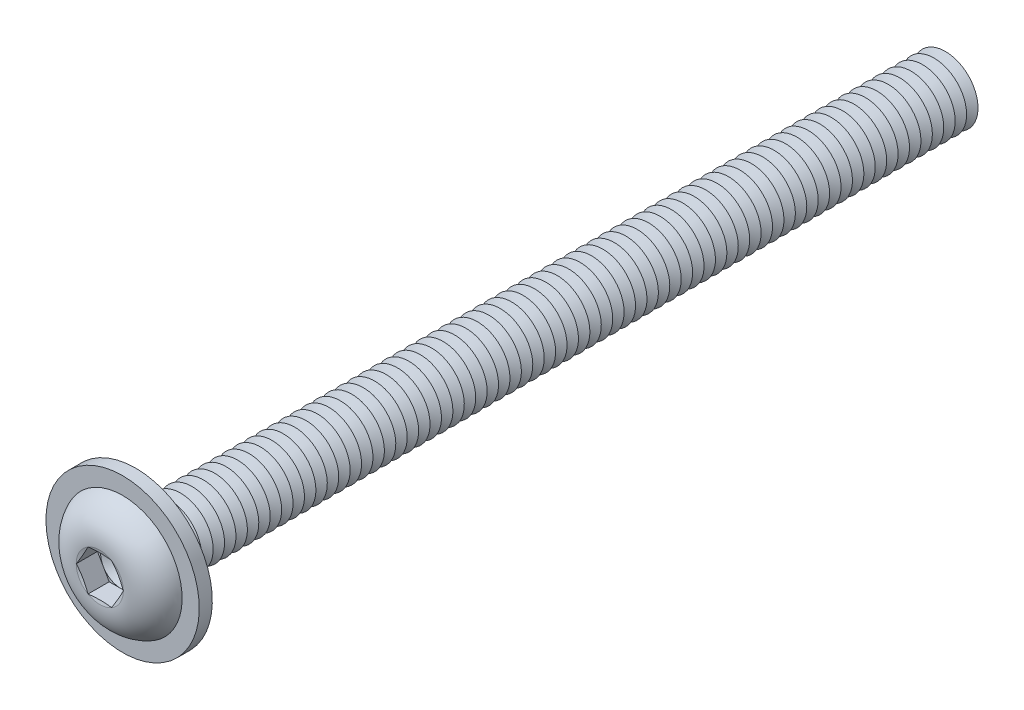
ISO-10303-21;
HEADER;
FILE_DESCRIPTION(('STEP AP214'),'2;1');
FILE_NAME('part.step','',(''),(''),'','','');
FILE_SCHEMA(('AUTOMOTIVE_DESIGN { 1 0 10303 214 1 1 1 1 }'));
ENDSEC;
DATA;
#1=APPLICATION_CONTEXT('core data for automotive mechanical design processes');
#2=APPLICATION_PROTOCOL_DEFINITION('international standard','automotive_design',2000,#1);
#3=PRODUCT_CONTEXT('',#1,'mechanical');
#4=PRODUCT('Part','Part','',(#3));
#5=PRODUCT_RELATED_PRODUCT_CATEGORY('part','',(#4));
#6=PRODUCT_DEFINITION_FORMATION('','',#4);
#7=PRODUCT_DEFINITION_CONTEXT('part definition',#1,'design');
#8=PRODUCT_DEFINITION('design','',#6,#7);
#9=PRODUCT_DEFINITION_SHAPE('','',#8);
#10=(LENGTH_UNIT() NAMED_UNIT(*) SI_UNIT(.MILLI.,.METRE.));
#11=(NAMED_UNIT(*) PLANE_ANGLE_UNIT() SI_UNIT($,.RADIAN.));
#12=(NAMED_UNIT(*) SI_UNIT($,.STERADIAN.) SOLID_ANGLE_UNIT());
#13=UNCERTAINTY_MEASURE_WITH_UNIT(LENGTH_MEASURE(1.E-05),#10,'distance_accuracy_value','');
#14=(GEOMETRIC_REPRESENTATION_CONTEXT(3) GLOBAL_UNCERTAINTY_ASSIGNED_CONTEXT((#13)) GLOBAL_UNIT_ASSIGNED_CONTEXT((#10,
#11,#12)) REPRESENTATION_CONTEXT('',''));
#15=CARTESIAN_POINT('',(0.,0.,0.));
#16=DIRECTION('',(0.,0.,1.));
#17=DIRECTION('',(1.,0.,0.));
#18=AXIS2_PLACEMENT_3D('',#15,#16,#17);
#19=CARTESIAN_POINT('',(0.,0.,-47.55));
#20=DIRECTION('',(0.,0.,1.));
#21=DIRECTION('',(0.,-1.,0.));
#22=AXIS2_PLACEMENT_3D('',#19,#20,#21);
#23=CONICAL_SURFACE('',#22,1.99999999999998,1.04719755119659);
#24=CARTESIAN_POINT('',(0.,0.,-47.9));
#25=DIRECTION('',(0.,0.,1.));
#26=DIRECTION('',(0.,-1.,0.));
#27=AXIS2_PLACEMENT_3D('',#24,#25,#26);
#28=CIRCLE('',#27,1.39378221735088);
#29=CARTESIAN_POINT('',(0.,-1.39378221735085,-47.9));
#30=VERTEX_POINT('',#29);
#31=EDGE_CURVE('E777',#30,#30,#28,.T.);
#32=ORIENTED_EDGE('',*,*,#31,.T.);
#33=EDGE_LOOP('',(#32));
#34=FACE_BOUND('',#33,.T.);
#35=CARTESIAN_POINT('',(0.,0.,-47.55));
#36=DIRECTION('',(0.,0.,1.));
#37=DIRECTION('',(0.,-1.,0.));
#38=AXIS2_PLACEMENT_3D('',#35,#36,#37);
#39=CIRCLE('',#38,1.99999999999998);
#40=CARTESIAN_POINT('',(0.,-1.99999999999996,-47.55));
#41=VERTEX_POINT('',#40);
#42=EDGE_CURVE('E773',#41,#41,#39,.T.);
#43=ORIENTED_EDGE('',*,*,#42,.F.);
#44=EDGE_LOOP('',(#43));
#45=FACE_BOUND('',#44,.T.);
#46=ADVANCED_FACE('F39',(#34,#45),#23,.T.);
#47=CARTESIAN_POINT('',(0.,0.,-47.9));
#48=DIRECTION('',(0.,0.,-1.));
#49=DIRECTION('',(0.,1.,0.));
#50=AXIS2_PLACEMENT_3D('',#47,#48,#49);
#51=CONICAL_SURFACE('',#50,1.39378221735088,1.0471975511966);
#52=CARTESIAN_POINT('',(0.,0.,-48.25));
#53=DIRECTION('',(0.,0.,1.));
#54=DIRECTION('',(0.,-1.,0.));
#55=AXIS2_PLACEMENT_3D('',#52,#53,#54);
#56=CIRCLE('',#55,1.99999999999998);
#57=CARTESIAN_POINT('',(0.,-1.99999999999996,-48.25));
#58=VERTEX_POINT('',#57);
#59=EDGE_CURVE('E781',#58,#58,#56,.T.);
#60=ORIENTED_EDGE('',*,*,#59,.T.);
#61=EDGE_LOOP('',(#60));
#62=FACE_BOUND('',#61,.T.);
#63=ORIENTED_EDGE('',*,*,#31,.F.);
#64=EDGE_LOOP('',(#63));
#65=FACE_BOUND('',#64,.T.);
#66=ADVANCED_FACE('F902',(#62,#65),#51,.T.);
#67=CARTESIAN_POINT('',(0.,1.99999999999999,-50.));
#68=DIRECTION('',(0.,0.,-1.));
#69=DIRECTION('',(0.,1.,0.));
#70=AXIS2_PLACEMENT_3D('',#67,#68,#69);
#71=PLANE('',#70);
#72=CARTESIAN_POINT('',(0.,0.,-50.));
#73=DIRECTION('',(0.,0.,1.));
#74=DIRECTION('',(0.,-1.,0.));
#75=AXIS2_PLACEMENT_3D('',#72,#73,#74);
#76=CIRCLE('',#75,1.39378221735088);
#77=CARTESIAN_POINT('',(0.,-1.39378221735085,-50.));
#78=VERTEX_POINT('',#77);
#79=EDGE_CURVE('E801',#78,#78,#76,.T.);
#80=ORIENTED_EDGE('',*,*,#79,.F.);
#81=EDGE_LOOP('',(#80));
#82=FACE_BOUND('',#81,.T.);
#83=ADVANCED_FACE('F908',(#82),#71,.T.);
#84=CARTESIAN_POINT('',(0.,0.,-49.65));
#85=DIRECTION('',(0.,0.,1.));
#86=DIRECTION('',(0.,-1.,0.));
#87=AXIS2_PLACEMENT_3D('',#84,#85,#86);
#88=CONICAL_SURFACE('',#87,1.99999999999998,1.04719755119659);
#89=ORIENTED_EDGE('',*,*,#79,.T.);
#90=EDGE_LOOP('',(#89));
#91=FACE_BOUND('',#90,.T.);
#92=CARTESIAN_POINT('',(0.,0.,-49.65));
#93=DIRECTION('',(0.,0.,1.));
#94=DIRECTION('',(0.,-1.,0.));
#95=AXIS2_PLACEMENT_3D('',#92,#93,#94);
#96=CIRCLE('',#95,1.99999999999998);
#97=CARTESIAN_POINT('',(0.,-1.99999999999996,-49.65));
#98=VERTEX_POINT('',#97);
#99=EDGE_CURVE('E797',#98,#98,#96,.T.);
#100=ORIENTED_EDGE('',*,*,#99,.F.);
#101=EDGE_LOOP('',(#100));
#102=FACE_BOUND('',#101,.T.);
#103=ADVANCED_FACE('F927',(#91,#102),#88,.T.);
#104=CARTESIAN_POINT('',(0.,0.,-49.3));
#105=DIRECTION('',(0.,0.,-1.));
#106=DIRECTION('',(0.,1.,0.));
#107=AXIS2_PLACEMENT_3D('',#104,#105,#106);
#108=CONICAL_SURFACE('',#107,1.39378221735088,1.0471975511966);
#109=ORIENTED_EDGE('',*,*,#99,.T.);
#110=EDGE_LOOP('',(#109));
#111=FACE_BOUND('',#110,.T.);
#112=CARTESIAN_POINT('',(0.,0.,-49.3));
#113=DIRECTION('',(0.,0.,1.));
#114=DIRECTION('',(0.,-1.,0.));
#115=AXIS2_PLACEMENT_3D('',#112,#113,#114);
#116=CIRCLE('',#115,1.39378221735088);
#117=CARTESIAN_POINT('',(0.,-1.39378221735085,-49.3));
#118=VERTEX_POINT('',#117);
#119=EDGE_CURVE('E793',#118,#118,#116,.T.);
#120=ORIENTED_EDGE('',*,*,#119,.F.);
#121=EDGE_LOOP('',(#120));
#122=FACE_BOUND('',#121,.T.);
#123=ADVANCED_FACE('F924',(#111,#122),#108,.T.);
#124=CARTESIAN_POINT('',(0.,0.,-48.95));
#125=DIRECTION('',(0.,0.,1.));
#126=DIRECTION('',(0.,-1.,0.));
#127=AXIS2_PLACEMENT_3D('',#124,#125,#126);
#128=CONICAL_SURFACE('',#127,1.99999999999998,1.04719755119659);
#129=ORIENTED_EDGE('',*,*,#119,.T.);
#130=EDGE_LOOP('',(#129));
#131=FACE_BOUND('',#130,.T.);
#132=CARTESIAN_POINT('',(0.,0.,-48.95));
#133=DIRECTION('',(0.,0.,1.));
#134=DIRECTION('',(0.,-1.,0.));
#135=AXIS2_PLACEMENT_3D('',#132,#133,#134);
#136=CIRCLE('',#135,1.99999999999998);
#137=CARTESIAN_POINT('',(0.,-1.99999999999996,-48.95));
#138=VERTEX_POINT('',#137);
#139=EDGE_CURVE('E789',#138,#138,#136,.T.);
#140=ORIENTED_EDGE('',*,*,#139,.F.);
#141=EDGE_LOOP('',(#140));
#142=FACE_BOUND('',#141,.T.);
#143=ADVANCED_FACE('F918',(#131,#142),#128,.T.);
#144=CARTESIAN_POINT('',(0.,0.,-48.6));
#145=DIRECTION('',(0.,0.,-1.));
#146=DIRECTION('',(0.,1.,0.));
#147=AXIS2_PLACEMENT_3D('',#144,#145,#146);
#148=CONICAL_SURFACE('',#147,1.39378221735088,1.0471975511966);
#149=ORIENTED_EDGE('',*,*,#139,.T.);
#150=EDGE_LOOP('',(#149));
#151=FACE_BOUND('',#150,.T.);
#152=CARTESIAN_POINT('',(0.,0.,-48.6));
#153=DIRECTION('',(0.,0.,1.));
#154=DIRECTION('',(0.,-1.,0.));
#155=AXIS2_PLACEMENT_3D('',#152,#153,#154);
#156=CIRCLE('',#155,1.39378221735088);
#157=CARTESIAN_POINT('',(0.,-1.39378221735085,-48.6));
#158=VERTEX_POINT('',#157);
#159=EDGE_CURVE('E785',#158,#158,#156,.T.);
#160=ORIENTED_EDGE('',*,*,#159,.F.);
#161=EDGE_LOOP('',(#160));
#162=FACE_BOUND('',#161,.T.);
#163=ADVANCED_FACE('F914',(#151,#162),#148,.T.);
#164=CARTESIAN_POINT('',(0.,0.,-48.25));
#165=DIRECTION('',(0.,0.,1.));
#166=DIRECTION('',(0.,-1.,0.));
#167=AXIS2_PLACEMENT_3D('',#164,#165,#166);
#168=CONICAL_SURFACE('',#167,1.99999999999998,1.04719755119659);
#169=ORIENTED_EDGE('',*,*,#159,.T.);
#170=EDGE_LOOP('',(#169));
#171=FACE_BOUND('',#170,.T.);
#172=ORIENTED_EDGE('',*,*,#59,.F.);
#173=EDGE_LOOP('',(#172));
#174=FACE_BOUND('',#173,.T.);
#175=ADVANCED_FACE('F917',(#171,#174),#168,.T.);
#176=CARTESIAN_POINT('',(0.,0.,-46.85));
#177=DIRECTION('',(0.,0.,1.));
#178=DIRECTION('',(0.,-1.,0.));
#179=AXIS2_PLACEMENT_3D('',#176,#177,#178);
#180=CONICAL_SURFACE('',#179,1.99999999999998,1.04719755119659);
#181=CARTESIAN_POINT('',(0.,0.,-47.2));
#182=DIRECTION('',(0.,0.,1.));
#183=DIRECTION('',(0.,-1.,0.));
#184=AXIS2_PLACEMENT_3D('',#181,#182,#183);
#185=CIRCLE('',#184,1.39378221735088);
#186=CARTESIAN_POINT('',(0.,-1.39378221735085,-47.2));
#187=VERTEX_POINT('',#186);
#188=EDGE_CURVE('E769',#187,#187,#185,.T.);
#189=ORIENTED_EDGE('',*,*,#188,.T.);
#190=EDGE_LOOP('',(#189));
#191=FACE_BOUND('',#190,.T.);
#192=CARTESIAN_POINT('',(0.,0.,-46.85));
#193=DIRECTION('',(0.,0.,1.));
#194=DIRECTION('',(0.,-1.,0.));
#195=AXIS2_PLACEMENT_3D('',#192,#193,#194);
#196=CIRCLE('',#195,1.99999999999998);
#197=CARTESIAN_POINT('',(0.,-1.99999999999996,-46.85));
#198=VERTEX_POINT('',#197);
#199=EDGE_CURVE('E765',#198,#198,#196,.T.);
#200=ORIENTED_EDGE('',*,*,#199,.F.);
#201=EDGE_LOOP('',(#200));
#202=FACE_BOUND('',#201,.T.);
#203=ADVANCED_FACE('F922',(#191,#202),#180,.T.);
#204=CARTESIAN_POINT('',(0.,0.,-47.2));
#205=DIRECTION('',(0.,0.,-1.));
#206=DIRECTION('',(0.,1.,0.));
#207=AXIS2_PLACEMENT_3D('',#204,#205,#206);
#208=CONICAL_SURFACE('',#207,1.39378221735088,1.0471975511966);
#209=ORIENTED_EDGE('',*,*,#42,.T.);
#210=EDGE_LOOP('',(#209));
#211=FACE_BOUND('',#210,.T.);
#212=ORIENTED_EDGE('',*,*,#188,.F.);
#213=EDGE_LOOP('',(#212));
#214=FACE_BOUND('',#213,.T.);
#215=ADVANCED_FACE('F973',(#211,#214),#208,.T.);
#216=CARTESIAN_POINT('',(0.,0.,-46.15));
#217=DIRECTION('',(0.,0.,1.));
#218=DIRECTION('',(0.,-1.,0.));
#219=AXIS2_PLACEMENT_3D('',#216,#217,#218);
#220=CONICAL_SURFACE('',#219,1.99999999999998,1.04719755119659);
#221=CARTESIAN_POINT('',(0.,0.,-46.5));
#222=DIRECTION('',(0.,0.,1.));
#223=DIRECTION('',(0.,-1.,0.));
#224=AXIS2_PLACEMENT_3D('',#221,#222,#223);
#225=CIRCLE('',#224,1.39378221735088);
#226=CARTESIAN_POINT('',(0.,-1.39378221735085,-46.5));
#227=VERTEX_POINT('',#226);
#228=EDGE_CURVE('E761',#227,#227,#225,.T.);
#229=ORIENTED_EDGE('',*,*,#228,.T.);
#230=EDGE_LOOP('',(#229));
#231=FACE_BOUND('',#230,.T.);
#232=CARTESIAN_POINT('',(0.,0.,-46.15));
#233=DIRECTION('',(0.,0.,1.));
#234=DIRECTION('',(0.,-1.,0.));
#235=AXIS2_PLACEMENT_3D('',#232,#233,#234);
#236=CIRCLE('',#235,1.99999999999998);
#237=CARTESIAN_POINT('',(0.,-1.99999999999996,-46.15));
#238=VERTEX_POINT('',#237);
#239=EDGE_CURVE('E757',#238,#238,#236,.T.);
#240=ORIENTED_EDGE('',*,*,#239,.F.);
#241=EDGE_LOOP('',(#240));
#242=FACE_BOUND('',#241,.T.);
#243=ADVANCED_FACE('F979',(#231,#242),#220,.T.);
#244=CARTESIAN_POINT('',(0.,0.,-46.5));
#245=DIRECTION('',(0.,0.,-1.));
#246=DIRECTION('',(0.,1.,0.));
#247=AXIS2_PLACEMENT_3D('',#244,#245,#246);
#248=CONICAL_SURFACE('',#247,1.39378221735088,1.0471975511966);
#249=ORIENTED_EDGE('',*,*,#199,.T.);
#250=EDGE_LOOP('',(#249));
#251=FACE_BOUND('',#250,.T.);
#252=ORIENTED_EDGE('',*,*,#228,.F.);
#253=EDGE_LOOP('',(#252));
#254=FACE_BOUND('',#253,.T.);
#255=ADVANCED_FACE('F986',(#251,#254),#248,.T.);
#256=CARTESIAN_POINT('',(0.,0.,-45.45));
#257=DIRECTION('',(0.,0.,1.));
#258=DIRECTION('',(0.,-1.,0.));
#259=AXIS2_PLACEMENT_3D('',#256,#257,#258);
#260=CONICAL_SURFACE('',#259,1.99999999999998,1.04719755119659);
#261=CARTESIAN_POINT('',(0.,0.,-45.8));
#262=DIRECTION('',(0.,0.,1.));
#263=DIRECTION('',(0.,-1.,0.));
#264=AXIS2_PLACEMENT_3D('',#261,#262,#263);
#265=CIRCLE('',#264,1.39378221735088);
#266=CARTESIAN_POINT('',(0.,-1.39378221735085,-45.8));
#267=VERTEX_POINT('',#266);
#268=EDGE_CURVE('E753',#267,#267,#265,.T.);
#269=ORIENTED_EDGE('',*,*,#268,.T.);
#270=EDGE_LOOP('',(#269));
#271=FACE_BOUND('',#270,.T.);
#272=CARTESIAN_POINT('',(0.,0.,-45.45));
#273=DIRECTION('',(0.,0.,1.));
#274=DIRECTION('',(0.,-1.,0.));
#275=AXIS2_PLACEMENT_3D('',#272,#273,#274);
#276=CIRCLE('',#275,1.99999999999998);
#277=CARTESIAN_POINT('',(0.,-1.99999999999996,-45.45));
#278=VERTEX_POINT('',#277);
#279=EDGE_CURVE('E749',#278,#278,#276,.T.);
#280=ORIENTED_EDGE('',*,*,#279,.F.);
#281=EDGE_LOOP('',(#280));
#282=FACE_BOUND('',#281,.T.);
#283=ADVANCED_FACE('F993',(#271,#282),#260,.T.);
#284=CARTESIAN_POINT('',(0.,0.,-45.8));
#285=DIRECTION('',(0.,0.,-1.));
#286=DIRECTION('',(0.,1.,0.));
#287=AXIS2_PLACEMENT_3D('',#284,#285,#286);
#288=CONICAL_SURFACE('',#287,1.39378221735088,1.0471975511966);
#289=ORIENTED_EDGE('',*,*,#239,.T.);
#290=EDGE_LOOP('',(#289));
#291=FACE_BOUND('',#290,.T.);
#292=ORIENTED_EDGE('',*,*,#268,.F.);
#293=EDGE_LOOP('',(#292));
#294=FACE_BOUND('',#293,.T.);
#295=ADVANCED_FACE('F1000',(#291,#294),#288,.T.);
#296=CARTESIAN_POINT('',(0.,0.,-44.75));
#297=DIRECTION('',(0.,0.,1.));
#298=DIRECTION('',(0.,-1.,0.));
#299=AXIS2_PLACEMENT_3D('',#296,#297,#298);
#300=CONICAL_SURFACE('',#299,1.99999999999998,1.04719755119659);
#301=CARTESIAN_POINT('',(0.,0.,-45.1));
#302=DIRECTION('',(0.,0.,1.));
#303=DIRECTION('',(0.,-1.,0.));
#304=AXIS2_PLACEMENT_3D('',#301,#302,#303);
#305=CIRCLE('',#304,1.39378221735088);
#306=CARTESIAN_POINT('',(0.,-1.39378221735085,-45.1));
#307=VERTEX_POINT('',#306);
#308=EDGE_CURVE('E745',#307,#307,#305,.T.);
#309=ORIENTED_EDGE('',*,*,#308,.T.);
#310=EDGE_LOOP('',(#309));
#311=FACE_BOUND('',#310,.T.);
#312=CARTESIAN_POINT('',(0.,0.,-44.75));
#313=DIRECTION('',(0.,0.,1.));
#314=DIRECTION('',(0.,-1.,0.));
#315=AXIS2_PLACEMENT_3D('',#312,#313,#314);
#316=CIRCLE('',#315,1.99999999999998);
#317=CARTESIAN_POINT('',(0.,-1.99999999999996,-44.75));
#318=VERTEX_POINT('',#317);
#319=EDGE_CURVE('E741',#318,#318,#316,.T.);
#320=ORIENTED_EDGE('',*,*,#319,.F.);
#321=EDGE_LOOP('',(#320));
#322=FACE_BOUND('',#321,.T.);
#323=ADVANCED_FACE('F1007',(#311,#322),#300,.T.);
#324=CARTESIAN_POINT('',(0.,0.,-45.1));
#325=DIRECTION('',(0.,0.,-1.));
#326=DIRECTION('',(0.,1.,0.));
#327=AXIS2_PLACEMENT_3D('',#324,#325,#326);
#328=CONICAL_SURFACE('',#327,1.39378221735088,1.0471975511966);
#329=ORIENTED_EDGE('',*,*,#279,.T.);
#330=EDGE_LOOP('',(#329));
#331=FACE_BOUND('',#330,.T.);
#332=ORIENTED_EDGE('',*,*,#308,.F.);
#333=EDGE_LOOP('',(#332));
#334=FACE_BOUND('',#333,.T.);
#335=ADVANCED_FACE('F1014',(#331,#334),#328,.T.);
#336=CARTESIAN_POINT('',(0.,0.,-44.05));
#337=DIRECTION('',(0.,0.,1.));
#338=DIRECTION('',(0.,-1.,0.));
#339=AXIS2_PLACEMENT_3D('',#336,#337,#338);
#340=CONICAL_SURFACE('',#339,1.99999999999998,1.04719755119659);
#341=CARTESIAN_POINT('',(0.,0.,-44.4));
#342=DIRECTION('',(0.,0.,1.));
#343=DIRECTION('',(0.,-1.,0.));
#344=AXIS2_PLACEMENT_3D('',#341,#342,#343);
#345=CIRCLE('',#344,1.39378221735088);
#346=CARTESIAN_POINT('',(0.,-1.39378221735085,-44.4));
#347=VERTEX_POINT('',#346);
#348=EDGE_CURVE('E737',#347,#347,#345,.T.);
#349=ORIENTED_EDGE('',*,*,#348,.T.);
#350=EDGE_LOOP('',(#349));
#351=FACE_BOUND('',#350,.T.);
#352=CARTESIAN_POINT('',(0.,0.,-44.05));
#353=DIRECTION('',(0.,0.,1.));
#354=DIRECTION('',(0.,-1.,0.));
#355=AXIS2_PLACEMENT_3D('',#352,#353,#354);
#356=CIRCLE('',#355,1.99999999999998);
#357=CARTESIAN_POINT('',(0.,-1.99999999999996,-44.05));
#358=VERTEX_POINT('',#357);
#359=EDGE_CURVE('E733',#358,#358,#356,.T.);
#360=ORIENTED_EDGE('',*,*,#359,.F.);
#361=EDGE_LOOP('',(#360));
#362=FACE_BOUND('',#361,.T.);
#363=ADVANCED_FACE('F1021',(#351,#362),#340,.T.);
#364=CARTESIAN_POINT('',(0.,0.,-44.4));
#365=DIRECTION('',(0.,0.,-1.));
#366=DIRECTION('',(0.,1.,0.));
#367=AXIS2_PLACEMENT_3D('',#364,#365,#366);
#368=CONICAL_SURFACE('',#367,1.39378221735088,1.0471975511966);
#369=ORIENTED_EDGE('',*,*,#319,.T.);
#370=EDGE_LOOP('',(#369));
#371=FACE_BOUND('',#370,.T.);
#372=ORIENTED_EDGE('',*,*,#348,.F.);
#373=EDGE_LOOP('',(#372));
#374=FACE_BOUND('',#373,.T.);
#375=ADVANCED_FACE('F1028',(#371,#374),#368,.T.);
#376=CARTESIAN_POINT('',(0.,0.,-43.35));
#377=DIRECTION('',(0.,0.,1.));
#378=DIRECTION('',(0.,-1.,0.));
#379=AXIS2_PLACEMENT_3D('',#376,#377,#378);
#380=CONICAL_SURFACE('',#379,1.99999999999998,1.04719755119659);
#381=CARTESIAN_POINT('',(0.,0.,-43.7));
#382=DIRECTION('',(0.,0.,1.));
#383=DIRECTION('',(0.,-1.,0.));
#384=AXIS2_PLACEMENT_3D('',#381,#382,#383);
#385=CIRCLE('',#384,1.39378221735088);
#386=CARTESIAN_POINT('',(0.,-1.39378221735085,-43.7));
#387=VERTEX_POINT('',#386);
#388=EDGE_CURVE('E729',#387,#387,#385,.T.);
#389=ORIENTED_EDGE('',*,*,#388,.T.);
#390=EDGE_LOOP('',(#389));
#391=FACE_BOUND('',#390,.T.);
#392=CARTESIAN_POINT('',(0.,0.,-43.35));
#393=DIRECTION('',(0.,0.,1.));
#394=DIRECTION('',(0.,-1.,0.));
#395=AXIS2_PLACEMENT_3D('',#392,#393,#394);
#396=CIRCLE('',#395,1.99999999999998);
#397=CARTESIAN_POINT('',(0.,-1.99999999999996,-43.35));
#398=VERTEX_POINT('',#397);
#399=EDGE_CURVE('E725',#398,#398,#396,.T.);
#400=ORIENTED_EDGE('',*,*,#399,.F.);
#401=EDGE_LOOP('',(#400));
#402=FACE_BOUND('',#401,.T.);
#403=ADVANCED_FACE('F1035',(#391,#402),#380,.T.);
#404=CARTESIAN_POINT('',(0.,0.,-43.7));
#405=DIRECTION('',(0.,0.,-1.));
#406=DIRECTION('',(0.,1.,0.));
#407=AXIS2_PLACEMENT_3D('',#404,#405,#406);
#408=CONICAL_SURFACE('',#407,1.39378221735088,1.0471975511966);
#409=ORIENTED_EDGE('',*,*,#359,.T.);
#410=EDGE_LOOP('',(#409));
#411=FACE_BOUND('',#410,.T.);
#412=ORIENTED_EDGE('',*,*,#388,.F.);
#413=EDGE_LOOP('',(#412));
#414=FACE_BOUND('',#413,.T.);
#415=ADVANCED_FACE('F1042',(#411,#414),#408,.T.);
#416=CARTESIAN_POINT('',(0.,0.,-42.65));
#417=DIRECTION('',(0.,0.,1.));
#418=DIRECTION('',(0.,-1.,0.));
#419=AXIS2_PLACEMENT_3D('',#416,#417,#418);
#420=CONICAL_SURFACE('',#419,1.99999999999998,1.04719755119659);
#421=CARTESIAN_POINT('',(0.,0.,-43.));
#422=DIRECTION('',(0.,0.,1.));
#423=DIRECTION('',(0.,-1.,0.));
#424=AXIS2_PLACEMENT_3D('',#421,#422,#423);
#425=CIRCLE('',#424,1.39378221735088);
#426=CARTESIAN_POINT('',(0.,-1.39378221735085,-43.));
#427=VERTEX_POINT('',#426);
#428=EDGE_CURVE('E721',#427,#427,#425,.T.);
#429=ORIENTED_EDGE('',*,*,#428,.T.);
#430=EDGE_LOOP('',(#429));
#431=FACE_BOUND('',#430,.T.);
#432=CARTESIAN_POINT('',(0.,0.,-42.65));
#433=DIRECTION('',(0.,0.,1.));
#434=DIRECTION('',(0.,-1.,0.));
#435=AXIS2_PLACEMENT_3D('',#432,#433,#434);
#436=CIRCLE('',#435,1.99999999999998);
#437=CARTESIAN_POINT('',(0.,-1.99999999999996,-42.65));
#438=VERTEX_POINT('',#437);
#439=EDGE_CURVE('E717',#438,#438,#436,.T.);
#440=ORIENTED_EDGE('',*,*,#439,.F.);
#441=EDGE_LOOP('',(#440));
#442=FACE_BOUND('',#441,.T.);
#443=ADVANCED_FACE('F1049',(#431,#442),#420,.T.);
#444=CARTESIAN_POINT('',(0.,0.,-43.));
#445=DIRECTION('',(0.,0.,-1.));
#446=DIRECTION('',(0.,1.,0.));
#447=AXIS2_PLACEMENT_3D('',#444,#445,#446);
#448=CONICAL_SURFACE('',#447,1.39378221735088,1.0471975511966);
#449=ORIENTED_EDGE('',*,*,#399,.T.);
#450=EDGE_LOOP('',(#449));
#451=FACE_BOUND('',#450,.T.);
#452=ORIENTED_EDGE('',*,*,#428,.F.);
#453=EDGE_LOOP('',(#452));
#454=FACE_BOUND('',#453,.T.);
#455=ADVANCED_FACE('F1056',(#451,#454),#448,.T.);
#456=CARTESIAN_POINT('',(0.,0.,-41.95));
#457=DIRECTION('',(0.,0.,1.));
#458=DIRECTION('',(0.,-1.,0.));
#459=AXIS2_PLACEMENT_3D('',#456,#457,#458);
#460=CONICAL_SURFACE('',#459,1.99999999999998,1.04719755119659);
#461=CARTESIAN_POINT('',(0.,0.,-42.3));
#462=DIRECTION('',(0.,0.,1.));
#463=DIRECTION('',(0.,-1.,0.));
#464=AXIS2_PLACEMENT_3D('',#461,#462,#463);
#465=CIRCLE('',#464,1.39378221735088);
#466=CARTESIAN_POINT('',(0.,-1.39378221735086,-42.3));
#467=VERTEX_POINT('',#466);
#468=EDGE_CURVE('E714',#467,#467,#465,.T.);
#469=ORIENTED_EDGE('',*,*,#468,.T.);
#470=EDGE_LOOP('',(#469));
#471=FACE_BOUND('',#470,.T.);
#472=CARTESIAN_POINT('',(0.,0.,-41.95));
#473=DIRECTION('',(0.,0.,1.));
#474=DIRECTION('',(0.,-1.,0.));
#475=AXIS2_PLACEMENT_3D('',#472,#473,#474);
#476=CIRCLE('',#475,1.99999999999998);
#477=CARTESIAN_POINT('',(0.,-1.99999999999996,-41.95));
#478=VERTEX_POINT('',#477);
#479=EDGE_CURVE('E710',#478,#478,#476,.T.);
#480=ORIENTED_EDGE('',*,*,#479,.F.);
#481=EDGE_LOOP('',(#480));
#482=FACE_BOUND('',#481,.T.);
#483=ADVANCED_FACE('F1063',(#471,#482),#460,.T.);
#484=CARTESIAN_POINT('',(0.,0.,-42.3));
#485=DIRECTION('',(0.,0.,-1.));
#486=DIRECTION('',(0.,1.,0.));
#487=AXIS2_PLACEMENT_3D('',#484,#485,#486);
#488=CONICAL_SURFACE('',#487,1.39378221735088,1.0471975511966);
#489=ORIENTED_EDGE('',*,*,#439,.T.);
#490=EDGE_LOOP('',(#489));
#491=FACE_BOUND('',#490,.T.);
#492=ORIENTED_EDGE('',*,*,#468,.F.);
#493=EDGE_LOOP('',(#492));
#494=FACE_BOUND('',#493,.T.);
#495=ADVANCED_FACE('F1070',(#491,#494),#488,.T.);
#496=CARTESIAN_POINT('',(0.,0.,-41.25));
#497=DIRECTION('',(0.,0.,1.));
#498=DIRECTION('',(0.,-1.,0.));
#499=AXIS2_PLACEMENT_3D('',#496,#497,#498);
#500=CONICAL_SURFACE('',#499,1.99999999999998,1.04719755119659);
#501=CARTESIAN_POINT('',(0.,0.,-41.6));
#502=DIRECTION('',(0.,0.,1.));
#503=DIRECTION('',(0.,-1.,0.));
#504=AXIS2_PLACEMENT_3D('',#501,#502,#503);
#505=CIRCLE('',#504,1.39378221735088);
#506=CARTESIAN_POINT('',(0.,-1.39378221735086,-41.6));
#507=VERTEX_POINT('',#506);
#508=EDGE_CURVE('E706',#507,#507,#505,.T.);
#509=ORIENTED_EDGE('',*,*,#508,.T.);
#510=EDGE_LOOP('',(#509));
#511=FACE_BOUND('',#510,.T.);
#512=CARTESIAN_POINT('',(0.,0.,-41.25));
#513=DIRECTION('',(0.,0.,1.));
#514=DIRECTION('',(0.,-1.,0.));
#515=AXIS2_PLACEMENT_3D('',#512,#513,#514);
#516=CIRCLE('',#515,1.99999999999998);
#517=CARTESIAN_POINT('',(0.,-1.99999999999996,-41.25));
#518=VERTEX_POINT('',#517);
#519=EDGE_CURVE('E702',#518,#518,#516,.T.);
#520=ORIENTED_EDGE('',*,*,#519,.F.);
#521=EDGE_LOOP('',(#520));
#522=FACE_BOUND('',#521,.T.);
#523=ADVANCED_FACE('F1077',(#511,#522),#500,.T.);
#524=CARTESIAN_POINT('',(0.,0.,-41.6));
#525=DIRECTION('',(0.,0.,-1.));
#526=DIRECTION('',(0.,1.,0.));
#527=AXIS2_PLACEMENT_3D('',#524,#525,#526);
#528=CONICAL_SURFACE('',#527,1.39378221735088,1.0471975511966);
#529=ORIENTED_EDGE('',*,*,#479,.T.);
#530=EDGE_LOOP('',(#529));
#531=FACE_BOUND('',#530,.T.);
#532=ORIENTED_EDGE('',*,*,#508,.F.);
#533=EDGE_LOOP('',(#532));
#534=FACE_BOUND('',#533,.T.);
#535=ADVANCED_FACE('F1084',(#531,#534),#528,.T.);
#536=CARTESIAN_POINT('',(0.,0.,-40.55));
#537=DIRECTION('',(0.,0.,1.));
#538=DIRECTION('',(0.,-1.,0.));
#539=AXIS2_PLACEMENT_3D('',#536,#537,#538);
#540=CONICAL_SURFACE('',#539,1.99999999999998,1.04719755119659);
#541=CARTESIAN_POINT('',(0.,0.,-40.9));
#542=DIRECTION('',(0.,0.,1.));
#543=DIRECTION('',(0.,-1.,0.));
#544=AXIS2_PLACEMENT_3D('',#541,#542,#543);
#545=CIRCLE('',#544,1.39378221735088);
#546=CARTESIAN_POINT('',(0.,-1.39378221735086,-40.9));
#547=VERTEX_POINT('',#546);
#548=EDGE_CURVE('E698',#547,#547,#545,.T.);
#549=ORIENTED_EDGE('',*,*,#548,.T.);
#550=EDGE_LOOP('',(#549));
#551=FACE_BOUND('',#550,.T.);
#552=CARTESIAN_POINT('',(0.,0.,-40.55));
#553=DIRECTION('',(0.,0.,1.));
#554=DIRECTION('',(0.,-1.,0.));
#555=AXIS2_PLACEMENT_3D('',#552,#553,#554);
#556=CIRCLE('',#555,1.99999999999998);
#557=CARTESIAN_POINT('',(0.,-1.99999999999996,-40.55));
#558=VERTEX_POINT('',#557);
#559=EDGE_CURVE('E694',#558,#558,#556,.T.);
#560=ORIENTED_EDGE('',*,*,#559,.F.);
#561=EDGE_LOOP('',(#560));
#562=FACE_BOUND('',#561,.T.);
#563=ADVANCED_FACE('F1091',(#551,#562),#540,.T.);
#564=CARTESIAN_POINT('',(0.,0.,-40.9));
#565=DIRECTION('',(0.,0.,-1.));
#566=DIRECTION('',(0.,1.,0.));
#567=AXIS2_PLACEMENT_3D('',#564,#565,#566);
#568=CONICAL_SURFACE('',#567,1.39378221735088,1.0471975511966);
#569=ORIENTED_EDGE('',*,*,#519,.T.);
#570=EDGE_LOOP('',(#569));
#571=FACE_BOUND('',#570,.T.);
#572=ORIENTED_EDGE('',*,*,#548,.F.);
#573=EDGE_LOOP('',(#572));
#574=FACE_BOUND('',#573,.T.);
#575=ADVANCED_FACE('F1098',(#571,#574),#568,.T.);
#576=CARTESIAN_POINT('',(0.,0.,-39.85));
#577=DIRECTION('',(0.,0.,1.));
#578=DIRECTION('',(0.,-1.,0.));
#579=AXIS2_PLACEMENT_3D('',#576,#577,#578);
#580=CONICAL_SURFACE('',#579,1.99999999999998,1.04719755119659);
#581=CARTESIAN_POINT('',(0.,0.,-40.2));
#582=DIRECTION('',(0.,0.,1.));
#583=DIRECTION('',(0.,-1.,0.));
#584=AXIS2_PLACEMENT_3D('',#581,#582,#583);
#585=CIRCLE('',#584,1.39378221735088);
#586=CARTESIAN_POINT('',(0.,-1.39378221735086,-40.2));
#587=VERTEX_POINT('',#586);
#588=EDGE_CURVE('E690',#587,#587,#585,.T.);
#589=ORIENTED_EDGE('',*,*,#588,.T.);
#590=EDGE_LOOP('',(#589));
#591=FACE_BOUND('',#590,.T.);
#592=CARTESIAN_POINT('',(0.,0.,-39.85));
#593=DIRECTION('',(0.,0.,1.));
#594=DIRECTION('',(0.,-1.,0.));
#595=AXIS2_PLACEMENT_3D('',#592,#593,#594);
#596=CIRCLE('',#595,1.99999999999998);
#597=CARTESIAN_POINT('',(0.,-1.99999999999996,-39.85));
#598=VERTEX_POINT('',#597);
#599=EDGE_CURVE('E686',#598,#598,#596,.T.);
#600=ORIENTED_EDGE('',*,*,#599,.F.);
#601=EDGE_LOOP('',(#600));
#602=FACE_BOUND('',#601,.T.);
#603=ADVANCED_FACE('F1105',(#591,#602),#580,.T.);
#604=CARTESIAN_POINT('',(0.,0.,-40.2));
#605=DIRECTION('',(0.,0.,-1.));
#606=DIRECTION('',(0.,1.,0.));
#607=AXIS2_PLACEMENT_3D('',#604,#605,#606);
#608=CONICAL_SURFACE('',#607,1.39378221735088,1.0471975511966);
#609=ORIENTED_EDGE('',*,*,#559,.T.);
#610=EDGE_LOOP('',(#609));
#611=FACE_BOUND('',#610,.T.);
#612=ORIENTED_EDGE('',*,*,#588,.F.);
#613=EDGE_LOOP('',(#612));
#614=FACE_BOUND('',#613,.T.);
#615=ADVANCED_FACE('F1112',(#611,#614),#608,.T.);
#616=CARTESIAN_POINT('',(0.,0.,-39.15));
#617=DIRECTION('',(0.,0.,1.));
#618=DIRECTION('',(0.,-1.,0.));
#619=AXIS2_PLACEMENT_3D('',#616,#617,#618);
#620=CONICAL_SURFACE('',#619,1.99999999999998,1.04719755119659);
#621=CARTESIAN_POINT('',(0.,0.,-39.5));
#622=DIRECTION('',(0.,0.,1.));
#623=DIRECTION('',(0.,-1.,0.));
#624=AXIS2_PLACEMENT_3D('',#621,#622,#623);
#625=CIRCLE('',#624,1.39378221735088);
#626=CARTESIAN_POINT('',(0.,-1.39378221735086,-39.5));
#627=VERTEX_POINT('',#626);
#628=EDGE_CURVE('E682',#627,#627,#625,.T.);
#629=ORIENTED_EDGE('',*,*,#628,.T.);
#630=EDGE_LOOP('',(#629));
#631=FACE_BOUND('',#630,.T.);
#632=CARTESIAN_POINT('',(0.,0.,-39.15));
#633=DIRECTION('',(0.,0.,1.));
#634=DIRECTION('',(0.,-1.,0.));
#635=AXIS2_PLACEMENT_3D('',#632,#633,#634);
#636=CIRCLE('',#635,1.99999999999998);
#637=CARTESIAN_POINT('',(0.,-1.99999999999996,-39.15));
#638=VERTEX_POINT('',#637);
#639=EDGE_CURVE('E678',#638,#638,#636,.T.);
#640=ORIENTED_EDGE('',*,*,#639,.F.);
#641=EDGE_LOOP('',(#640));
#642=FACE_BOUND('',#641,.T.);
#643=ADVANCED_FACE('F1119',(#631,#642),#620,.T.);
#644=CARTESIAN_POINT('',(0.,0.,-39.5));
#645=DIRECTION('',(0.,0.,-1.));
#646=DIRECTION('',(0.,1.,0.));
#647=AXIS2_PLACEMENT_3D('',#644,#645,#646);
#648=CONICAL_SURFACE('',#647,1.39378221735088,1.0471975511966);
#649=ORIENTED_EDGE('',*,*,#599,.T.);
#650=EDGE_LOOP('',(#649));
#651=FACE_BOUND('',#650,.T.);
#652=ORIENTED_EDGE('',*,*,#628,.F.);
#653=EDGE_LOOP('',(#652));
#654=FACE_BOUND('',#653,.T.);
#655=ADVANCED_FACE('F1126',(#651,#654),#648,.T.);
#656=CARTESIAN_POINT('',(0.,0.,-38.45));
#657=DIRECTION('',(0.,0.,1.));
#658=DIRECTION('',(0.,-1.,0.));
#659=AXIS2_PLACEMENT_3D('',#656,#657,#658);
#660=CONICAL_SURFACE('',#659,1.99999999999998,1.04719755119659);
#661=CARTESIAN_POINT('',(0.,0.,-38.8));
#662=DIRECTION('',(0.,0.,1.));
#663=DIRECTION('',(0.,-1.,0.));
#664=AXIS2_PLACEMENT_3D('',#661,#662,#663);
#665=CIRCLE('',#664,1.39378221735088);
#666=CARTESIAN_POINT('',(0.,-1.39378221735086,-38.8));
#667=VERTEX_POINT('',#666);
#668=EDGE_CURVE('E674',#667,#667,#665,.T.);
#669=ORIENTED_EDGE('',*,*,#668,.T.);
#670=EDGE_LOOP('',(#669));
#671=FACE_BOUND('',#670,.T.);
#672=CARTESIAN_POINT('',(0.,0.,-38.45));
#673=DIRECTION('',(0.,0.,1.));
#674=DIRECTION('',(0.,-1.,0.));
#675=AXIS2_PLACEMENT_3D('',#672,#673,#674);
#676=CIRCLE('',#675,1.99999999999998);
#677=CARTESIAN_POINT('',(0.,-1.99999999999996,-38.45));
#678=VERTEX_POINT('',#677);
#679=EDGE_CURVE('E670',#678,#678,#676,.T.);
#680=ORIENTED_EDGE('',*,*,#679,.F.);
#681=EDGE_LOOP('',(#680));
#682=FACE_BOUND('',#681,.T.);
#683=ADVANCED_FACE('F1133',(#671,#682),#660,.T.);
#684=CARTESIAN_POINT('',(0.,0.,-38.8));
#685=DIRECTION('',(0.,0.,-1.));
#686=DIRECTION('',(0.,1.,0.));
#687=AXIS2_PLACEMENT_3D('',#684,#685,#686);
#688=CONICAL_SURFACE('',#687,1.39378221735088,1.0471975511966);
#689=ORIENTED_EDGE('',*,*,#639,.T.);
#690=EDGE_LOOP('',(#689));
#691=FACE_BOUND('',#690,.T.);
#692=ORIENTED_EDGE('',*,*,#668,.F.);
#693=EDGE_LOOP('',(#692));
#694=FACE_BOUND('',#693,.T.);
#695=ADVANCED_FACE('F1140',(#691,#694),#688,.T.);
#696=CARTESIAN_POINT('',(0.,0.,-37.75));
#697=DIRECTION('',(0.,0.,1.));
#698=DIRECTION('',(0.,-1.,0.));
#699=AXIS2_PLACEMENT_3D('',#696,#697,#698);
#700=CONICAL_SURFACE('',#699,1.99999999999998,1.04719755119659);
#701=CARTESIAN_POINT('',(0.,0.,-38.1));
#702=DIRECTION('',(0.,0.,1.));
#703=DIRECTION('',(0.,-1.,0.));
#704=AXIS2_PLACEMENT_3D('',#701,#702,#703);
#705=CIRCLE('',#704,1.39378221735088);
#706=CARTESIAN_POINT('',(0.,-1.39378221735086,-38.1));
#707=VERTEX_POINT('',#706);
#708=EDGE_CURVE('E666',#707,#707,#705,.T.);
#709=ORIENTED_EDGE('',*,*,#708,.T.);
#710=EDGE_LOOP('',(#709));
#711=FACE_BOUND('',#710,.T.);
#712=CARTESIAN_POINT('',(0.,0.,-37.75));
#713=DIRECTION('',(0.,0.,1.));
#714=DIRECTION('',(0.,-1.,0.));
#715=AXIS2_PLACEMENT_3D('',#712,#713,#714);
#716=CIRCLE('',#715,1.99999999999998);
#717=CARTESIAN_POINT('',(0.,-1.99999999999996,-37.75));
#718=VERTEX_POINT('',#717);
#719=EDGE_CURVE('E662',#718,#718,#716,.T.);
#720=ORIENTED_EDGE('',*,*,#719,.F.);
#721=EDGE_LOOP('',(#720));
#722=FACE_BOUND('',#721,.T.);
#723=ADVANCED_FACE('F1147',(#711,#722),#700,.T.);
#724=CARTESIAN_POINT('',(0.,0.,-38.1));
#725=DIRECTION('',(0.,0.,-1.));
#726=DIRECTION('',(0.,1.,0.));
#727=AXIS2_PLACEMENT_3D('',#724,#725,#726);
#728=CONICAL_SURFACE('',#727,1.39378221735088,1.0471975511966);
#729=ORIENTED_EDGE('',*,*,#679,.T.);
#730=EDGE_LOOP('',(#729));
#731=FACE_BOUND('',#730,.T.);
#732=ORIENTED_EDGE('',*,*,#708,.F.);
#733=EDGE_LOOP('',(#732));
#734=FACE_BOUND('',#733,.T.);
#735=ADVANCED_FACE('F1154',(#731,#734),#728,.T.);
#736=CARTESIAN_POINT('',(0.,0.,-37.05));
#737=DIRECTION('',(0.,0.,1.));
#738=DIRECTION('',(0.,-1.,0.));
#739=AXIS2_PLACEMENT_3D('',#736,#737,#738);
#740=CONICAL_SURFACE('',#739,1.99999999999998,1.04719755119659);
#741=CARTESIAN_POINT('',(0.,0.,-37.4));
#742=DIRECTION('',(0.,0.,1.));
#743=DIRECTION('',(0.,-1.,0.));
#744=AXIS2_PLACEMENT_3D('',#741,#742,#743);
#745=CIRCLE('',#744,1.39378221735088);
#746=CARTESIAN_POINT('',(0.,-1.39378221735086,-37.4));
#747=VERTEX_POINT('',#746);
#748=EDGE_CURVE('E658',#747,#747,#745,.T.);
#749=ORIENTED_EDGE('',*,*,#748,.T.);
#750=EDGE_LOOP('',(#749));
#751=FACE_BOUND('',#750,.T.);
#752=CARTESIAN_POINT('',(0.,0.,-37.05));
#753=DIRECTION('',(0.,0.,1.));
#754=DIRECTION('',(0.,-1.,0.));
#755=AXIS2_PLACEMENT_3D('',#752,#753,#754);
#756=CIRCLE('',#755,1.99999999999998);
#757=CARTESIAN_POINT('',(0.,-1.99999999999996,-37.05));
#758=VERTEX_POINT('',#757);
#759=EDGE_CURVE('E654',#758,#758,#756,.T.);
#760=ORIENTED_EDGE('',*,*,#759,.F.);
#761=EDGE_LOOP('',(#760));
#762=FACE_BOUND('',#761,.T.);
#763=ADVANCED_FACE('F1161',(#751,#762),#740,.T.);
#764=CARTESIAN_POINT('',(0.,0.,-37.4));
#765=DIRECTION('',(0.,0.,-1.));
#766=DIRECTION('',(0.,1.,0.));
#767=AXIS2_PLACEMENT_3D('',#764,#765,#766);
#768=CONICAL_SURFACE('',#767,1.39378221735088,1.0471975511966);
#769=ORIENTED_EDGE('',*,*,#719,.T.);
#770=EDGE_LOOP('',(#769));
#771=FACE_BOUND('',#770,.T.);
#772=ORIENTED_EDGE('',*,*,#748,.F.);
#773=EDGE_LOOP('',(#772));
#774=FACE_BOUND('',#773,.T.);
#775=ADVANCED_FACE('F1168',(#771,#774),#768,.T.);
#776=CARTESIAN_POINT('',(0.,0.,-36.35));
#777=DIRECTION('',(0.,0.,1.));
#778=DIRECTION('',(0.,-1.,0.));
#779=AXIS2_PLACEMENT_3D('',#776,#777,#778);
#780=CONICAL_SURFACE('',#779,1.99999999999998,1.04719755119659);
#781=CARTESIAN_POINT('',(0.,0.,-36.7));
#782=DIRECTION('',(0.,0.,1.));
#783=DIRECTION('',(0.,-1.,0.));
#784=AXIS2_PLACEMENT_3D('',#781,#782,#783);
#785=CIRCLE('',#784,1.39378221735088);
#786=CARTESIAN_POINT('',(0.,-1.39378221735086,-36.7));
#787=VERTEX_POINT('',#786);
#788=EDGE_CURVE('E650',#787,#787,#785,.T.);
#789=ORIENTED_EDGE('',*,*,#788,.T.);
#790=EDGE_LOOP('',(#789));
#791=FACE_BOUND('',#790,.T.);
#792=CARTESIAN_POINT('',(0.,0.,-36.35));
#793=DIRECTION('',(0.,0.,1.));
#794=DIRECTION('',(0.,-1.,0.));
#795=AXIS2_PLACEMENT_3D('',#792,#793,#794);
#796=CIRCLE('',#795,1.99999999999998);
#797=CARTESIAN_POINT('',(0.,-1.99999999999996,-36.35));
#798=VERTEX_POINT('',#797);
#799=EDGE_CURVE('E646',#798,#798,#796,.T.);
#800=ORIENTED_EDGE('',*,*,#799,.F.);
#801=EDGE_LOOP('',(#800));
#802=FACE_BOUND('',#801,.T.);
#803=ADVANCED_FACE('F1175',(#791,#802),#780,.T.);
#804=CARTESIAN_POINT('',(0.,0.,-36.7));
#805=DIRECTION('',(0.,0.,-1.));
#806=DIRECTION('',(0.,1.,0.));
#807=AXIS2_PLACEMENT_3D('',#804,#805,#806);
#808=CONICAL_SURFACE('',#807,1.39378221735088,1.0471975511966);
#809=ORIENTED_EDGE('',*,*,#759,.T.);
#810=EDGE_LOOP('',(#809));
#811=FACE_BOUND('',#810,.T.);
#812=ORIENTED_EDGE('',*,*,#788,.F.);
#813=EDGE_LOOP('',(#812));
#814=FACE_BOUND('',#813,.T.);
#815=ADVANCED_FACE('F1182',(#811,#814),#808,.T.);
#816=CARTESIAN_POINT('',(0.,0.,-35.65));
#817=DIRECTION('',(0.,0.,1.));
#818=DIRECTION('',(0.,-1.,0.));
#819=AXIS2_PLACEMENT_3D('',#816,#817,#818);
#820=CONICAL_SURFACE('',#819,1.99999999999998,1.04719755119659);
#821=CARTESIAN_POINT('',(0.,0.,-36.));
#822=DIRECTION('',(0.,0.,1.));
#823=DIRECTION('',(0.,-1.,0.));
#824=AXIS2_PLACEMENT_3D('',#821,#822,#823);
#825=CIRCLE('',#824,1.39378221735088);
#826=CARTESIAN_POINT('',(0.,-1.39378221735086,-36.));
#827=VERTEX_POINT('',#826);
#828=EDGE_CURVE('E642',#827,#827,#825,.T.);
#829=ORIENTED_EDGE('',*,*,#828,.T.);
#830=EDGE_LOOP('',(#829));
#831=FACE_BOUND('',#830,.T.);
#832=CARTESIAN_POINT('',(0.,0.,-35.65));
#833=DIRECTION('',(0.,0.,1.));
#834=DIRECTION('',(0.,-1.,0.));
#835=AXIS2_PLACEMENT_3D('',#832,#833,#834);
#836=CIRCLE('',#835,1.99999999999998);
#837=CARTESIAN_POINT('',(0.,-1.99999999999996,-35.65));
#838=VERTEX_POINT('',#837);
#839=EDGE_CURVE('E638',#838,#838,#836,.T.);
#840=ORIENTED_EDGE('',*,*,#839,.F.);
#841=EDGE_LOOP('',(#840));
#842=FACE_BOUND('',#841,.T.);
#843=ADVANCED_FACE('F1189',(#831,#842),#820,.T.);
#844=CARTESIAN_POINT('',(0.,0.,-36.));
#845=DIRECTION('',(0.,0.,-1.));
#846=DIRECTION('',(0.,1.,0.));
#847=AXIS2_PLACEMENT_3D('',#844,#845,#846);
#848=CONICAL_SURFACE('',#847,1.39378221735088,1.0471975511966);
#849=ORIENTED_EDGE('',*,*,#799,.T.);
#850=EDGE_LOOP('',(#849));
#851=FACE_BOUND('',#850,.T.);
#852=ORIENTED_EDGE('',*,*,#828,.F.);
#853=EDGE_LOOP('',(#852));
#854=FACE_BOUND('',#853,.T.);
#855=ADVANCED_FACE('F1196',(#851,#854),#848,.T.);
#856=CARTESIAN_POINT('',(0.,0.,-34.95));
#857=DIRECTION('',(0.,0.,1.));
#858=DIRECTION('',(0.,-1.,0.));
#859=AXIS2_PLACEMENT_3D('',#856,#857,#858);
#860=CONICAL_SURFACE('',#859,1.99999999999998,1.04719755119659);
#861=CARTESIAN_POINT('',(0.,0.,-35.3));
#862=DIRECTION('',(0.,0.,1.));
#863=DIRECTION('',(0.,-1.,0.));
#864=AXIS2_PLACEMENT_3D('',#861,#862,#863);
#865=CIRCLE('',#864,1.39378221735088);
#866=CARTESIAN_POINT('',(0.,-1.39378221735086,-35.3));
#867=VERTEX_POINT('',#866);
#868=EDGE_CURVE('E634',#867,#867,#865,.T.);
#869=ORIENTED_EDGE('',*,*,#868,.T.);
#870=EDGE_LOOP('',(#869));
#871=FACE_BOUND('',#870,.T.);
#872=CARTESIAN_POINT('',(0.,0.,-34.95));
#873=DIRECTION('',(0.,0.,1.));
#874=DIRECTION('',(0.,-1.,0.));
#875=AXIS2_PLACEMENT_3D('',#872,#873,#874);
#876=CIRCLE('',#875,1.99999999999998);
#877=CARTESIAN_POINT('',(0.,-1.99999999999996,-34.95));
#878=VERTEX_POINT('',#877);
#879=EDGE_CURVE('E630',#878,#878,#876,.T.);
#880=ORIENTED_EDGE('',*,*,#879,.F.);
#881=EDGE_LOOP('',(#880));
#882=FACE_BOUND('',#881,.T.);
#883=ADVANCED_FACE('F1203',(#871,#882),#860,.T.);
#884=CARTESIAN_POINT('',(0.,0.,-35.3));
#885=DIRECTION('',(0.,0.,-1.));
#886=DIRECTION('',(0.,1.,0.));
#887=AXIS2_PLACEMENT_3D('',#884,#885,#886);
#888=CONICAL_SURFACE('',#887,1.39378221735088,1.0471975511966);
#889=ORIENTED_EDGE('',*,*,#839,.T.);
#890=EDGE_LOOP('',(#889));
#891=FACE_BOUND('',#890,.T.);
#892=ORIENTED_EDGE('',*,*,#868,.F.);
#893=EDGE_LOOP('',(#892));
#894=FACE_BOUND('',#893,.T.);
#895=ADVANCED_FACE('F1210',(#891,#894),#888,.T.);
#896=CARTESIAN_POINT('',(0.,0.,-34.25));
#897=DIRECTION('',(0.,0.,1.));
#898=DIRECTION('',(0.,-1.,0.));
#899=AXIS2_PLACEMENT_3D('',#896,#897,#898);
#900=CONICAL_SURFACE('',#899,1.99999999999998,1.04719755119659);
#901=CARTESIAN_POINT('',(0.,0.,-34.6));
#902=DIRECTION('',(0.,0.,1.));
#903=DIRECTION('',(0.,-1.,0.));
#904=AXIS2_PLACEMENT_3D('',#901,#902,#903);
#905=CIRCLE('',#904,1.39378221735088);
#906=CARTESIAN_POINT('',(0.,-1.39378221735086,-34.6));
#907=VERTEX_POINT('',#906);
#908=EDGE_CURVE('E626',#907,#907,#905,.T.);
#909=ORIENTED_EDGE('',*,*,#908,.T.);
#910=EDGE_LOOP('',(#909));
#911=FACE_BOUND('',#910,.T.);
#912=CARTESIAN_POINT('',(0.,0.,-34.25));
#913=DIRECTION('',(0.,0.,1.));
#914=DIRECTION('',(0.,-1.,0.));
#915=AXIS2_PLACEMENT_3D('',#912,#913,#914);
#916=CIRCLE('',#915,1.99999999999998);
#917=CARTESIAN_POINT('',(0.,-1.99999999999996,-34.25));
#918=VERTEX_POINT('',#917);
#919=EDGE_CURVE('E622',#918,#918,#916,.T.);
#920=ORIENTED_EDGE('',*,*,#919,.F.);
#921=EDGE_LOOP('',(#920));
#922=FACE_BOUND('',#921,.T.);
#923=ADVANCED_FACE('F1217',(#911,#922),#900,.T.);
#924=CARTESIAN_POINT('',(0.,0.,-34.6));
#925=DIRECTION('',(0.,0.,-1.));
#926=DIRECTION('',(0.,1.,0.));
#927=AXIS2_PLACEMENT_3D('',#924,#925,#926);
#928=CONICAL_SURFACE('',#927,1.39378221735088,1.0471975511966);
#929=ORIENTED_EDGE('',*,*,#879,.T.);
#930=EDGE_LOOP('',(#929));
#931=FACE_BOUND('',#930,.T.);
#932=ORIENTED_EDGE('',*,*,#908,.F.);
#933=EDGE_LOOP('',(#932));
#934=FACE_BOUND('',#933,.T.);
#935=ADVANCED_FACE('F1224',(#931,#934),#928,.T.);
#936=CARTESIAN_POINT('',(0.,0.,-33.55));
#937=DIRECTION('',(0.,0.,1.));
#938=DIRECTION('',(0.,-1.,0.));
#939=AXIS2_PLACEMENT_3D('',#936,#937,#938);
#940=CONICAL_SURFACE('',#939,1.99999999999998,1.04719755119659);
#941=CARTESIAN_POINT('',(0.,0.,-33.9));
#942=DIRECTION('',(0.,0.,1.));
#943=DIRECTION('',(0.,-1.,0.));
#944=AXIS2_PLACEMENT_3D('',#941,#942,#943);
#945=CIRCLE('',#944,1.39378221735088);
#946=CARTESIAN_POINT('',(0.,-1.39378221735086,-33.9));
#947=VERTEX_POINT('',#946);
#948=EDGE_CURVE('E618',#947,#947,#945,.T.);
#949=ORIENTED_EDGE('',*,*,#948,.T.);
#950=EDGE_LOOP('',(#949));
#951=FACE_BOUND('',#950,.T.);
#952=CARTESIAN_POINT('',(0.,0.,-33.55));
#953=DIRECTION('',(0.,0.,1.));
#954=DIRECTION('',(0.,-1.,0.));
#955=AXIS2_PLACEMENT_3D('',#952,#953,#954);
#956=CIRCLE('',#955,1.99999999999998);
#957=CARTESIAN_POINT('',(0.,-1.99999999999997,-33.55));
#958=VERTEX_POINT('',#957);
#959=EDGE_CURVE('E614',#958,#958,#956,.T.);
#960=ORIENTED_EDGE('',*,*,#959,.F.);
#961=EDGE_LOOP('',(#960));
#962=FACE_BOUND('',#961,.T.);
#963=ADVANCED_FACE('F1231',(#951,#962),#940,.T.);
#964=CARTESIAN_POINT('',(0.,0.,-33.9));
#965=DIRECTION('',(0.,0.,-1.));
#966=DIRECTION('',(0.,1.,0.));
#967=AXIS2_PLACEMENT_3D('',#964,#965,#966);
#968=CONICAL_SURFACE('',#967,1.39378221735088,1.0471975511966);
#969=ORIENTED_EDGE('',*,*,#919,.T.);
#970=EDGE_LOOP('',(#969));
#971=FACE_BOUND('',#970,.T.);
#972=ORIENTED_EDGE('',*,*,#948,.F.);
#973=EDGE_LOOP('',(#972));
#974=FACE_BOUND('',#973,.T.);
#975=ADVANCED_FACE('F1238',(#971,#974),#968,.T.);
#976=CARTESIAN_POINT('',(0.,0.,-32.85));
#977=DIRECTION('',(0.,0.,1.));
#978=DIRECTION('',(0.,-1.,0.));
#979=AXIS2_PLACEMENT_3D('',#976,#977,#978);
#980=CONICAL_SURFACE('',#979,1.99999999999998,1.04719755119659);
#981=CARTESIAN_POINT('',(0.,0.,-33.2));
#982=DIRECTION('',(0.,0.,1.));
#983=DIRECTION('',(0.,-1.,0.));
#984=AXIS2_PLACEMENT_3D('',#981,#982,#983);
#985=CIRCLE('',#984,1.39378221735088);
#986=CARTESIAN_POINT('',(0.,-1.39378221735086,-33.2));
#987=VERTEX_POINT('',#986);
#988=EDGE_CURVE('E610',#987,#987,#985,.T.);
#989=ORIENTED_EDGE('',*,*,#988,.T.);
#990=EDGE_LOOP('',(#989));
#991=FACE_BOUND('',#990,.T.);
#992=CARTESIAN_POINT('',(0.,0.,-32.85));
#993=DIRECTION('',(0.,0.,1.));
#994=DIRECTION('',(0.,-1.,0.));
#995=AXIS2_PLACEMENT_3D('',#992,#993,#994);
#996=CIRCLE('',#995,1.99999999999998);
#997=CARTESIAN_POINT('',(0.,-1.99999999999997,-32.85));
#998=VERTEX_POINT('',#997);
#999=EDGE_CURVE('E606',#998,#998,#996,.T.);
#1000=ORIENTED_EDGE('',*,*,#999,.F.);
#1001=EDGE_LOOP('',(#1000));
#1002=FACE_BOUND('',#1001,.T.);
#1003=ADVANCED_FACE('F1245',(#991,#1002),#980,.T.);
#1004=CARTESIAN_POINT('',(0.,0.,-33.2));
#1005=DIRECTION('',(0.,0.,-1.));
#1006=DIRECTION('',(0.,1.,0.));
#1007=AXIS2_PLACEMENT_3D('',#1004,#1005,#1006);
#1008=CONICAL_SURFACE('',#1007,1.39378221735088,1.0471975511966);
#1009=ORIENTED_EDGE('',*,*,#959,.T.);
#1010=EDGE_LOOP('',(#1009));
#1011=FACE_BOUND('',#1010,.T.);
#1012=ORIENTED_EDGE('',*,*,#988,.F.);
#1013=EDGE_LOOP('',(#1012));
#1014=FACE_BOUND('',#1013,.T.);
#1015=ADVANCED_FACE('F1252',(#1011,#1014),#1008,.T.);
#1016=CARTESIAN_POINT('',(0.,0.,-32.15));
#1017=DIRECTION('',(0.,0.,1.));
#1018=DIRECTION('',(0.,-1.,0.));
#1019=AXIS2_PLACEMENT_3D('',#1016,#1017,#1018);
#1020=CONICAL_SURFACE('',#1019,1.99999999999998,1.04719755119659);
#1021=CARTESIAN_POINT('',(0.,0.,-32.5));
#1022=DIRECTION('',(0.,0.,1.));
#1023=DIRECTION('',(0.,-1.,0.));
#1024=AXIS2_PLACEMENT_3D('',#1021,#1022,#1023);
#1025=CIRCLE('',#1024,1.39378221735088);
#1026=CARTESIAN_POINT('',(0.,-1.39378221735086,-32.5));
#1027=VERTEX_POINT('',#1026);
#1028=EDGE_CURVE('E602',#1027,#1027,#1025,.T.);
#1029=ORIENTED_EDGE('',*,*,#1028,.T.);
#1030=EDGE_LOOP('',(#1029));
#1031=FACE_BOUND('',#1030,.T.);
#1032=CARTESIAN_POINT('',(0.,0.,-32.15));
#1033=DIRECTION('',(0.,0.,1.));
#1034=DIRECTION('',(0.,-1.,0.));
#1035=AXIS2_PLACEMENT_3D('',#1032,#1033,#1034);
#1036=CIRCLE('',#1035,1.99999999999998);
#1037=CARTESIAN_POINT('',(0.,-1.99999999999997,-32.15));
#1038=VERTEX_POINT('',#1037);
#1039=EDGE_CURVE('E598',#1038,#1038,#1036,.T.);
#1040=ORIENTED_EDGE('',*,*,#1039,.F.);
#1041=EDGE_LOOP('',(#1040));
#1042=FACE_BOUND('',#1041,.T.);
#1043=ADVANCED_FACE('F1259',(#1031,#1042),#1020,.T.);
#1044=CARTESIAN_POINT('',(0.,0.,-32.5));
#1045=DIRECTION('',(0.,0.,-1.));
#1046=DIRECTION('',(0.,1.,0.));
#1047=AXIS2_PLACEMENT_3D('',#1044,#1045,#1046);
#1048=CONICAL_SURFACE('',#1047,1.39378221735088,1.0471975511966);
#1049=ORIENTED_EDGE('',*,*,#999,.T.);
#1050=EDGE_LOOP('',(#1049));
#1051=FACE_BOUND('',#1050,.T.);
#1052=ORIENTED_EDGE('',*,*,#1028,.F.);
#1053=EDGE_LOOP('',(#1052));
#1054=FACE_BOUND('',#1053,.T.);
#1055=ADVANCED_FACE('F1266',(#1051,#1054),#1048,.T.);
#1056=CARTESIAN_POINT('',(0.,0.,-31.45));
#1057=DIRECTION('',(0.,0.,1.));
#1058=DIRECTION('',(0.,-1.,0.));
#1059=AXIS2_PLACEMENT_3D('',#1056,#1057,#1058);
#1060=CONICAL_SURFACE('',#1059,1.99999999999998,1.04719755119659);
#1061=CARTESIAN_POINT('',(0.,0.,-31.8));
#1062=DIRECTION('',(0.,0.,1.));
#1063=DIRECTION('',(0.,-1.,0.));
#1064=AXIS2_PLACEMENT_3D('',#1061,#1062,#1063);
#1065=CIRCLE('',#1064,1.39378221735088);
#1066=CARTESIAN_POINT('',(0.,-1.39378221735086,-31.8));
#1067=VERTEX_POINT('',#1066);
#1068=EDGE_CURVE('E594',#1067,#1067,#1065,.T.);
#1069=ORIENTED_EDGE('',*,*,#1068,.T.);
#1070=EDGE_LOOP('',(#1069));
#1071=FACE_BOUND('',#1070,.T.);
#1072=CARTESIAN_POINT('',(0.,0.,-31.45));
#1073=DIRECTION('',(0.,0.,1.));
#1074=DIRECTION('',(0.,-1.,0.));
#1075=AXIS2_PLACEMENT_3D('',#1072,#1073,#1074);
#1076=CIRCLE('',#1075,1.99999999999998);
#1077=CARTESIAN_POINT('',(0.,-1.99999999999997,-31.45));
#1078=VERTEX_POINT('',#1077);
#1079=EDGE_CURVE('E590',#1078,#1078,#1076,.T.);
#1080=ORIENTED_EDGE('',*,*,#1079,.F.);
#1081=EDGE_LOOP('',(#1080));
#1082=FACE_BOUND('',#1081,.T.);
#1083=ADVANCED_FACE('F1273',(#1071,#1082),#1060,.T.);
#1084=CARTESIAN_POINT('',(0.,0.,-31.8));
#1085=DIRECTION('',(0.,0.,-1.));
#1086=DIRECTION('',(0.,1.,0.));
#1087=AXIS2_PLACEMENT_3D('',#1084,#1085,#1086);
#1088=CONICAL_SURFACE('',#1087,1.39378221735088,1.0471975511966);
#1089=ORIENTED_EDGE('',*,*,#1039,.T.);
#1090=EDGE_LOOP('',(#1089));
#1091=FACE_BOUND('',#1090,.T.);
#1092=ORIENTED_EDGE('',*,*,#1068,.F.);
#1093=EDGE_LOOP('',(#1092));
#1094=FACE_BOUND('',#1093,.T.);
#1095=ADVANCED_FACE('F1280',(#1091,#1094),#1088,.T.);
#1096=CARTESIAN_POINT('',(0.,0.,-30.75));
#1097=DIRECTION('',(0.,0.,1.));
#1098=DIRECTION('',(0.,-1.,0.));
#1099=AXIS2_PLACEMENT_3D('',#1096,#1097,#1098);
#1100=CONICAL_SURFACE('',#1099,1.99999999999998,1.04719755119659);
#1101=CARTESIAN_POINT('',(0.,0.,-31.1));
#1102=DIRECTION('',(0.,0.,1.));
#1103=DIRECTION('',(0.,-1.,0.));
#1104=AXIS2_PLACEMENT_3D('',#1101,#1102,#1103);
#1105=CIRCLE('',#1104,1.39378221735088);
#1106=CARTESIAN_POINT('',(0.,-1.39378221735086,-31.1));
#1107=VERTEX_POINT('',#1106);
#1108=EDGE_CURVE('E586',#1107,#1107,#1105,.T.);
#1109=ORIENTED_EDGE('',*,*,#1108,.T.);
#1110=EDGE_LOOP('',(#1109));
#1111=FACE_BOUND('',#1110,.T.);
#1112=CARTESIAN_POINT('',(0.,0.,-30.75));
#1113=DIRECTION('',(0.,0.,1.));
#1114=DIRECTION('',(0.,-1.,0.));
#1115=AXIS2_PLACEMENT_3D('',#1112,#1113,#1114);
#1116=CIRCLE('',#1115,1.99999999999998);
#1117=CARTESIAN_POINT('',(0.,-1.99999999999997,-30.75));
#1118=VERTEX_POINT('',#1117);
#1119=EDGE_CURVE('E582',#1118,#1118,#1116,.T.);
#1120=ORIENTED_EDGE('',*,*,#1119,.F.);
#1121=EDGE_LOOP('',(#1120));
#1122=FACE_BOUND('',#1121,.T.);
#1123=ADVANCED_FACE('F1287',(#1111,#1122),#1100,.T.);
#1124=CARTESIAN_POINT('',(0.,0.,-31.1));
#1125=DIRECTION('',(0.,0.,-1.));
#1126=DIRECTION('',(0.,1.,0.));
#1127=AXIS2_PLACEMENT_3D('',#1124,#1125,#1126);
#1128=CONICAL_SURFACE('',#1127,1.39378221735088,1.0471975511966);
#1129=ORIENTED_EDGE('',*,*,#1079,.T.);
#1130=EDGE_LOOP('',(#1129));
#1131=FACE_BOUND('',#1130,.T.);
#1132=ORIENTED_EDGE('',*,*,#1108,.F.);
#1133=EDGE_LOOP('',(#1132));
#1134=FACE_BOUND('',#1133,.T.);
#1135=ADVANCED_FACE('F1294',(#1131,#1134),#1128,.T.);
#1136=CARTESIAN_POINT('',(0.,0.,-30.05));
#1137=DIRECTION('',(0.,0.,1.));
#1138=DIRECTION('',(0.,-1.,0.));
#1139=AXIS2_PLACEMENT_3D('',#1136,#1137,#1138);
#1140=CONICAL_SURFACE('',#1139,1.99999999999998,1.04719755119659);
#1141=CARTESIAN_POINT('',(0.,0.,-30.4));
#1142=DIRECTION('',(0.,0.,1.));
#1143=DIRECTION('',(0.,-1.,0.));
#1144=AXIS2_PLACEMENT_3D('',#1141,#1142,#1143);
#1145=CIRCLE('',#1144,1.39378221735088);
#1146=CARTESIAN_POINT('',(0.,-1.39378221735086,-30.4));
#1147=VERTEX_POINT('',#1146);
#1148=EDGE_CURVE('E578',#1147,#1147,#1145,.T.);
#1149=ORIENTED_EDGE('',*,*,#1148,.T.);
#1150=EDGE_LOOP('',(#1149));
#1151=FACE_BOUND('',#1150,.T.);
#1152=CARTESIAN_POINT('',(0.,0.,-30.05));
#1153=DIRECTION('',(0.,0.,1.));
#1154=DIRECTION('',(0.,-1.,0.));
#1155=AXIS2_PLACEMENT_3D('',#1152,#1153,#1154);
#1156=CIRCLE('',#1155,1.99999999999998);
#1157=CARTESIAN_POINT('',(0.,-1.99999999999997,-30.05));
#1158=VERTEX_POINT('',#1157);
#1159=EDGE_CURVE('E574',#1158,#1158,#1156,.T.);
#1160=ORIENTED_EDGE('',*,*,#1159,.F.);
#1161=EDGE_LOOP('',(#1160));
#1162=FACE_BOUND('',#1161,.T.);
#1163=ADVANCED_FACE('F1301',(#1151,#1162),#1140,.T.);
#1164=CARTESIAN_POINT('',(0.,0.,-30.4));
#1165=DIRECTION('',(0.,0.,-1.));
#1166=DIRECTION('',(0.,1.,0.));
#1167=AXIS2_PLACEMENT_3D('',#1164,#1165,#1166);
#1168=CONICAL_SURFACE('',#1167,1.39378221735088,1.0471975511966);
#1169=ORIENTED_EDGE('',*,*,#1119,.T.);
#1170=EDGE_LOOP('',(#1169));
#1171=FACE_BOUND('',#1170,.T.);
#1172=ORIENTED_EDGE('',*,*,#1148,.F.);
#1173=EDGE_LOOP('',(#1172));
#1174=FACE_BOUND('',#1173,.T.);
#1175=ADVANCED_FACE('F1308',(#1171,#1174),#1168,.T.);
#1176=CARTESIAN_POINT('',(0.,0.,-29.35));
#1177=DIRECTION('',(0.,0.,1.));
#1178=DIRECTION('',(0.,-1.,0.));
#1179=AXIS2_PLACEMENT_3D('',#1176,#1177,#1178);
#1180=CONICAL_SURFACE('',#1179,1.99999999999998,1.04719755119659);
#1181=CARTESIAN_POINT('',(0.,0.,-29.7));
#1182=DIRECTION('',(0.,0.,1.));
#1183=DIRECTION('',(0.,-1.,0.));
#1184=AXIS2_PLACEMENT_3D('',#1181,#1182,#1183);
#1185=CIRCLE('',#1184,1.39378221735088);
#1186=CARTESIAN_POINT('',(0.,-1.39378221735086,-29.7));
#1187=VERTEX_POINT('',#1186);
#1188=EDGE_CURVE('E570',#1187,#1187,#1185,.T.);
#1189=ORIENTED_EDGE('',*,*,#1188,.T.);
#1190=EDGE_LOOP('',(#1189));
#1191=FACE_BOUND('',#1190,.T.);
#1192=CARTESIAN_POINT('',(0.,0.,-29.35));
#1193=DIRECTION('',(0.,0.,1.));
#1194=DIRECTION('',(0.,-1.,0.));
#1195=AXIS2_PLACEMENT_3D('',#1192,#1193,#1194);
#1196=CIRCLE('',#1195,1.99999999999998);
#1197=CARTESIAN_POINT('',(0.,-1.99999999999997,-29.35));
#1198=VERTEX_POINT('',#1197);
#1199=EDGE_CURVE('E566',#1198,#1198,#1196,.T.);
#1200=ORIENTED_EDGE('',*,*,#1199,.F.);
#1201=EDGE_LOOP('',(#1200));
#1202=FACE_BOUND('',#1201,.T.);
#1203=ADVANCED_FACE('F1315',(#1191,#1202),#1180,.T.);
#1204=CARTESIAN_POINT('',(0.,0.,-29.7));
#1205=DIRECTION('',(0.,0.,-1.));
#1206=DIRECTION('',(0.,1.,0.));
#1207=AXIS2_PLACEMENT_3D('',#1204,#1205,#1206);
#1208=CONICAL_SURFACE('',#1207,1.39378221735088,1.0471975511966);
#1209=ORIENTED_EDGE('',*,*,#1159,.T.);
#1210=EDGE_LOOP('',(#1209));
#1211=FACE_BOUND('',#1210,.T.);
#1212=ORIENTED_EDGE('',*,*,#1188,.F.);
#1213=EDGE_LOOP('',(#1212));
#1214=FACE_BOUND('',#1213,.T.);
#1215=ADVANCED_FACE('F1322',(#1211,#1214),#1208,.T.);
#1216=CARTESIAN_POINT('',(0.,0.,-28.65));
#1217=DIRECTION('',(0.,0.,1.));
#1218=DIRECTION('',(0.,-1.,0.));
#1219=AXIS2_PLACEMENT_3D('',#1216,#1217,#1218);
#1220=CONICAL_SURFACE('',#1219,1.99999999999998,1.04719755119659);
#1221=CARTESIAN_POINT('',(0.,0.,-29.));
#1222=DIRECTION('',(0.,0.,1.));
#1223=DIRECTION('',(0.,-1.,0.));
#1224=AXIS2_PLACEMENT_3D('',#1221,#1222,#1223);
#1225=CIRCLE('',#1224,1.39378221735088);
#1226=CARTESIAN_POINT('',(0.,-1.39378221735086,-29.));
#1227=VERTEX_POINT('',#1226);
#1228=EDGE_CURVE('E562',#1227,#1227,#1225,.T.);
#1229=ORIENTED_EDGE('',*,*,#1228,.T.);
#1230=EDGE_LOOP('',(#1229));
#1231=FACE_BOUND('',#1230,.T.);
#1232=CARTESIAN_POINT('',(0.,0.,-28.65));
#1233=DIRECTION('',(0.,0.,1.));
#1234=DIRECTION('',(0.,-1.,0.));
#1235=AXIS2_PLACEMENT_3D('',#1232,#1233,#1234);
#1236=CIRCLE('',#1235,1.99999999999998);
#1237=CARTESIAN_POINT('',(0.,-1.99999999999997,-28.65));
#1238=VERTEX_POINT('',#1237);
#1239=EDGE_CURVE('E558',#1238,#1238,#1236,.T.);
#1240=ORIENTED_EDGE('',*,*,#1239,.F.);
#1241=EDGE_LOOP('',(#1240));
#1242=FACE_BOUND('',#1241,.T.);
#1243=ADVANCED_FACE('F1329',(#1231,#1242),#1220,.T.);
#1244=CARTESIAN_POINT('',(0.,0.,-29.));
#1245=DIRECTION('',(0.,0.,-1.));
#1246=DIRECTION('',(0.,1.,0.));
#1247=AXIS2_PLACEMENT_3D('',#1244,#1245,#1246);
#1248=CONICAL_SURFACE('',#1247,1.39378221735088,1.0471975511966);
#1249=ORIENTED_EDGE('',*,*,#1199,.T.);
#1250=EDGE_LOOP('',(#1249));
#1251=FACE_BOUND('',#1250,.T.);
#1252=ORIENTED_EDGE('',*,*,#1228,.F.);
#1253=EDGE_LOOP('',(#1252));
#1254=FACE_BOUND('',#1253,.T.);
#1255=ADVANCED_FACE('F1336',(#1251,#1254),#1248,.T.);
#1256=CARTESIAN_POINT('',(0.,0.,-27.95));
#1257=DIRECTION('',(0.,0.,1.));
#1258=DIRECTION('',(0.,-1.,0.));
#1259=AXIS2_PLACEMENT_3D('',#1256,#1257,#1258);
#1260=CONICAL_SURFACE('',#1259,1.99999999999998,1.04719755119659);
#1261=CARTESIAN_POINT('',(0.,0.,-28.3));
#1262=DIRECTION('',(0.,0.,1.));
#1263=DIRECTION('',(0.,-1.,0.));
#1264=AXIS2_PLACEMENT_3D('',#1261,#1262,#1263);
#1265=CIRCLE('',#1264,1.39378221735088);
#1266=CARTESIAN_POINT('',(0.,-1.39378221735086,-28.3));
#1267=VERTEX_POINT('',#1266);
#1268=EDGE_CURVE('E554',#1267,#1267,#1265,.T.);
#1269=ORIENTED_EDGE('',*,*,#1268,.T.);
#1270=EDGE_LOOP('',(#1269));
#1271=FACE_BOUND('',#1270,.T.);
#1272=CARTESIAN_POINT('',(0.,0.,-27.95));
#1273=DIRECTION('',(0.,0.,1.));
#1274=DIRECTION('',(0.,-1.,0.));
#1275=AXIS2_PLACEMENT_3D('',#1272,#1273,#1274);
#1276=CIRCLE('',#1275,1.99999999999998);
#1277=CARTESIAN_POINT('',(0.,-1.99999999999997,-27.95));
#1278=VERTEX_POINT('',#1277);
#1279=EDGE_CURVE('E550',#1278,#1278,#1276,.T.);
#1280=ORIENTED_EDGE('',*,*,#1279,.F.);
#1281=EDGE_LOOP('',(#1280));
#1282=FACE_BOUND('',#1281,.T.);
#1283=ADVANCED_FACE('F1343',(#1271,#1282),#1260,.T.);
#1284=CARTESIAN_POINT('',(0.,0.,-28.3));
#1285=DIRECTION('',(0.,0.,-1.));
#1286=DIRECTION('',(0.,1.,0.));
#1287=AXIS2_PLACEMENT_3D('',#1284,#1285,#1286);
#1288=CONICAL_SURFACE('',#1287,1.39378221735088,1.0471975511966);
#1289=ORIENTED_EDGE('',*,*,#1239,.T.);
#1290=EDGE_LOOP('',(#1289));
#1291=FACE_BOUND('',#1290,.T.);
#1292=ORIENTED_EDGE('',*,*,#1268,.F.);
#1293=EDGE_LOOP('',(#1292));
#1294=FACE_BOUND('',#1293,.T.);
#1295=ADVANCED_FACE('F1350',(#1291,#1294),#1288,.T.);
#1296=CARTESIAN_POINT('',(0.,0.,-27.25));
#1297=DIRECTION('',(0.,0.,1.));
#1298=DIRECTION('',(0.,-1.,0.));
#1299=AXIS2_PLACEMENT_3D('',#1296,#1297,#1298);
#1300=CONICAL_SURFACE('',#1299,1.99999999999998,1.04719755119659);
#1301=CARTESIAN_POINT('',(0.,0.,-27.6));
#1302=DIRECTION('',(0.,0.,1.));
#1303=DIRECTION('',(0.,-1.,0.));
#1304=AXIS2_PLACEMENT_3D('',#1301,#1302,#1303);
#1305=CIRCLE('',#1304,1.39378221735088);
#1306=CARTESIAN_POINT('',(0.,-1.39378221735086,-27.6));
#1307=VERTEX_POINT('',#1306);
#1308=EDGE_CURVE('E546',#1307,#1307,#1305,.T.);
#1309=ORIENTED_EDGE('',*,*,#1308,.T.);
#1310=EDGE_LOOP('',(#1309));
#1311=FACE_BOUND('',#1310,.T.);
#1312=CARTESIAN_POINT('',(0.,0.,-27.25));
#1313=DIRECTION('',(0.,0.,1.));
#1314=DIRECTION('',(0.,-1.,0.));
#1315=AXIS2_PLACEMENT_3D('',#1312,#1313,#1314);
#1316=CIRCLE('',#1315,1.99999999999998);
#1317=CARTESIAN_POINT('',(0.,-1.99999999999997,-27.25));
#1318=VERTEX_POINT('',#1317);
#1319=EDGE_CURVE('E542',#1318,#1318,#1316,.T.);
#1320=ORIENTED_EDGE('',*,*,#1319,.F.);
#1321=EDGE_LOOP('',(#1320));
#1322=FACE_BOUND('',#1321,.T.);
#1323=ADVANCED_FACE('F1357',(#1311,#1322),#1300,.T.);
#1324=CARTESIAN_POINT('',(0.,0.,-27.6));
#1325=DIRECTION('',(0.,0.,-1.));
#1326=DIRECTION('',(0.,1.,0.));
#1327=AXIS2_PLACEMENT_3D('',#1324,#1325,#1326);
#1328=CONICAL_SURFACE('',#1327,1.39378221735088,1.0471975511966);
#1329=ORIENTED_EDGE('',*,*,#1279,.T.);
#1330=EDGE_LOOP('',(#1329));
#1331=FACE_BOUND('',#1330,.T.);
#1332=ORIENTED_EDGE('',*,*,#1308,.F.);
#1333=EDGE_LOOP('',(#1332));
#1334=FACE_BOUND('',#1333,.T.);
#1335=ADVANCED_FACE('F1364',(#1331,#1334),#1328,.T.);
#1336=CARTESIAN_POINT('',(0.,0.,-26.55));
#1337=DIRECTION('',(0.,0.,1.));
#1338=DIRECTION('',(0.,-1.,0.));
#1339=AXIS2_PLACEMENT_3D('',#1336,#1337,#1338);
#1340=CONICAL_SURFACE('',#1339,1.99999999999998,1.04719755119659);
#1341=CARTESIAN_POINT('',(0.,0.,-26.9));
#1342=DIRECTION('',(0.,0.,1.));
#1343=DIRECTION('',(0.,-1.,0.));
#1344=AXIS2_PLACEMENT_3D('',#1341,#1342,#1343);
#1345=CIRCLE('',#1344,1.39378221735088);
#1346=CARTESIAN_POINT('',(0.,-1.39378221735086,-26.9));
#1347=VERTEX_POINT('',#1346);
#1348=EDGE_CURVE('E538',#1347,#1347,#1345,.T.);
#1349=ORIENTED_EDGE('',*,*,#1348,.T.);
#1350=EDGE_LOOP('',(#1349));
#1351=FACE_BOUND('',#1350,.T.);
#1352=CARTESIAN_POINT('',(0.,0.,-26.55));
#1353=DIRECTION('',(0.,0.,1.));
#1354=DIRECTION('',(0.,-1.,0.));
#1355=AXIS2_PLACEMENT_3D('',#1352,#1353,#1354);
#1356=CIRCLE('',#1355,1.99999999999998);
#1357=CARTESIAN_POINT('',(0.,-1.99999999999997,-26.55));
#1358=VERTEX_POINT('',#1357);
#1359=EDGE_CURVE('E534',#1358,#1358,#1356,.T.);
#1360=ORIENTED_EDGE('',*,*,#1359,.F.);
#1361=EDGE_LOOP('',(#1360));
#1362=FACE_BOUND('',#1361,.T.);
#1363=ADVANCED_FACE('F1371',(#1351,#1362),#1340,.T.);
#1364=CARTESIAN_POINT('',(0.,0.,-26.9));
#1365=DIRECTION('',(0.,0.,-1.));
#1366=DIRECTION('',(0.,1.,0.));
#1367=AXIS2_PLACEMENT_3D('',#1364,#1365,#1366);
#1368=CONICAL_SURFACE('',#1367,1.39378221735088,1.0471975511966);
#1369=ORIENTED_EDGE('',*,*,#1319,.T.);
#1370=EDGE_LOOP('',(#1369));
#1371=FACE_BOUND('',#1370,.T.);
#1372=ORIENTED_EDGE('',*,*,#1348,.F.);
#1373=EDGE_LOOP('',(#1372));
#1374=FACE_BOUND('',#1373,.T.);
#1375=ADVANCED_FACE('F1378',(#1371,#1374),#1368,.T.);
#1376=CARTESIAN_POINT('',(0.,0.,-25.85));
#1377=DIRECTION('',(0.,0.,1.));
#1378=DIRECTION('',(0.,-1.,0.));
#1379=AXIS2_PLACEMENT_3D('',#1376,#1377,#1378);
#1380=CONICAL_SURFACE('',#1379,1.99999999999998,1.04719755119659);
#1381=CARTESIAN_POINT('',(0.,0.,-26.2));
#1382=DIRECTION('',(0.,0.,1.));
#1383=DIRECTION('',(0.,-1.,0.));
#1384=AXIS2_PLACEMENT_3D('',#1381,#1382,#1383);
#1385=CIRCLE('',#1384,1.39378221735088);
#1386=CARTESIAN_POINT('',(0.,-1.39378221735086,-26.2));
#1387=VERTEX_POINT('',#1386);
#1388=EDGE_CURVE('E530',#1387,#1387,#1385,.T.);
#1389=ORIENTED_EDGE('',*,*,#1388,.T.);
#1390=EDGE_LOOP('',(#1389));
#1391=FACE_BOUND('',#1390,.T.);
#1392=CARTESIAN_POINT('',(0.,0.,-25.85));
#1393=DIRECTION('',(0.,0.,1.));
#1394=DIRECTION('',(0.,-1.,0.));
#1395=AXIS2_PLACEMENT_3D('',#1392,#1393,#1394);
#1396=CIRCLE('',#1395,1.99999999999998);
#1397=CARTESIAN_POINT('',(0.,-1.99999999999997,-25.85));
#1398=VERTEX_POINT('',#1397);
#1399=EDGE_CURVE('E526',#1398,#1398,#1396,.T.);
#1400=ORIENTED_EDGE('',*,*,#1399,.F.);
#1401=EDGE_LOOP('',(#1400));
#1402=FACE_BOUND('',#1401,.T.);
#1403=ADVANCED_FACE('F1385',(#1391,#1402),#1380,.T.);
#1404=CARTESIAN_POINT('',(0.,0.,-26.2));
#1405=DIRECTION('',(0.,0.,-1.));
#1406=DIRECTION('',(0.,1.,0.));
#1407=AXIS2_PLACEMENT_3D('',#1404,#1405,#1406);
#1408=CONICAL_SURFACE('',#1407,1.39378221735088,1.0471975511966);
#1409=ORIENTED_EDGE('',*,*,#1359,.T.);
#1410=EDGE_LOOP('',(#1409));
#1411=FACE_BOUND('',#1410,.T.);
#1412=ORIENTED_EDGE('',*,*,#1388,.F.);
#1413=EDGE_LOOP('',(#1412));
#1414=FACE_BOUND('',#1413,.T.);
#1415=ADVANCED_FACE('F1392',(#1411,#1414),#1408,.T.);
#1416=CARTESIAN_POINT('',(0.,0.,-25.15));
#1417=DIRECTION('',(0.,0.,1.));
#1418=DIRECTION('',(0.,-1.,0.));
#1419=AXIS2_PLACEMENT_3D('',#1416,#1417,#1418);
#1420=CONICAL_SURFACE('',#1419,1.99999999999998,1.04719755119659);
#1421=CARTESIAN_POINT('',(0.,0.,-25.5));
#1422=DIRECTION('',(0.,0.,1.));
#1423=DIRECTION('',(0.,-1.,0.));
#1424=AXIS2_PLACEMENT_3D('',#1421,#1422,#1423);
#1425=CIRCLE('',#1424,1.39378221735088);
#1426=CARTESIAN_POINT('',(0.,-1.39378221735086,-25.5));
#1427=VERTEX_POINT('',#1426);
#1428=EDGE_CURVE('E522',#1427,#1427,#1425,.T.);
#1429=ORIENTED_EDGE('',*,*,#1428,.T.);
#1430=EDGE_LOOP('',(#1429));
#1431=FACE_BOUND('',#1430,.T.);
#1432=CARTESIAN_POINT('',(0.,0.,-25.15));
#1433=DIRECTION('',(0.,0.,1.));
#1434=DIRECTION('',(0.,-1.,0.));
#1435=AXIS2_PLACEMENT_3D('',#1432,#1433,#1434);
#1436=CIRCLE('',#1435,1.99999999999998);
#1437=CARTESIAN_POINT('',(0.,-1.99999999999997,-25.15));
#1438=VERTEX_POINT('',#1437);
#1439=EDGE_CURVE('E518',#1438,#1438,#1436,.T.);
#1440=ORIENTED_EDGE('',*,*,#1439,.F.);
#1441=EDGE_LOOP('',(#1440));
#1442=FACE_BOUND('',#1441,.T.);
#1443=ADVANCED_FACE('F1399',(#1431,#1442),#1420,.T.);
#1444=CARTESIAN_POINT('',(0.,0.,-25.5));
#1445=DIRECTION('',(0.,0.,-1.));
#1446=DIRECTION('',(0.,1.,0.));
#1447=AXIS2_PLACEMENT_3D('',#1444,#1445,#1446);
#1448=CONICAL_SURFACE('',#1447,1.39378221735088,1.0471975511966);
#1449=ORIENTED_EDGE('',*,*,#1399,.T.);
#1450=EDGE_LOOP('',(#1449));
#1451=FACE_BOUND('',#1450,.T.);
#1452=ORIENTED_EDGE('',*,*,#1428,.F.);
#1453=EDGE_LOOP('',(#1452));
#1454=FACE_BOUND('',#1453,.T.);
#1455=ADVANCED_FACE('F1406',(#1451,#1454),#1448,.T.);
#1456=CARTESIAN_POINT('',(0.,0.,-24.45));
#1457=DIRECTION('',(0.,0.,1.));
#1458=DIRECTION('',(0.,-1.,0.));
#1459=AXIS2_PLACEMENT_3D('',#1456,#1457,#1458);
#1460=CONICAL_SURFACE('',#1459,1.99999999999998,1.04719755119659);
#1461=CARTESIAN_POINT('',(0.,0.,-24.8));
#1462=DIRECTION('',(0.,0.,1.));
#1463=DIRECTION('',(0.,-1.,0.));
#1464=AXIS2_PLACEMENT_3D('',#1461,#1462,#1463);
#1465=CIRCLE('',#1464,1.39378221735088);
#1466=CARTESIAN_POINT('',(0.,-1.39378221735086,-24.8));
#1467=VERTEX_POINT('',#1466);
#1468=EDGE_CURVE('E514',#1467,#1467,#1465,.T.);
#1469=ORIENTED_EDGE('',*,*,#1468,.T.);
#1470=EDGE_LOOP('',(#1469));
#1471=FACE_BOUND('',#1470,.T.);
#1472=CARTESIAN_POINT('',(0.,0.,-24.45));
#1473=DIRECTION('',(0.,0.,1.));
#1474=DIRECTION('',(0.,-1.,0.));
#1475=AXIS2_PLACEMENT_3D('',#1472,#1473,#1474);
#1476=CIRCLE('',#1475,1.99999999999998);
#1477=CARTESIAN_POINT('',(0.,-1.99999999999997,-24.45));
#1478=VERTEX_POINT('',#1477);
#1479=EDGE_CURVE('E510',#1478,#1478,#1476,.T.);
#1480=ORIENTED_EDGE('',*,*,#1479,.F.);
#1481=EDGE_LOOP('',(#1480));
#1482=FACE_BOUND('',#1481,.T.);
#1483=ADVANCED_FACE('F1413',(#1471,#1482),#1460,.T.);
#1484=CARTESIAN_POINT('',(0.,0.,-24.8));
#1485=DIRECTION('',(0.,0.,-1.));
#1486=DIRECTION('',(0.,1.,0.));
#1487=AXIS2_PLACEMENT_3D('',#1484,#1485,#1486);
#1488=CONICAL_SURFACE('',#1487,1.39378221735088,1.0471975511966);
#1489=ORIENTED_EDGE('',*,*,#1439,.T.);
#1490=EDGE_LOOP('',(#1489));
#1491=FACE_BOUND('',#1490,.T.);
#1492=ORIENTED_EDGE('',*,*,#1468,.F.);
#1493=EDGE_LOOP('',(#1492));
#1494=FACE_BOUND('',#1493,.T.);
#1495=ADVANCED_FACE('F1420',(#1491,#1494),#1488,.T.);
#1496=CARTESIAN_POINT('',(0.,0.,-23.75));
#1497=DIRECTION('',(0.,0.,1.));
#1498=DIRECTION('',(0.,-1.,0.));
#1499=AXIS2_PLACEMENT_3D('',#1496,#1497,#1498);
#1500=CONICAL_SURFACE('',#1499,1.99999999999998,1.04719755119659);
#1501=CARTESIAN_POINT('',(0.,0.,-24.1));
#1502=DIRECTION('',(0.,0.,1.));
#1503=DIRECTION('',(0.,-1.,0.));
#1504=AXIS2_PLACEMENT_3D('',#1501,#1502,#1503);
#1505=CIRCLE('',#1504,1.39378221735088);
#1506=CARTESIAN_POINT('',(0.,-1.39378221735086,-24.1));
#1507=VERTEX_POINT('',#1506);
#1508=EDGE_CURVE('E506',#1507,#1507,#1505,.T.);
#1509=ORIENTED_EDGE('',*,*,#1508,.T.);
#1510=EDGE_LOOP('',(#1509));
#1511=FACE_BOUND('',#1510,.T.);
#1512=CARTESIAN_POINT('',(0.,0.,-23.75));
#1513=DIRECTION('',(0.,0.,1.));
#1514=DIRECTION('',(0.,-1.,0.));
#1515=AXIS2_PLACEMENT_3D('',#1512,#1513,#1514);
#1516=CIRCLE('',#1515,1.99999999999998);
#1517=CARTESIAN_POINT('',(0.,-1.99999999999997,-23.75));
#1518=VERTEX_POINT('',#1517);
#1519=EDGE_CURVE('E502',#1518,#1518,#1516,.T.);
#1520=ORIENTED_EDGE('',*,*,#1519,.F.);
#1521=EDGE_LOOP('',(#1520));
#1522=FACE_BOUND('',#1521,.T.);
#1523=ADVANCED_FACE('F1427',(#1511,#1522),#1500,.T.);
#1524=CARTESIAN_POINT('',(0.,0.,-24.1));
#1525=DIRECTION('',(0.,0.,-1.));
#1526=DIRECTION('',(0.,1.,0.));
#1527=AXIS2_PLACEMENT_3D('',#1524,#1525,#1526);
#1528=CONICAL_SURFACE('',#1527,1.39378221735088,1.0471975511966);
#1529=ORIENTED_EDGE('',*,*,#1479,.T.);
#1530=EDGE_LOOP('',(#1529));
#1531=FACE_BOUND('',#1530,.T.);
#1532=ORIENTED_EDGE('',*,*,#1508,.F.);
#1533=EDGE_LOOP('',(#1532));
#1534=FACE_BOUND('',#1533,.T.);
#1535=ADVANCED_FACE('F1434',(#1531,#1534),#1528,.T.);
#1536=CARTESIAN_POINT('',(0.,0.,-23.05));
#1537=DIRECTION('',(0.,0.,1.));
#1538=DIRECTION('',(0.,-1.,0.));
#1539=AXIS2_PLACEMENT_3D('',#1536,#1537,#1538);
#1540=CONICAL_SURFACE('',#1539,1.99999999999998,1.04719755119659);
#1541=CARTESIAN_POINT('',(0.,0.,-23.4));
#1542=DIRECTION('',(0.,0.,1.));
#1543=DIRECTION('',(0.,-1.,0.));
#1544=AXIS2_PLACEMENT_3D('',#1541,#1542,#1543);
#1545=CIRCLE('',#1544,1.39378221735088);
#1546=CARTESIAN_POINT('',(0.,-1.39378221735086,-23.4));
#1547=VERTEX_POINT('',#1546);
#1548=EDGE_CURVE('E498',#1547,#1547,#1545,.T.);
#1549=ORIENTED_EDGE('',*,*,#1548,.T.);
#1550=EDGE_LOOP('',(#1549));
#1551=FACE_BOUND('',#1550,.T.);
#1552=CARTESIAN_POINT('',(0.,0.,-23.05));
#1553=DIRECTION('',(0.,0.,1.));
#1554=DIRECTION('',(0.,-1.,0.));
#1555=AXIS2_PLACEMENT_3D('',#1552,#1553,#1554);
#1556=CIRCLE('',#1555,1.99999999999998);
#1557=CARTESIAN_POINT('',(0.,-1.99999999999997,-23.05));
#1558=VERTEX_POINT('',#1557);
#1559=EDGE_CURVE('E494',#1558,#1558,#1556,.T.);
#1560=ORIENTED_EDGE('',*,*,#1559,.F.);
#1561=EDGE_LOOP('',(#1560));
#1562=FACE_BOUND('',#1561,.T.);
#1563=ADVANCED_FACE('F1441',(#1551,#1562),#1540,.T.);
#1564=CARTESIAN_POINT('',(0.,0.,-23.4));
#1565=DIRECTION('',(0.,0.,-1.));
#1566=DIRECTION('',(0.,1.,0.));
#1567=AXIS2_PLACEMENT_3D('',#1564,#1565,#1566);
#1568=CONICAL_SURFACE('',#1567,1.39378221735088,1.0471975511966);
#1569=ORIENTED_EDGE('',*,*,#1519,.T.);
#1570=EDGE_LOOP('',(#1569));
#1571=FACE_BOUND('',#1570,.T.);
#1572=ORIENTED_EDGE('',*,*,#1548,.F.);
#1573=EDGE_LOOP('',(#1572));
#1574=FACE_BOUND('',#1573,.T.);
#1575=ADVANCED_FACE('F1448',(#1571,#1574),#1568,.T.);
#1576=CARTESIAN_POINT('',(0.,0.,-22.35));
#1577=DIRECTION('',(0.,0.,1.));
#1578=DIRECTION('',(0.,-1.,0.));
#1579=AXIS2_PLACEMENT_3D('',#1576,#1577,#1578);
#1580=CONICAL_SURFACE('',#1579,1.99999999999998,1.04719755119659);
#1581=CARTESIAN_POINT('',(0.,0.,-22.7));
#1582=DIRECTION('',(0.,0.,1.));
#1583=DIRECTION('',(0.,-1.,0.));
#1584=AXIS2_PLACEMENT_3D('',#1581,#1582,#1583);
#1585=CIRCLE('',#1584,1.39378221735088);
#1586=CARTESIAN_POINT('',(0.,-1.39378221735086,-22.7));
#1587=VERTEX_POINT('',#1586);
#1588=EDGE_CURVE('E490',#1587,#1587,#1585,.T.);
#1589=ORIENTED_EDGE('',*,*,#1588,.T.);
#1590=EDGE_LOOP('',(#1589));
#1591=FACE_BOUND('',#1590,.T.);
#1592=CARTESIAN_POINT('',(0.,0.,-22.35));
#1593=DIRECTION('',(0.,0.,1.));
#1594=DIRECTION('',(0.,-1.,0.));
#1595=AXIS2_PLACEMENT_3D('',#1592,#1593,#1594);
#1596=CIRCLE('',#1595,1.99999999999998);
#1597=CARTESIAN_POINT('',(0.,-1.99999999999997,-22.35));
#1598=VERTEX_POINT('',#1597);
#1599=EDGE_CURVE('E486',#1598,#1598,#1596,.T.);
#1600=ORIENTED_EDGE('',*,*,#1599,.F.);
#1601=EDGE_LOOP('',(#1600));
#1602=FACE_BOUND('',#1601,.T.);
#1603=ADVANCED_FACE('F1455',(#1591,#1602),#1580,.T.);
#1604=CARTESIAN_POINT('',(0.,0.,-22.7));
#1605=DIRECTION('',(0.,0.,-1.));
#1606=DIRECTION('',(0.,1.,0.));
#1607=AXIS2_PLACEMENT_3D('',#1604,#1605,#1606);
#1608=CONICAL_SURFACE('',#1607,1.39378221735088,1.0471975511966);
#1609=ORIENTED_EDGE('',*,*,#1559,.T.);
#1610=EDGE_LOOP('',(#1609));
#1611=FACE_BOUND('',#1610,.T.);
#1612=ORIENTED_EDGE('',*,*,#1588,.F.);
#1613=EDGE_LOOP('',(#1612));
#1614=FACE_BOUND('',#1613,.T.);
#1615=ADVANCED_FACE('F1462',(#1611,#1614),#1608,.T.);
#1616=CARTESIAN_POINT('',(0.,0.,-21.65));
#1617=DIRECTION('',(0.,0.,1.));
#1618=DIRECTION('',(0.,-1.,0.));
#1619=AXIS2_PLACEMENT_3D('',#1616,#1617,#1618);
#1620=CONICAL_SURFACE('',#1619,1.99999999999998,1.04719755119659);
#1621=CARTESIAN_POINT('',(0.,0.,-22.));
#1622=DIRECTION('',(0.,0.,1.));
#1623=DIRECTION('',(0.,-1.,0.));
#1624=AXIS2_PLACEMENT_3D('',#1621,#1622,#1623);
#1625=CIRCLE('',#1624,1.39378221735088);
#1626=CARTESIAN_POINT('',(0.,-1.39378221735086,-22.));
#1627=VERTEX_POINT('',#1626);
#1628=EDGE_CURVE('E482',#1627,#1627,#1625,.T.);
#1629=ORIENTED_EDGE('',*,*,#1628,.T.);
#1630=EDGE_LOOP('',(#1629));
#1631=FACE_BOUND('',#1630,.T.);
#1632=CARTESIAN_POINT('',(0.,0.,-21.65));
#1633=DIRECTION('',(0.,0.,1.));
#1634=DIRECTION('',(0.,-1.,0.));
#1635=AXIS2_PLACEMENT_3D('',#1632,#1633,#1634);
#1636=CIRCLE('',#1635,1.99999999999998);
#1637=CARTESIAN_POINT('',(0.,-1.99999999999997,-21.65));
#1638=VERTEX_POINT('',#1637);
#1639=EDGE_CURVE('E478',#1638,#1638,#1636,.T.);
#1640=ORIENTED_EDGE('',*,*,#1639,.F.);
#1641=EDGE_LOOP('',(#1640));
#1642=FACE_BOUND('',#1641,.T.);
#1643=ADVANCED_FACE('F1469',(#1631,#1642),#1620,.T.);
#1644=CARTESIAN_POINT('',(0.,0.,-22.));
#1645=DIRECTION('',(0.,0.,-1.));
#1646=DIRECTION('',(0.,1.,0.));
#1647=AXIS2_PLACEMENT_3D('',#1644,#1645,#1646);
#1648=CONICAL_SURFACE('',#1647,1.39378221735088,1.0471975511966);
#1649=ORIENTED_EDGE('',*,*,#1599,.T.);
#1650=EDGE_LOOP('',(#1649));
#1651=FACE_BOUND('',#1650,.T.);
#1652=ORIENTED_EDGE('',*,*,#1628,.F.);
#1653=EDGE_LOOP('',(#1652));
#1654=FACE_BOUND('',#1653,.T.);
#1655=ADVANCED_FACE('F1476',(#1651,#1654),#1648,.T.);
#1656=CARTESIAN_POINT('',(0.,0.,-20.95));
#1657=DIRECTION('',(0.,0.,1.));
#1658=DIRECTION('',(0.,-1.,0.));
#1659=AXIS2_PLACEMENT_3D('',#1656,#1657,#1658);
#1660=CONICAL_SURFACE('',#1659,1.99999999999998,1.04719755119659);
#1661=CARTESIAN_POINT('',(0.,0.,-21.3));
#1662=DIRECTION('',(0.,0.,1.));
#1663=DIRECTION('',(0.,-1.,0.));
#1664=AXIS2_PLACEMENT_3D('',#1661,#1662,#1663);
#1665=CIRCLE('',#1664,1.39378221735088);
#1666=CARTESIAN_POINT('',(0.,-1.39378221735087,-21.3));
#1667=VERTEX_POINT('',#1666);
#1668=EDGE_CURVE('E474',#1667,#1667,#1665,.T.);
#1669=ORIENTED_EDGE('',*,*,#1668,.T.);
#1670=EDGE_LOOP('',(#1669));
#1671=FACE_BOUND('',#1670,.T.);
#1672=CARTESIAN_POINT('',(0.,0.,-20.95));
#1673=DIRECTION('',(0.,0.,1.));
#1674=DIRECTION('',(0.,-1.,0.));
#1675=AXIS2_PLACEMENT_3D('',#1672,#1673,#1674);
#1676=CIRCLE('',#1675,1.99999999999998);
#1677=CARTESIAN_POINT('',(0.,-1.99999999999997,-20.95));
#1678=VERTEX_POINT('',#1677);
#1679=EDGE_CURVE('E470',#1678,#1678,#1676,.T.);
#1680=ORIENTED_EDGE('',*,*,#1679,.F.);
#1681=EDGE_LOOP('',(#1680));
#1682=FACE_BOUND('',#1681,.T.);
#1683=ADVANCED_FACE('F1483',(#1671,#1682),#1660,.T.);
#1684=CARTESIAN_POINT('',(0.,0.,-21.3));
#1685=DIRECTION('',(0.,0.,-1.));
#1686=DIRECTION('',(0.,1.,0.));
#1687=AXIS2_PLACEMENT_3D('',#1684,#1685,#1686);
#1688=CONICAL_SURFACE('',#1687,1.39378221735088,1.0471975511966);
#1689=ORIENTED_EDGE('',*,*,#1639,.T.);
#1690=EDGE_LOOP('',(#1689));
#1691=FACE_BOUND('',#1690,.T.);
#1692=ORIENTED_EDGE('',*,*,#1668,.F.);
#1693=EDGE_LOOP('',(#1692));
#1694=FACE_BOUND('',#1693,.T.);
#1695=ADVANCED_FACE('F1490',(#1691,#1694),#1688,.T.);
#1696=CARTESIAN_POINT('',(0.,0.,-20.25));
#1697=DIRECTION('',(0.,0.,1.));
#1698=DIRECTION('',(0.,-1.,0.));
#1699=AXIS2_PLACEMENT_3D('',#1696,#1697,#1698);
#1700=CONICAL_SURFACE('',#1699,1.99999999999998,1.04719755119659);
#1701=CARTESIAN_POINT('',(0.,0.,-20.6));
#1702=DIRECTION('',(0.,0.,1.));
#1703=DIRECTION('',(0.,-1.,0.));
#1704=AXIS2_PLACEMENT_3D('',#1701,#1702,#1703);
#1705=CIRCLE('',#1704,1.39378221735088);
#1706=CARTESIAN_POINT('',(0.,-1.39378221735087,-20.6));
#1707=VERTEX_POINT('',#1706);
#1708=EDGE_CURVE('E466',#1707,#1707,#1705,.T.);
#1709=ORIENTED_EDGE('',*,*,#1708,.T.);
#1710=EDGE_LOOP('',(#1709));
#1711=FACE_BOUND('',#1710,.T.);
#1712=CARTESIAN_POINT('',(0.,0.,-20.25));
#1713=DIRECTION('',(0.,0.,1.));
#1714=DIRECTION('',(0.,-1.,0.));
#1715=AXIS2_PLACEMENT_3D('',#1712,#1713,#1714);
#1716=CIRCLE('',#1715,1.99999999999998);
#1717=CARTESIAN_POINT('',(0.,-1.99999999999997,-20.25));
#1718=VERTEX_POINT('',#1717);
#1719=EDGE_CURVE('E462',#1718,#1718,#1716,.T.);
#1720=ORIENTED_EDGE('',*,*,#1719,.F.);
#1721=EDGE_LOOP('',(#1720));
#1722=FACE_BOUND('',#1721,.T.);
#1723=ADVANCED_FACE('F1497',(#1711,#1722),#1700,.T.);
#1724=CARTESIAN_POINT('',(0.,0.,-20.6));
#1725=DIRECTION('',(0.,0.,-1.));
#1726=DIRECTION('',(0.,1.,0.));
#1727=AXIS2_PLACEMENT_3D('',#1724,#1725,#1726);
#1728=CONICAL_SURFACE('',#1727,1.39378221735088,1.0471975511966);
#1729=ORIENTED_EDGE('',*,*,#1679,.T.);
#1730=EDGE_LOOP('',(#1729));
#1731=FACE_BOUND('',#1730,.T.);
#1732=ORIENTED_EDGE('',*,*,#1708,.F.);
#1733=EDGE_LOOP('',(#1732));
#1734=FACE_BOUND('',#1733,.T.);
#1735=ADVANCED_FACE('F1504',(#1731,#1734),#1728,.T.);
#1736=CARTESIAN_POINT('',(0.,0.,-19.55));
#1737=DIRECTION('',(0.,0.,1.));
#1738=DIRECTION('',(0.,-1.,0.));
#1739=AXIS2_PLACEMENT_3D('',#1736,#1737,#1738);
#1740=CONICAL_SURFACE('',#1739,1.99999999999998,1.04719755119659);
#1741=CARTESIAN_POINT('',(0.,0.,-19.9));
#1742=DIRECTION('',(0.,0.,1.));
#1743=DIRECTION('',(0.,-1.,0.));
#1744=AXIS2_PLACEMENT_3D('',#1741,#1742,#1743);
#1745=CIRCLE('',#1744,1.39378221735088);
#1746=CARTESIAN_POINT('',(0.,-1.39378221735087,-19.9));
#1747=VERTEX_POINT('',#1746);
#1748=EDGE_CURVE('E458',#1747,#1747,#1745,.T.);
#1749=ORIENTED_EDGE('',*,*,#1748,.T.);
#1750=EDGE_LOOP('',(#1749));
#1751=FACE_BOUND('',#1750,.T.);
#1752=CARTESIAN_POINT('',(0.,0.,-19.55));
#1753=DIRECTION('',(0.,0.,1.));
#1754=DIRECTION('',(0.,-1.,0.));
#1755=AXIS2_PLACEMENT_3D('',#1752,#1753,#1754);
#1756=CIRCLE('',#1755,1.99999999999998);
#1757=CARTESIAN_POINT('',(0.,-1.99999999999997,-19.55));
#1758=VERTEX_POINT('',#1757);
#1759=EDGE_CURVE('E454',#1758,#1758,#1756,.T.);
#1760=ORIENTED_EDGE('',*,*,#1759,.F.);
#1761=EDGE_LOOP('',(#1760));
#1762=FACE_BOUND('',#1761,.T.);
#1763=ADVANCED_FACE('F1511',(#1751,#1762),#1740,.T.);
#1764=CARTESIAN_POINT('',(0.,0.,-19.9));
#1765=DIRECTION('',(0.,0.,-1.));
#1766=DIRECTION('',(0.,1.,0.));
#1767=AXIS2_PLACEMENT_3D('',#1764,#1765,#1766);
#1768=CONICAL_SURFACE('',#1767,1.39378221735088,1.0471975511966);
#1769=ORIENTED_EDGE('',*,*,#1719,.T.);
#1770=EDGE_LOOP('',(#1769));
#1771=FACE_BOUND('',#1770,.T.);
#1772=ORIENTED_EDGE('',*,*,#1748,.F.);
#1773=EDGE_LOOP('',(#1772));
#1774=FACE_BOUND('',#1773,.T.);
#1775=ADVANCED_FACE('F1518',(#1771,#1774),#1768,.T.);
#1776=CARTESIAN_POINT('',(0.,0.,-18.85));
#1777=DIRECTION('',(0.,0.,1.));
#1778=DIRECTION('',(0.,-1.,0.));
#1779=AXIS2_PLACEMENT_3D('',#1776,#1777,#1778);
#1780=CONICAL_SURFACE('',#1779,1.99999999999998,1.04719755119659);
#1781=CARTESIAN_POINT('',(0.,0.,-19.2));
#1782=DIRECTION('',(0.,0.,1.));
#1783=DIRECTION('',(0.,-1.,0.));
#1784=AXIS2_PLACEMENT_3D('',#1781,#1782,#1783);
#1785=CIRCLE('',#1784,1.39378221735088);
#1786=CARTESIAN_POINT('',(0.,-1.39378221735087,-19.2));
#1787=VERTEX_POINT('',#1786);
#1788=EDGE_CURVE('E450',#1787,#1787,#1785,.T.);
#1789=ORIENTED_EDGE('',*,*,#1788,.T.);
#1790=EDGE_LOOP('',(#1789));
#1791=FACE_BOUND('',#1790,.T.);
#1792=CARTESIAN_POINT('',(0.,0.,-18.85));
#1793=DIRECTION('',(0.,0.,1.));
#1794=DIRECTION('',(0.,-1.,0.));
#1795=AXIS2_PLACEMENT_3D('',#1792,#1793,#1794);
#1796=CIRCLE('',#1795,1.99999999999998);
#1797=CARTESIAN_POINT('',(0.,-1.99999999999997,-18.85));
#1798=VERTEX_POINT('',#1797);
#1799=EDGE_CURVE('E446',#1798,#1798,#1796,.T.);
#1800=ORIENTED_EDGE('',*,*,#1799,.F.);
#1801=EDGE_LOOP('',(#1800));
#1802=FACE_BOUND('',#1801,.T.);
#1803=ADVANCED_FACE('F1525',(#1791,#1802),#1780,.T.);
#1804=CARTESIAN_POINT('',(0.,0.,-19.2));
#1805=DIRECTION('',(0.,0.,-1.));
#1806=DIRECTION('',(0.,1.,0.));
#1807=AXIS2_PLACEMENT_3D('',#1804,#1805,#1806);
#1808=CONICAL_SURFACE('',#1807,1.39378221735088,1.0471975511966);
#1809=ORIENTED_EDGE('',*,*,#1759,.T.);
#1810=EDGE_LOOP('',(#1809));
#1811=FACE_BOUND('',#1810,.T.);
#1812=ORIENTED_EDGE('',*,*,#1788,.F.);
#1813=EDGE_LOOP('',(#1812));
#1814=FACE_BOUND('',#1813,.T.);
#1815=ADVANCED_FACE('F1532',(#1811,#1814),#1808,.T.);
#1816=CARTESIAN_POINT('',(0.,0.,-18.15));
#1817=DIRECTION('',(0.,0.,1.));
#1818=DIRECTION('',(0.,-1.,0.));
#1819=AXIS2_PLACEMENT_3D('',#1816,#1817,#1818);
#1820=CONICAL_SURFACE('',#1819,1.99999999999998,1.04719755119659);
#1821=CARTESIAN_POINT('',(0.,0.,-18.5));
#1822=DIRECTION('',(0.,0.,1.));
#1823=DIRECTION('',(0.,-1.,0.));
#1824=AXIS2_PLACEMENT_3D('',#1821,#1822,#1823);
#1825=CIRCLE('',#1824,1.39378221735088);
#1826=CARTESIAN_POINT('',(0.,-1.39378221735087,-18.5));
#1827=VERTEX_POINT('',#1826);
#1828=EDGE_CURVE('E442',#1827,#1827,#1825,.T.);
#1829=ORIENTED_EDGE('',*,*,#1828,.T.);
#1830=EDGE_LOOP('',(#1829));
#1831=FACE_BOUND('',#1830,.T.);
#1832=CARTESIAN_POINT('',(0.,0.,-18.15));
#1833=DIRECTION('',(0.,0.,1.));
#1834=DIRECTION('',(0.,-1.,0.));
#1835=AXIS2_PLACEMENT_3D('',#1832,#1833,#1834);
#1836=CIRCLE('',#1835,1.99999999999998);
#1837=CARTESIAN_POINT('',(0.,-1.99999999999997,-18.15));
#1838=VERTEX_POINT('',#1837);
#1839=EDGE_CURVE('E438',#1838,#1838,#1836,.T.);
#1840=ORIENTED_EDGE('',*,*,#1839,.F.);
#1841=EDGE_LOOP('',(#1840));
#1842=FACE_BOUND('',#1841,.T.);
#1843=ADVANCED_FACE('F1539',(#1831,#1842),#1820,.T.);
#1844=CARTESIAN_POINT('',(0.,0.,-18.5));
#1845=DIRECTION('',(0.,0.,-1.));
#1846=DIRECTION('',(0.,1.,0.));
#1847=AXIS2_PLACEMENT_3D('',#1844,#1845,#1846);
#1848=CONICAL_SURFACE('',#1847,1.39378221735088,1.0471975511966);
#1849=ORIENTED_EDGE('',*,*,#1799,.T.);
#1850=EDGE_LOOP('',(#1849));
#1851=FACE_BOUND('',#1850,.T.);
#1852=ORIENTED_EDGE('',*,*,#1828,.F.);
#1853=EDGE_LOOP('',(#1852));
#1854=FACE_BOUND('',#1853,.T.);
#1855=ADVANCED_FACE('F1546',(#1851,#1854),#1848,.T.);
#1856=CARTESIAN_POINT('',(0.,0.,-17.45));
#1857=DIRECTION('',(0.,0.,1.));
#1858=DIRECTION('',(0.,-1.,0.));
#1859=AXIS2_PLACEMENT_3D('',#1856,#1857,#1858);
#1860=CONICAL_SURFACE('',#1859,1.99999999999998,1.04719755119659);
#1861=CARTESIAN_POINT('',(0.,0.,-17.8));
#1862=DIRECTION('',(0.,0.,1.));
#1863=DIRECTION('',(0.,-1.,0.));
#1864=AXIS2_PLACEMENT_3D('',#1861,#1862,#1863);
#1865=CIRCLE('',#1864,1.39378221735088);
#1866=CARTESIAN_POINT('',(0.,-1.39378221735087,-17.8));
#1867=VERTEX_POINT('',#1866);
#1868=EDGE_CURVE('E434',#1867,#1867,#1865,.T.);
#1869=ORIENTED_EDGE('',*,*,#1868,.T.);
#1870=EDGE_LOOP('',(#1869));
#1871=FACE_BOUND('',#1870,.T.);
#1872=CARTESIAN_POINT('',(0.,0.,-17.45));
#1873=DIRECTION('',(0.,0.,1.));
#1874=DIRECTION('',(0.,-1.,0.));
#1875=AXIS2_PLACEMENT_3D('',#1872,#1873,#1874);
#1876=CIRCLE('',#1875,1.99999999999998);
#1877=CARTESIAN_POINT('',(0.,-1.99999999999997,-17.45));
#1878=VERTEX_POINT('',#1877);
#1879=EDGE_CURVE('E430',#1878,#1878,#1876,.T.);
#1880=ORIENTED_EDGE('',*,*,#1879,.F.);
#1881=EDGE_LOOP('',(#1880));
#1882=FACE_BOUND('',#1881,.T.);
#1883=ADVANCED_FACE('F1553',(#1871,#1882),#1860,.T.);
#1884=CARTESIAN_POINT('',(0.,0.,-17.8));
#1885=DIRECTION('',(0.,0.,-1.));
#1886=DIRECTION('',(0.,1.,0.));
#1887=AXIS2_PLACEMENT_3D('',#1884,#1885,#1886);
#1888=CONICAL_SURFACE('',#1887,1.39378221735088,1.0471975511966);
#1889=ORIENTED_EDGE('',*,*,#1839,.T.);
#1890=EDGE_LOOP('',(#1889));
#1891=FACE_BOUND('',#1890,.T.);
#1892=ORIENTED_EDGE('',*,*,#1868,.F.);
#1893=EDGE_LOOP('',(#1892));
#1894=FACE_BOUND('',#1893,.T.);
#1895=ADVANCED_FACE('F1560',(#1891,#1894),#1888,.T.);
#1896=CARTESIAN_POINT('',(0.,0.,-16.75));
#1897=DIRECTION('',(0.,0.,1.));
#1898=DIRECTION('',(0.,-1.,0.));
#1899=AXIS2_PLACEMENT_3D('',#1896,#1897,#1898);
#1900=CONICAL_SURFACE('',#1899,1.99999999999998,1.04719755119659);
#1901=CARTESIAN_POINT('',(0.,0.,-17.1));
#1902=DIRECTION('',(0.,0.,1.));
#1903=DIRECTION('',(0.,-1.,0.));
#1904=AXIS2_PLACEMENT_3D('',#1901,#1902,#1903);
#1905=CIRCLE('',#1904,1.39378221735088);
#1906=CARTESIAN_POINT('',(0.,-1.39378221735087,-17.1));
#1907=VERTEX_POINT('',#1906);
#1908=EDGE_CURVE('E426',#1907,#1907,#1905,.T.);
#1909=ORIENTED_EDGE('',*,*,#1908,.T.);
#1910=EDGE_LOOP('',(#1909));
#1911=FACE_BOUND('',#1910,.T.);
#1912=CARTESIAN_POINT('',(0.,0.,-16.75));
#1913=DIRECTION('',(0.,0.,1.));
#1914=DIRECTION('',(0.,-1.,0.));
#1915=AXIS2_PLACEMENT_3D('',#1912,#1913,#1914);
#1916=CIRCLE('',#1915,1.99999999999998);
#1917=CARTESIAN_POINT('',(0.,-1.99999999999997,-16.75));
#1918=VERTEX_POINT('',#1917);
#1919=EDGE_CURVE('E422',#1918,#1918,#1916,.T.);
#1920=ORIENTED_EDGE('',*,*,#1919,.F.);
#1921=EDGE_LOOP('',(#1920));
#1922=FACE_BOUND('',#1921,.T.);
#1923=ADVANCED_FACE('F1567',(#1911,#1922),#1900,.T.);
#1924=CARTESIAN_POINT('',(0.,0.,-17.1));
#1925=DIRECTION('',(0.,0.,-1.));
#1926=DIRECTION('',(0.,1.,0.));
#1927=AXIS2_PLACEMENT_3D('',#1924,#1925,#1926);
#1928=CONICAL_SURFACE('',#1927,1.39378221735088,1.0471975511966);
#1929=ORIENTED_EDGE('',*,*,#1879,.T.);
#1930=EDGE_LOOP('',(#1929));
#1931=FACE_BOUND('',#1930,.T.);
#1932=ORIENTED_EDGE('',*,*,#1908,.F.);
#1933=EDGE_LOOP('',(#1932));
#1934=FACE_BOUND('',#1933,.T.);
#1935=ADVANCED_FACE('F1574',(#1931,#1934),#1928,.T.);
#1936=CARTESIAN_POINT('',(0.,0.,-16.05));
#1937=DIRECTION('',(0.,0.,1.));
#1938=DIRECTION('',(0.,-1.,0.));
#1939=AXIS2_PLACEMENT_3D('',#1936,#1937,#1938);
#1940=CONICAL_SURFACE('',#1939,1.99999999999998,1.04719755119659);
#1941=CARTESIAN_POINT('',(0.,0.,-16.4));
#1942=DIRECTION('',(0.,0.,1.));
#1943=DIRECTION('',(0.,-1.,0.));
#1944=AXIS2_PLACEMENT_3D('',#1941,#1942,#1943);
#1945=CIRCLE('',#1944,1.39378221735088);
#1946=CARTESIAN_POINT('',(0.,-1.39378221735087,-16.4));
#1947=VERTEX_POINT('',#1946);
#1948=EDGE_CURVE('E418',#1947,#1947,#1945,.T.);
#1949=ORIENTED_EDGE('',*,*,#1948,.T.);
#1950=EDGE_LOOP('',(#1949));
#1951=FACE_BOUND('',#1950,.T.);
#1952=CARTESIAN_POINT('',(0.,0.,-16.05));
#1953=DIRECTION('',(0.,0.,1.));
#1954=DIRECTION('',(0.,-1.,0.));
#1955=AXIS2_PLACEMENT_3D('',#1952,#1953,#1954);
#1956=CIRCLE('',#1955,1.99999999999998);
#1957=CARTESIAN_POINT('',(0.,-1.99999999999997,-16.05));
#1958=VERTEX_POINT('',#1957);
#1959=EDGE_CURVE('E414',#1958,#1958,#1956,.T.);
#1960=ORIENTED_EDGE('',*,*,#1959,.F.);
#1961=EDGE_LOOP('',(#1960));
#1962=FACE_BOUND('',#1961,.T.);
#1963=ADVANCED_FACE('F1581',(#1951,#1962),#1940,.T.);
#1964=CARTESIAN_POINT('',(0.,0.,-16.4));
#1965=DIRECTION('',(0.,0.,-1.));
#1966=DIRECTION('',(0.,1.,0.));
#1967=AXIS2_PLACEMENT_3D('',#1964,#1965,#1966);
#1968=CONICAL_SURFACE('',#1967,1.39378221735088,1.0471975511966);
#1969=ORIENTED_EDGE('',*,*,#1919,.T.);
#1970=EDGE_LOOP('',(#1969));
#1971=FACE_BOUND('',#1970,.T.);
#1972=ORIENTED_EDGE('',*,*,#1948,.F.);
#1973=EDGE_LOOP('',(#1972));
#1974=FACE_BOUND('',#1973,.T.);
#1975=ADVANCED_FACE('F1588',(#1971,#1974),#1968,.T.);
#1976=CARTESIAN_POINT('',(0.,0.,-15.35));
#1977=DIRECTION('',(0.,0.,1.));
#1978=DIRECTION('',(0.,-1.,0.));
#1979=AXIS2_PLACEMENT_3D('',#1976,#1977,#1978);
#1980=CONICAL_SURFACE('',#1979,1.99999999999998,1.04719755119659);
#1981=CARTESIAN_POINT('',(0.,0.,-15.7));
#1982=DIRECTION('',(0.,0.,1.));
#1983=DIRECTION('',(0.,-1.,0.));
#1984=AXIS2_PLACEMENT_3D('',#1981,#1982,#1983);
#1985=CIRCLE('',#1984,1.39378221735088);
#1986=CARTESIAN_POINT('',(0.,-1.39378221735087,-15.7));
#1987=VERTEX_POINT('',#1986);
#1988=EDGE_CURVE('E410',#1987,#1987,#1985,.T.);
#1989=ORIENTED_EDGE('',*,*,#1988,.T.);
#1990=EDGE_LOOP('',(#1989));
#1991=FACE_BOUND('',#1990,.T.);
#1992=CARTESIAN_POINT('',(0.,0.,-15.35));
#1993=DIRECTION('',(0.,0.,1.));
#1994=DIRECTION('',(0.,-1.,0.));
#1995=AXIS2_PLACEMENT_3D('',#1992,#1993,#1994);
#1996=CIRCLE('',#1995,1.99999999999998);
#1997=CARTESIAN_POINT('',(0.,-1.99999999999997,-15.35));
#1998=VERTEX_POINT('',#1997);
#1999=EDGE_CURVE('E406',#1998,#1998,#1996,.T.);
#2000=ORIENTED_EDGE('',*,*,#1999,.F.);
#2001=EDGE_LOOP('',(#2000));
#2002=FACE_BOUND('',#2001,.T.);
#2003=ADVANCED_FACE('F1595',(#1991,#2002),#1980,.T.);
#2004=CARTESIAN_POINT('',(0.,0.,-15.7));
#2005=DIRECTION('',(0.,0.,-1.));
#2006=DIRECTION('',(0.,1.,0.));
#2007=AXIS2_PLACEMENT_3D('',#2004,#2005,#2006);
#2008=CONICAL_SURFACE('',#2007,1.39378221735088,1.0471975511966);
#2009=ORIENTED_EDGE('',*,*,#1959,.T.);
#2010=EDGE_LOOP('',(#2009));
#2011=FACE_BOUND('',#2010,.T.);
#2012=ORIENTED_EDGE('',*,*,#1988,.F.);
#2013=EDGE_LOOP('',(#2012));
#2014=FACE_BOUND('',#2013,.T.);
#2015=ADVANCED_FACE('F1602',(#2011,#2014),#2008,.T.);
#2016=CARTESIAN_POINT('',(0.,0.,-14.65));
#2017=DIRECTION('',(0.,0.,1.));
#2018=DIRECTION('',(0.,-1.,0.));
#2019=AXIS2_PLACEMENT_3D('',#2016,#2017,#2018);
#2020=CONICAL_SURFACE('',#2019,1.99999999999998,1.04719755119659);
#2021=CARTESIAN_POINT('',(0.,0.,-15.));
#2022=DIRECTION('',(0.,0.,1.));
#2023=DIRECTION('',(0.,-1.,0.));
#2024=AXIS2_PLACEMENT_3D('',#2021,#2022,#2023);
#2025=CIRCLE('',#2024,1.39378221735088);
#2026=CARTESIAN_POINT('',(0.,-1.39378221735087,-15.));
#2027=VERTEX_POINT('',#2026);
#2028=EDGE_CURVE('E402',#2027,#2027,#2025,.T.);
#2029=ORIENTED_EDGE('',*,*,#2028,.T.);
#2030=EDGE_LOOP('',(#2029));
#2031=FACE_BOUND('',#2030,.T.);
#2032=CARTESIAN_POINT('',(0.,0.,-14.65));
#2033=DIRECTION('',(0.,0.,1.));
#2034=DIRECTION('',(0.,-1.,0.));
#2035=AXIS2_PLACEMENT_3D('',#2032,#2033,#2034);
#2036=CIRCLE('',#2035,1.99999999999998);
#2037=CARTESIAN_POINT('',(0.,-1.99999999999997,-14.65));
#2038=VERTEX_POINT('',#2037);
#2039=EDGE_CURVE('E398',#2038,#2038,#2036,.T.);
#2040=ORIENTED_EDGE('',*,*,#2039,.F.);
#2041=EDGE_LOOP('',(#2040));
#2042=FACE_BOUND('',#2041,.T.);
#2043=ADVANCED_FACE('F1609',(#2031,#2042),#2020,.T.);
#2044=CARTESIAN_POINT('',(0.,0.,-15.));
#2045=DIRECTION('',(0.,0.,-1.));
#2046=DIRECTION('',(0.,1.,0.));
#2047=AXIS2_PLACEMENT_3D('',#2044,#2045,#2046);
#2048=CONICAL_SURFACE('',#2047,1.39378221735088,1.0471975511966);
#2049=ORIENTED_EDGE('',*,*,#1999,.T.);
#2050=EDGE_LOOP('',(#2049));
#2051=FACE_BOUND('',#2050,.T.);
#2052=ORIENTED_EDGE('',*,*,#2028,.F.);
#2053=EDGE_LOOP('',(#2052));
#2054=FACE_BOUND('',#2053,.T.);
#2055=ADVANCED_FACE('F1616',(#2051,#2054),#2048,.T.);
#2056=CARTESIAN_POINT('',(0.,0.,-13.95));
#2057=DIRECTION('',(0.,0.,1.));
#2058=DIRECTION('',(0.,-1.,0.));
#2059=AXIS2_PLACEMENT_3D('',#2056,#2057,#2058);
#2060=CONICAL_SURFACE('',#2059,1.99999999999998,1.04719755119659);
#2061=CARTESIAN_POINT('',(0.,0.,-14.3));
#2062=DIRECTION('',(0.,0.,1.));
#2063=DIRECTION('',(0.,-1.,0.));
#2064=AXIS2_PLACEMENT_3D('',#2061,#2062,#2063);
#2065=CIRCLE('',#2064,1.39378221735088);
#2066=CARTESIAN_POINT('',(0.,-1.39378221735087,-14.3));
#2067=VERTEX_POINT('',#2066);
#2068=EDGE_CURVE('E394',#2067,#2067,#2065,.T.);
#2069=ORIENTED_EDGE('',*,*,#2068,.T.);
#2070=EDGE_LOOP('',(#2069));
#2071=FACE_BOUND('',#2070,.T.);
#2072=CARTESIAN_POINT('',(0.,0.,-13.95));
#2073=DIRECTION('',(0.,0.,1.));
#2074=DIRECTION('',(0.,-1.,0.));
#2075=AXIS2_PLACEMENT_3D('',#2072,#2073,#2074);
#2076=CIRCLE('',#2075,1.99999999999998);
#2077=CARTESIAN_POINT('',(0.,-1.99999999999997,-13.95));
#2078=VERTEX_POINT('',#2077);
#2079=EDGE_CURVE('E390',#2078,#2078,#2076,.T.);
#2080=ORIENTED_EDGE('',*,*,#2079,.F.);
#2081=EDGE_LOOP('',(#2080));
#2082=FACE_BOUND('',#2081,.T.);
#2083=ADVANCED_FACE('F1623',(#2071,#2082),#2060,.T.);
#2084=CARTESIAN_POINT('',(0.,0.,-14.3));
#2085=DIRECTION('',(0.,0.,-1.));
#2086=DIRECTION('',(0.,1.,0.));
#2087=AXIS2_PLACEMENT_3D('',#2084,#2085,#2086);
#2088=CONICAL_SURFACE('',#2087,1.39378221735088,1.0471975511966);
#2089=ORIENTED_EDGE('',*,*,#2039,.T.);
#2090=EDGE_LOOP('',(#2089));
#2091=FACE_BOUND('',#2090,.T.);
#2092=ORIENTED_EDGE('',*,*,#2068,.F.);
#2093=EDGE_LOOP('',(#2092));
#2094=FACE_BOUND('',#2093,.T.);
#2095=ADVANCED_FACE('F1630',(#2091,#2094),#2088,.T.);
#2096=CARTESIAN_POINT('',(0.,0.,-13.25));
#2097=DIRECTION('',(0.,0.,1.));
#2098=DIRECTION('',(0.,-1.,0.));
#2099=AXIS2_PLACEMENT_3D('',#2096,#2097,#2098);
#2100=CONICAL_SURFACE('',#2099,1.99999999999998,1.04719755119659);
#2101=CARTESIAN_POINT('',(0.,0.,-13.6));
#2102=DIRECTION('',(0.,0.,1.));
#2103=DIRECTION('',(0.,-1.,0.));
#2104=AXIS2_PLACEMENT_3D('',#2101,#2102,#2103);
#2105=CIRCLE('',#2104,1.39378221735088);
#2106=CARTESIAN_POINT('',(0.,-1.39378221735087,-13.6));
#2107=VERTEX_POINT('',#2106);
#2108=EDGE_CURVE('E386',#2107,#2107,#2105,.T.);
#2109=ORIENTED_EDGE('',*,*,#2108,.T.);
#2110=EDGE_LOOP('',(#2109));
#2111=FACE_BOUND('',#2110,.T.);
#2112=CARTESIAN_POINT('',(0.,0.,-13.25));
#2113=DIRECTION('',(0.,0.,1.));
#2114=DIRECTION('',(0.,-1.,0.));
#2115=AXIS2_PLACEMENT_3D('',#2112,#2113,#2114);
#2116=CIRCLE('',#2115,1.99999999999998);
#2117=CARTESIAN_POINT('',(0.,-1.99999999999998,-13.25));
#2118=VERTEX_POINT('',#2117);
#2119=EDGE_CURVE('E382',#2118,#2118,#2116,.T.);
#2120=ORIENTED_EDGE('',*,*,#2119,.F.);
#2121=EDGE_LOOP('',(#2120));
#2122=FACE_BOUND('',#2121,.T.);
#2123=ADVANCED_FACE('F1637',(#2111,#2122),#2100,.T.);
#2124=CARTESIAN_POINT('',(0.,0.,-13.6));
#2125=DIRECTION('',(0.,0.,-1.));
#2126=DIRECTION('',(0.,1.,0.));
#2127=AXIS2_PLACEMENT_3D('',#2124,#2125,#2126);
#2128=CONICAL_SURFACE('',#2127,1.39378221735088,1.0471975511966);
#2129=ORIENTED_EDGE('',*,*,#2079,.T.);
#2130=EDGE_LOOP('',(#2129));
#2131=FACE_BOUND('',#2130,.T.);
#2132=ORIENTED_EDGE('',*,*,#2108,.F.);
#2133=EDGE_LOOP('',(#2132));
#2134=FACE_BOUND('',#2133,.T.);
#2135=ADVANCED_FACE('F1644',(#2131,#2134),#2128,.T.);
#2136=CARTESIAN_POINT('',(0.,0.,-12.55));
#2137=DIRECTION('',(0.,0.,1.));
#2138=DIRECTION('',(0.,-1.,0.));
#2139=AXIS2_PLACEMENT_3D('',#2136,#2137,#2138);
#2140=CONICAL_SURFACE('',#2139,1.99999999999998,1.04719755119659);
#2141=CARTESIAN_POINT('',(0.,0.,-12.9));
#2142=DIRECTION('',(0.,0.,1.));
#2143=DIRECTION('',(0.,-1.,0.));
#2144=AXIS2_PLACEMENT_3D('',#2141,#2142,#2143);
#2145=CIRCLE('',#2144,1.39378221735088);
#2146=CARTESIAN_POINT('',(0.,-1.39378221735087,-12.9));
#2147=VERTEX_POINT('',#2146);
#2148=EDGE_CURVE('E378',#2147,#2147,#2145,.T.);
#2149=ORIENTED_EDGE('',*,*,#2148,.T.);
#2150=EDGE_LOOP('',(#2149));
#2151=FACE_BOUND('',#2150,.T.);
#2152=CARTESIAN_POINT('',(0.,0.,-12.55));
#2153=DIRECTION('',(0.,0.,1.));
#2154=DIRECTION('',(0.,-1.,0.));
#2155=AXIS2_PLACEMENT_3D('',#2152,#2153,#2154);
#2156=CIRCLE('',#2155,1.99999999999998);
#2157=CARTESIAN_POINT('',(0.,-1.99999999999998,-12.55));
#2158=VERTEX_POINT('',#2157);
#2159=EDGE_CURVE('E374',#2158,#2158,#2156,.T.);
#2160=ORIENTED_EDGE('',*,*,#2159,.F.);
#2161=EDGE_LOOP('',(#2160));
#2162=FACE_BOUND('',#2161,.T.);
#2163=ADVANCED_FACE('F1651',(#2151,#2162),#2140,.T.);
#2164=CARTESIAN_POINT('',(0.,0.,-12.9));
#2165=DIRECTION('',(0.,0.,-1.));
#2166=DIRECTION('',(0.,1.,0.));
#2167=AXIS2_PLACEMENT_3D('',#2164,#2165,#2166);
#2168=CONICAL_SURFACE('',#2167,1.39378221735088,1.0471975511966);
#2169=ORIENTED_EDGE('',*,*,#2119,.T.);
#2170=EDGE_LOOP('',(#2169));
#2171=FACE_BOUND('',#2170,.T.);
#2172=ORIENTED_EDGE('',*,*,#2148,.F.);
#2173=EDGE_LOOP('',(#2172));
#2174=FACE_BOUND('',#2173,.T.);
#2175=ADVANCED_FACE('F1658',(#2171,#2174),#2168,.T.);
#2176=CARTESIAN_POINT('',(0.,0.,-11.85));
#2177=DIRECTION('',(0.,0.,1.));
#2178=DIRECTION('',(0.,-1.,0.));
#2179=AXIS2_PLACEMENT_3D('',#2176,#2177,#2178);
#2180=CONICAL_SURFACE('',#2179,1.99999999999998,1.04719755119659);
#2181=CARTESIAN_POINT('',(0.,0.,-12.2));
#2182=DIRECTION('',(0.,0.,1.));
#2183=DIRECTION('',(0.,-1.,0.));
#2184=AXIS2_PLACEMENT_3D('',#2181,#2182,#2183);
#2185=CIRCLE('',#2184,1.39378221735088);
#2186=CARTESIAN_POINT('',(0.,-1.39378221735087,-12.2));
#2187=VERTEX_POINT('',#2186);
#2188=EDGE_CURVE('E370',#2187,#2187,#2185,.T.);
#2189=ORIENTED_EDGE('',*,*,#2188,.T.);
#2190=EDGE_LOOP('',(#2189));
#2191=FACE_BOUND('',#2190,.T.);
#2192=CARTESIAN_POINT('',(0.,0.,-11.85));
#2193=DIRECTION('',(0.,0.,1.));
#2194=DIRECTION('',(0.,-1.,0.));
#2195=AXIS2_PLACEMENT_3D('',#2192,#2193,#2194);
#2196=CIRCLE('',#2195,1.99999999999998);
#2197=CARTESIAN_POINT('',(0.,-1.99999999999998,-11.85));
#2198=VERTEX_POINT('',#2197);
#2199=EDGE_CURVE('E366',#2198,#2198,#2196,.T.);
#2200=ORIENTED_EDGE('',*,*,#2199,.F.);
#2201=EDGE_LOOP('',(#2200));
#2202=FACE_BOUND('',#2201,.T.);
#2203=ADVANCED_FACE('F1665',(#2191,#2202),#2180,.T.);
#2204=CARTESIAN_POINT('',(0.,0.,-12.2));
#2205=DIRECTION('',(0.,0.,-1.));
#2206=DIRECTION('',(0.,1.,0.));
#2207=AXIS2_PLACEMENT_3D('',#2204,#2205,#2206);
#2208=CONICAL_SURFACE('',#2207,1.39378221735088,1.0471975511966);
#2209=ORIENTED_EDGE('',*,*,#2159,.T.);
#2210=EDGE_LOOP('',(#2209));
#2211=FACE_BOUND('',#2210,.T.);
#2212=ORIENTED_EDGE('',*,*,#2188,.F.);
#2213=EDGE_LOOP('',(#2212));
#2214=FACE_BOUND('',#2213,.T.);
#2215=ADVANCED_FACE('F1672',(#2211,#2214),#2208,.T.);
#2216=CARTESIAN_POINT('',(0.,0.,-11.15));
#2217=DIRECTION('',(0.,0.,1.));
#2218=DIRECTION('',(0.,-1.,0.));
#2219=AXIS2_PLACEMENT_3D('',#2216,#2217,#2218);
#2220=CONICAL_SURFACE('',#2219,1.99999999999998,1.04719755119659);
#2221=CARTESIAN_POINT('',(0.,0.,-11.5));
#2222=DIRECTION('',(0.,0.,1.));
#2223=DIRECTION('',(0.,-1.,0.));
#2224=AXIS2_PLACEMENT_3D('',#2221,#2222,#2223);
#2225=CIRCLE('',#2224,1.39378221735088);
#2226=CARTESIAN_POINT('',(0.,-1.39378221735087,-11.5));
#2227=VERTEX_POINT('',#2226);
#2228=EDGE_CURVE('E362',#2227,#2227,#2225,.T.);
#2229=ORIENTED_EDGE('',*,*,#2228,.T.);
#2230=EDGE_LOOP('',(#2229));
#2231=FACE_BOUND('',#2230,.T.);
#2232=CARTESIAN_POINT('',(0.,0.,-11.15));
#2233=DIRECTION('',(0.,0.,1.));
#2234=DIRECTION('',(0.,-1.,0.));
#2235=AXIS2_PLACEMENT_3D('',#2232,#2233,#2234);
#2236=CIRCLE('',#2235,1.99999999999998);
#2237=CARTESIAN_POINT('',(0.,-1.99999999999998,-11.15));
#2238=VERTEX_POINT('',#2237);
#2239=EDGE_CURVE('E358',#2238,#2238,#2236,.T.);
#2240=ORIENTED_EDGE('',*,*,#2239,.F.);
#2241=EDGE_LOOP('',(#2240));
#2242=FACE_BOUND('',#2241,.T.);
#2243=ADVANCED_FACE('F1679',(#2231,#2242),#2220,.T.);
#2244=CARTESIAN_POINT('',(0.,0.,-11.5));
#2245=DIRECTION('',(0.,0.,-1.));
#2246=DIRECTION('',(0.,1.,0.));
#2247=AXIS2_PLACEMENT_3D('',#2244,#2245,#2246);
#2248=CONICAL_SURFACE('',#2247,1.39378221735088,1.0471975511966);
#2249=ORIENTED_EDGE('',*,*,#2199,.T.);
#2250=EDGE_LOOP('',(#2249));
#2251=FACE_BOUND('',#2250,.T.);
#2252=ORIENTED_EDGE('',*,*,#2228,.F.);
#2253=EDGE_LOOP('',(#2252));
#2254=FACE_BOUND('',#2253,.T.);
#2255=ADVANCED_FACE('F1686',(#2251,#2254),#2248,.T.);
#2256=CARTESIAN_POINT('',(0.,0.,-10.45));
#2257=DIRECTION('',(0.,0.,1.));
#2258=DIRECTION('',(0.,-1.,0.));
#2259=AXIS2_PLACEMENT_3D('',#2256,#2257,#2258);
#2260=CONICAL_SURFACE('',#2259,1.99999999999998,1.04719755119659);
#2261=CARTESIAN_POINT('',(0.,0.,-10.8));
#2262=DIRECTION('',(0.,0.,1.));
#2263=DIRECTION('',(0.,-1.,0.));
#2264=AXIS2_PLACEMENT_3D('',#2261,#2262,#2263);
#2265=CIRCLE('',#2264,1.39378221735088);
#2266=CARTESIAN_POINT('',(0.,-1.39378221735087,-10.8));
#2267=VERTEX_POINT('',#2266);
#2268=EDGE_CURVE('E354',#2267,#2267,#2265,.T.);
#2269=ORIENTED_EDGE('',*,*,#2268,.T.);
#2270=EDGE_LOOP('',(#2269));
#2271=FACE_BOUND('',#2270,.T.);
#2272=CARTESIAN_POINT('',(0.,0.,-10.45));
#2273=DIRECTION('',(0.,0.,1.));
#2274=DIRECTION('',(0.,-1.,0.));
#2275=AXIS2_PLACEMENT_3D('',#2272,#2273,#2274);
#2276=CIRCLE('',#2275,1.99999999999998);
#2277=CARTESIAN_POINT('',(0.,-1.99999999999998,-10.45));
#2278=VERTEX_POINT('',#2277);
#2279=EDGE_CURVE('E350',#2278,#2278,#2276,.T.);
#2280=ORIENTED_EDGE('',*,*,#2279,.F.);
#2281=EDGE_LOOP('',(#2280));
#2282=FACE_BOUND('',#2281,.T.);
#2283=ADVANCED_FACE('F1693',(#2271,#2282),#2260,.T.);
#2284=CARTESIAN_POINT('',(0.,0.,-10.8));
#2285=DIRECTION('',(0.,0.,-1.));
#2286=DIRECTION('',(0.,1.,0.));
#2287=AXIS2_PLACEMENT_3D('',#2284,#2285,#2286);
#2288=CONICAL_SURFACE('',#2287,1.39378221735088,1.0471975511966);
#2289=ORIENTED_EDGE('',*,*,#2239,.T.);
#2290=EDGE_LOOP('',(#2289));
#2291=FACE_BOUND('',#2290,.T.);
#2292=ORIENTED_EDGE('',*,*,#2268,.F.);
#2293=EDGE_LOOP('',(#2292));
#2294=FACE_BOUND('',#2293,.T.);
#2295=ADVANCED_FACE('F1700',(#2291,#2294),#2288,.T.);
#2296=CARTESIAN_POINT('',(0.,0.,-9.75));
#2297=DIRECTION('',(0.,0.,1.));
#2298=DIRECTION('',(0.,-1.,0.));
#2299=AXIS2_PLACEMENT_3D('',#2296,#2297,#2298);
#2300=CONICAL_SURFACE('',#2299,1.99999999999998,1.04719755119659);
#2301=CARTESIAN_POINT('',(0.,0.,-10.1));
#2302=DIRECTION('',(0.,0.,1.));
#2303=DIRECTION('',(0.,-1.,0.));
#2304=AXIS2_PLACEMENT_3D('',#2301,#2302,#2303);
#2305=CIRCLE('',#2304,1.39378221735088);
#2306=CARTESIAN_POINT('',(0.,-1.39378221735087,-10.1));
#2307=VERTEX_POINT('',#2306);
#2308=EDGE_CURVE('E346',#2307,#2307,#2305,.T.);
#2309=ORIENTED_EDGE('',*,*,#2308,.T.);
#2310=EDGE_LOOP('',(#2309));
#2311=FACE_BOUND('',#2310,.T.);
#2312=CARTESIAN_POINT('',(0.,0.,-9.75));
#2313=DIRECTION('',(0.,0.,1.));
#2314=DIRECTION('',(0.,-1.,0.));
#2315=AXIS2_PLACEMENT_3D('',#2312,#2313,#2314);
#2316=CIRCLE('',#2315,1.99999999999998);
#2317=CARTESIAN_POINT('',(0.,-1.99999999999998,-9.75));
#2318=VERTEX_POINT('',#2317);
#2319=EDGE_CURVE('E342',#2318,#2318,#2316,.T.);
#2320=ORIENTED_EDGE('',*,*,#2319,.F.);
#2321=EDGE_LOOP('',(#2320));
#2322=FACE_BOUND('',#2321,.T.);
#2323=ADVANCED_FACE('F1707',(#2311,#2322),#2300,.T.);
#2324=CARTESIAN_POINT('',(0.,0.,-10.1));
#2325=DIRECTION('',(0.,0.,-1.));
#2326=DIRECTION('',(0.,1.,0.));
#2327=AXIS2_PLACEMENT_3D('',#2324,#2325,#2326);
#2328=CONICAL_SURFACE('',#2327,1.39378221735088,1.0471975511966);
#2329=ORIENTED_EDGE('',*,*,#2279,.T.);
#2330=EDGE_LOOP('',(#2329));
#2331=FACE_BOUND('',#2330,.T.);
#2332=ORIENTED_EDGE('',*,*,#2308,.F.);
#2333=EDGE_LOOP('',(#2332));
#2334=FACE_BOUND('',#2333,.T.);
#2335=ADVANCED_FACE('F1714',(#2331,#2334),#2328,.T.);
#2336=CARTESIAN_POINT('',(0.,0.,-9.05));
#2337=DIRECTION('',(0.,0.,1.));
#2338=DIRECTION('',(0.,-1.,0.));
#2339=AXIS2_PLACEMENT_3D('',#2336,#2337,#2338);
#2340=CONICAL_SURFACE('',#2339,1.99999999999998,1.04719755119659);
#2341=CARTESIAN_POINT('',(0.,0.,-9.40000000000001));
#2342=DIRECTION('',(0.,0.,1.));
#2343=DIRECTION('',(0.,-1.,0.));
#2344=AXIS2_PLACEMENT_3D('',#2341,#2342,#2343);
#2345=CIRCLE('',#2344,1.39378221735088);
#2346=CARTESIAN_POINT('',(0.,-1.39378221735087,-9.40000000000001));
#2347=VERTEX_POINT('',#2346);
#2348=EDGE_CURVE('E338',#2347,#2347,#2345,.T.);
#2349=ORIENTED_EDGE('',*,*,#2348,.T.);
#2350=EDGE_LOOP('',(#2349));
#2351=FACE_BOUND('',#2350,.T.);
#2352=CARTESIAN_POINT('',(0.,0.,-9.05));
#2353=DIRECTION('',(0.,0.,1.));
#2354=DIRECTION('',(0.,-1.,0.));
#2355=AXIS2_PLACEMENT_3D('',#2352,#2353,#2354);
#2356=CIRCLE('',#2355,1.99999999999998);
#2357=CARTESIAN_POINT('',(0.,-1.99999999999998,-9.05));
#2358=VERTEX_POINT('',#2357);
#2359=EDGE_CURVE('E334',#2358,#2358,#2356,.T.);
#2360=ORIENTED_EDGE('',*,*,#2359,.F.);
#2361=EDGE_LOOP('',(#2360));
#2362=FACE_BOUND('',#2361,.T.);
#2363=ADVANCED_FACE('F1721',(#2351,#2362),#2340,.T.);
#2364=CARTESIAN_POINT('',(0.,0.,-9.40000000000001));
#2365=DIRECTION('',(0.,0.,-1.));
#2366=DIRECTION('',(0.,1.,0.));
#2367=AXIS2_PLACEMENT_3D('',#2364,#2365,#2366);
#2368=CONICAL_SURFACE('',#2367,1.39378221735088,1.0471975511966);
#2369=ORIENTED_EDGE('',*,*,#2319,.T.);
#2370=EDGE_LOOP('',(#2369));
#2371=FACE_BOUND('',#2370,.T.);
#2372=ORIENTED_EDGE('',*,*,#2348,.F.);
#2373=EDGE_LOOP('',(#2372));
#2374=FACE_BOUND('',#2373,.T.);
#2375=ADVANCED_FACE('F1728',(#2371,#2374),#2368,.T.);
#2376=CARTESIAN_POINT('',(0.,0.,-8.35));
#2377=DIRECTION('',(0.,0.,1.));
#2378=DIRECTION('',(0.,-1.,0.));
#2379=AXIS2_PLACEMENT_3D('',#2376,#2377,#2378);
#2380=CONICAL_SURFACE('',#2379,1.99999999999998,1.04719755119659);
#2381=CARTESIAN_POINT('',(0.,0.,-8.70000000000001));
#2382=DIRECTION('',(0.,0.,1.));
#2383=DIRECTION('',(0.,-1.,0.));
#2384=AXIS2_PLACEMENT_3D('',#2381,#2382,#2383);
#2385=CIRCLE('',#2384,1.39378221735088);
#2386=CARTESIAN_POINT('',(0.,-1.39378221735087,-8.70000000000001));
#2387=VERTEX_POINT('',#2386);
#2388=EDGE_CURVE('E330',#2387,#2387,#2385,.T.);
#2389=ORIENTED_EDGE('',*,*,#2388,.T.);
#2390=EDGE_LOOP('',(#2389));
#2391=FACE_BOUND('',#2390,.T.);
#2392=CARTESIAN_POINT('',(0.,0.,-8.35));
#2393=DIRECTION('',(0.,0.,1.));
#2394=DIRECTION('',(0.,-1.,0.));
#2395=AXIS2_PLACEMENT_3D('',#2392,#2393,#2394);
#2396=CIRCLE('',#2395,1.99999999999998);
#2397=CARTESIAN_POINT('',(0.,-1.99999999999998,-8.35));
#2398=VERTEX_POINT('',#2397);
#2399=EDGE_CURVE('E326',#2398,#2398,#2396,.T.);
#2400=ORIENTED_EDGE('',*,*,#2399,.F.);
#2401=EDGE_LOOP('',(#2400));
#2402=FACE_BOUND('',#2401,.T.);
#2403=ADVANCED_FACE('F1735',(#2391,#2402),#2380,.T.);
#2404=CARTESIAN_POINT('',(0.,0.,-8.70000000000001));
#2405=DIRECTION('',(0.,0.,-1.));
#2406=DIRECTION('',(0.,1.,0.));
#2407=AXIS2_PLACEMENT_3D('',#2404,#2405,#2406);
#2408=CONICAL_SURFACE('',#2407,1.39378221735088,1.0471975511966);
#2409=ORIENTED_EDGE('',*,*,#2359,.T.);
#2410=EDGE_LOOP('',(#2409));
#2411=FACE_BOUND('',#2410,.T.);
#2412=ORIENTED_EDGE('',*,*,#2388,.F.);
#2413=EDGE_LOOP('',(#2412));
#2414=FACE_BOUND('',#2413,.T.);
#2415=ADVANCED_FACE('F1742',(#2411,#2414),#2408,.T.);
#2416=CARTESIAN_POINT('',(0.,0.,-7.65));
#2417=DIRECTION('',(0.,0.,1.));
#2418=DIRECTION('',(0.,-1.,0.));
#2419=AXIS2_PLACEMENT_3D('',#2416,#2417,#2418);
#2420=CONICAL_SURFACE('',#2419,1.99999999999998,1.04719755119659);
#2421=CARTESIAN_POINT('',(0.,0.,-8.));
#2422=DIRECTION('',(0.,0.,1.));
#2423=DIRECTION('',(0.,-1.,0.));
#2424=AXIS2_PLACEMENT_3D('',#2421,#2422,#2423);
#2425=CIRCLE('',#2424,1.39378221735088);
#2426=CARTESIAN_POINT('',(0.,-1.39378221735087,-8.));
#2427=VERTEX_POINT('',#2426);
#2428=EDGE_CURVE('E322',#2427,#2427,#2425,.T.);
#2429=ORIENTED_EDGE('',*,*,#2428,.T.);
#2430=EDGE_LOOP('',(#2429));
#2431=FACE_BOUND('',#2430,.T.);
#2432=CARTESIAN_POINT('',(0.,0.,-7.65));
#2433=DIRECTION('',(0.,0.,1.));
#2434=DIRECTION('',(0.,-1.,0.));
#2435=AXIS2_PLACEMENT_3D('',#2432,#2433,#2434);
#2436=CIRCLE('',#2435,1.99999999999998);
#2437=CARTESIAN_POINT('',(0.,-1.99999999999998,-7.65));
#2438=VERTEX_POINT('',#2437);
#2439=EDGE_CURVE('E318',#2438,#2438,#2436,.T.);
#2440=ORIENTED_EDGE('',*,*,#2439,.F.);
#2441=EDGE_LOOP('',(#2440));
#2442=FACE_BOUND('',#2441,.T.);
#2443=ADVANCED_FACE('F1749',(#2431,#2442),#2420,.T.);
#2444=CARTESIAN_POINT('',(0.,0.,-8.));
#2445=DIRECTION('',(0.,0.,-1.));
#2446=DIRECTION('',(0.,1.,0.));
#2447=AXIS2_PLACEMENT_3D('',#2444,#2445,#2446);
#2448=CONICAL_SURFACE('',#2447,1.39378221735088,1.0471975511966);
#2449=ORIENTED_EDGE('',*,*,#2399,.T.);
#2450=EDGE_LOOP('',(#2449));
#2451=FACE_BOUND('',#2450,.T.);
#2452=ORIENTED_EDGE('',*,*,#2428,.F.);
#2453=EDGE_LOOP('',(#2452));
#2454=FACE_BOUND('',#2453,.T.);
#2455=ADVANCED_FACE('F1756',(#2451,#2454),#2448,.T.);
#2456=CARTESIAN_POINT('',(0.,0.,-6.95));
#2457=DIRECTION('',(0.,0.,1.));
#2458=DIRECTION('',(0.,-1.,0.));
#2459=AXIS2_PLACEMENT_3D('',#2456,#2457,#2458);
#2460=CONICAL_SURFACE('',#2459,1.99999999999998,1.04719755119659);
#2461=CARTESIAN_POINT('',(0.,0.,-7.3));
#2462=DIRECTION('',(0.,0.,1.));
#2463=DIRECTION('',(0.,-1.,0.));
#2464=AXIS2_PLACEMENT_3D('',#2461,#2462,#2463);
#2465=CIRCLE('',#2464,1.39378221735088);
#2466=CARTESIAN_POINT('',(0.,-1.39378221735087,-7.3));
#2467=VERTEX_POINT('',#2466);
#2468=EDGE_CURVE('E314',#2467,#2467,#2465,.T.);
#2469=ORIENTED_EDGE('',*,*,#2468,.T.);
#2470=EDGE_LOOP('',(#2469));
#2471=FACE_BOUND('',#2470,.T.);
#2472=CARTESIAN_POINT('',(0.,0.,-6.95));
#2473=DIRECTION('',(0.,0.,1.));
#2474=DIRECTION('',(0.,-1.,0.));
#2475=AXIS2_PLACEMENT_3D('',#2472,#2473,#2474);
#2476=CIRCLE('',#2475,1.99999999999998);
#2477=CARTESIAN_POINT('',(0.,-1.99999999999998,-6.95));
#2478=VERTEX_POINT('',#2477);
#2479=EDGE_CURVE('E310',#2478,#2478,#2476,.T.);
#2480=ORIENTED_EDGE('',*,*,#2479,.F.);
#2481=EDGE_LOOP('',(#2480));
#2482=FACE_BOUND('',#2481,.T.);
#2483=ADVANCED_FACE('F1763',(#2471,#2482),#2460,.T.);
#2484=CARTESIAN_POINT('',(0.,0.,-7.3));
#2485=DIRECTION('',(0.,0.,-1.));
#2486=DIRECTION('',(0.,1.,0.));
#2487=AXIS2_PLACEMENT_3D('',#2484,#2485,#2486);
#2488=CONICAL_SURFACE('',#2487,1.39378221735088,1.0471975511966);
#2489=ORIENTED_EDGE('',*,*,#2439,.T.);
#2490=EDGE_LOOP('',(#2489));
#2491=FACE_BOUND('',#2490,.T.);
#2492=ORIENTED_EDGE('',*,*,#2468,.F.);
#2493=EDGE_LOOP('',(#2492));
#2494=FACE_BOUND('',#2493,.T.);
#2495=ADVANCED_FACE('F1770',(#2491,#2494),#2488,.T.);
#2496=CARTESIAN_POINT('',(0.,0.,-6.25));
#2497=DIRECTION('',(0.,0.,1.));
#2498=DIRECTION('',(0.,-1.,0.));
#2499=AXIS2_PLACEMENT_3D('',#2496,#2497,#2498);
#2500=CONICAL_SURFACE('',#2499,1.99999999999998,1.04719755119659);
#2501=CARTESIAN_POINT('',(0.,0.,-6.6));
#2502=DIRECTION('',(0.,0.,1.));
#2503=DIRECTION('',(0.,-1.,0.));
#2504=AXIS2_PLACEMENT_3D('',#2501,#2502,#2503);
#2505=CIRCLE('',#2504,1.39378221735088);
#2506=CARTESIAN_POINT('',(0.,-1.39378221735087,-6.6));
#2507=VERTEX_POINT('',#2506);
#2508=EDGE_CURVE('E306',#2507,#2507,#2505,.T.);
#2509=ORIENTED_EDGE('',*,*,#2508,.T.);
#2510=EDGE_LOOP('',(#2509));
#2511=FACE_BOUND('',#2510,.T.);
#2512=CARTESIAN_POINT('',(0.,0.,-6.25));
#2513=DIRECTION('',(0.,0.,1.));
#2514=DIRECTION('',(0.,-1.,0.));
#2515=AXIS2_PLACEMENT_3D('',#2512,#2513,#2514);
#2516=CIRCLE('',#2515,1.99999999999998);
#2517=CARTESIAN_POINT('',(0.,-1.99999999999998,-6.25));
#2518=VERTEX_POINT('',#2517);
#2519=EDGE_CURVE('E302',#2518,#2518,#2516,.T.);
#2520=ORIENTED_EDGE('',*,*,#2519,.F.);
#2521=EDGE_LOOP('',(#2520));
#2522=FACE_BOUND('',#2521,.T.);
#2523=ADVANCED_FACE('F1777',(#2511,#2522),#2500,.T.);
#2524=CARTESIAN_POINT('',(0.,0.,-6.6));
#2525=DIRECTION('',(0.,0.,-1.));
#2526=DIRECTION('',(0.,1.,0.));
#2527=AXIS2_PLACEMENT_3D('',#2524,#2525,#2526);
#2528=CONICAL_SURFACE('',#2527,1.39378221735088,1.0471975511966);
#2529=ORIENTED_EDGE('',*,*,#2479,.T.);
#2530=EDGE_LOOP('',(#2529));
#2531=FACE_BOUND('',#2530,.T.);
#2532=ORIENTED_EDGE('',*,*,#2508,.F.);
#2533=EDGE_LOOP('',(#2532));
#2534=FACE_BOUND('',#2533,.T.);
#2535=ADVANCED_FACE('F1784',(#2531,#2534),#2528,.T.);
#2536=CARTESIAN_POINT('',(0.,0.,-5.55));
#2537=DIRECTION('',(0.,0.,1.));
#2538=DIRECTION('',(0.,-1.,0.));
#2539=AXIS2_PLACEMENT_3D('',#2536,#2537,#2538);
#2540=CONICAL_SURFACE('',#2539,1.99999999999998,1.04719755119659);
#2541=CARTESIAN_POINT('',(0.,0.,-5.9));
#2542=DIRECTION('',(0.,0.,1.));
#2543=DIRECTION('',(0.,-1.,0.));
#2544=AXIS2_PLACEMENT_3D('',#2541,#2542,#2543);
#2545=CIRCLE('',#2544,1.39378221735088);
#2546=CARTESIAN_POINT('',(0.,-1.39378221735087,-5.9));
#2547=VERTEX_POINT('',#2546);
#2548=EDGE_CURVE('E298',#2547,#2547,#2545,.T.);
#2549=ORIENTED_EDGE('',*,*,#2548,.T.);
#2550=EDGE_LOOP('',(#2549));
#2551=FACE_BOUND('',#2550,.T.);
#2552=CARTESIAN_POINT('',(0.,0.,-5.55));
#2553=DIRECTION('',(0.,0.,1.));
#2554=DIRECTION('',(0.,-1.,0.));
#2555=AXIS2_PLACEMENT_3D('',#2552,#2553,#2554);
#2556=CIRCLE('',#2555,1.99999999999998);
#2557=CARTESIAN_POINT('',(0.,-1.99999999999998,-5.55));
#2558=VERTEX_POINT('',#2557);
#2559=EDGE_CURVE('E294',#2558,#2558,#2556,.T.);
#2560=ORIENTED_EDGE('',*,*,#2559,.F.);
#2561=EDGE_LOOP('',(#2560));
#2562=FACE_BOUND('',#2561,.T.);
#2563=ADVANCED_FACE('F1791',(#2551,#2562),#2540,.T.);
#2564=CARTESIAN_POINT('',(0.,0.,-5.9));
#2565=DIRECTION('',(0.,0.,-1.));
#2566=DIRECTION('',(0.,1.,0.));
#2567=AXIS2_PLACEMENT_3D('',#2564,#2565,#2566);
#2568=CONICAL_SURFACE('',#2567,1.39378221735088,1.0471975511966);
#2569=ORIENTED_EDGE('',*,*,#2519,.T.);
#2570=EDGE_LOOP('',(#2569));
#2571=FACE_BOUND('',#2570,.T.);
#2572=ORIENTED_EDGE('',*,*,#2548,.F.);
#2573=EDGE_LOOP('',(#2572));
#2574=FACE_BOUND('',#2573,.T.);
#2575=ADVANCED_FACE('F1798',(#2571,#2574),#2568,.T.);
#2576=CARTESIAN_POINT('',(0.,0.,-4.85));
#2577=DIRECTION('',(0.,0.,1.));
#2578=DIRECTION('',(0.,-1.,0.));
#2579=AXIS2_PLACEMENT_3D('',#2576,#2577,#2578);
#2580=CONICAL_SURFACE('',#2579,1.99999999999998,1.04719755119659);
#2581=CARTESIAN_POINT('',(0.,0.,-5.2));
#2582=DIRECTION('',(0.,0.,1.));
#2583=DIRECTION('',(0.,-1.,0.));
#2584=AXIS2_PLACEMENT_3D('',#2581,#2582,#2583);
#2585=CIRCLE('',#2584,1.39378221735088);
#2586=CARTESIAN_POINT('',(0.,-1.39378221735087,-5.2));
#2587=VERTEX_POINT('',#2586);
#2588=EDGE_CURVE('E290',#2587,#2587,#2585,.T.);
#2589=ORIENTED_EDGE('',*,*,#2588,.T.);
#2590=EDGE_LOOP('',(#2589));
#2591=FACE_BOUND('',#2590,.T.);
#2592=CARTESIAN_POINT('',(0.,0.,-4.85));
#2593=DIRECTION('',(0.,0.,1.));
#2594=DIRECTION('',(0.,-1.,0.));
#2595=AXIS2_PLACEMENT_3D('',#2592,#2593,#2594);
#2596=CIRCLE('',#2595,1.99999999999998);
#2597=CARTESIAN_POINT('',(0.,-1.99999999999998,-4.85));
#2598=VERTEX_POINT('',#2597);
#2599=EDGE_CURVE('E286',#2598,#2598,#2596,.T.);
#2600=ORIENTED_EDGE('',*,*,#2599,.F.);
#2601=EDGE_LOOP('',(#2600));
#2602=FACE_BOUND('',#2601,.T.);
#2603=ADVANCED_FACE('F1805',(#2591,#2602),#2580,.T.);
#2604=CARTESIAN_POINT('',(0.,0.,-5.2));
#2605=DIRECTION('',(0.,0.,-1.));
#2606=DIRECTION('',(0.,1.,0.));
#2607=AXIS2_PLACEMENT_3D('',#2604,#2605,#2606);
#2608=CONICAL_SURFACE('',#2607,1.39378221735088,1.0471975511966);
#2609=ORIENTED_EDGE('',*,*,#2559,.T.);
#2610=EDGE_LOOP('',(#2609));
#2611=FACE_BOUND('',#2610,.T.);
#2612=ORIENTED_EDGE('',*,*,#2588,.F.);
#2613=EDGE_LOOP('',(#2612));
#2614=FACE_BOUND('',#2613,.T.);
#2615=ADVANCED_FACE('F1812',(#2611,#2614),#2608,.T.);
#2616=CARTESIAN_POINT('',(0.,0.,-4.15));
#2617=DIRECTION('',(0.,0.,1.));
#2618=DIRECTION('',(0.,-1.,0.));
#2619=AXIS2_PLACEMENT_3D('',#2616,#2617,#2618);
#2620=CONICAL_SURFACE('',#2619,1.99999999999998,1.04719755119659);
#2621=CARTESIAN_POINT('',(0.,0.,-4.5));
#2622=DIRECTION('',(0.,0.,1.));
#2623=DIRECTION('',(0.,-1.,0.));
#2624=AXIS2_PLACEMENT_3D('',#2621,#2622,#2623);
#2625=CIRCLE('',#2624,1.39378221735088);
#2626=CARTESIAN_POINT('',(0.,-1.39378221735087,-4.5));
#2627=VERTEX_POINT('',#2626);
#2628=EDGE_CURVE('E282',#2627,#2627,#2625,.T.);
#2629=ORIENTED_EDGE('',*,*,#2628,.T.);
#2630=EDGE_LOOP('',(#2629));
#2631=FACE_BOUND('',#2630,.T.);
#2632=CARTESIAN_POINT('',(0.,0.,-4.15));
#2633=DIRECTION('',(0.,0.,1.));
#2634=DIRECTION('',(0.,-1.,0.));
#2635=AXIS2_PLACEMENT_3D('',#2632,#2633,#2634);
#2636=CIRCLE('',#2635,1.99999999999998);
#2637=CARTESIAN_POINT('',(0.,-1.99999999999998,-4.15));
#2638=VERTEX_POINT('',#2637);
#2639=EDGE_CURVE('E278',#2638,#2638,#2636,.T.);
#2640=ORIENTED_EDGE('',*,*,#2639,.F.);
#2641=EDGE_LOOP('',(#2640));
#2642=FACE_BOUND('',#2641,.T.);
#2643=ADVANCED_FACE('F1819',(#2631,#2642),#2620,.T.);
#2644=CARTESIAN_POINT('',(0.,0.,-4.5));
#2645=DIRECTION('',(0.,0.,-1.));
#2646=DIRECTION('',(0.,1.,0.));
#2647=AXIS2_PLACEMENT_3D('',#2644,#2645,#2646);
#2648=CONICAL_SURFACE('',#2647,1.39378221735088,1.0471975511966);
#2649=ORIENTED_EDGE('',*,*,#2599,.T.);
#2650=EDGE_LOOP('',(#2649));
#2651=FACE_BOUND('',#2650,.T.);
#2652=ORIENTED_EDGE('',*,*,#2628,.F.);
#2653=EDGE_LOOP('',(#2652));
#2654=FACE_BOUND('',#2653,.T.);
#2655=ADVANCED_FACE('F1826',(#2651,#2654),#2648,.T.);
#2656=CARTESIAN_POINT('',(0.,0.,-3.45));
#2657=DIRECTION('',(0.,0.,1.));
#2658=DIRECTION('',(0.,-1.,0.));
#2659=AXIS2_PLACEMENT_3D('',#2656,#2657,#2658);
#2660=CONICAL_SURFACE('',#2659,1.99999999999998,1.04719755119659);
#2661=CARTESIAN_POINT('',(0.,0.,-3.8));
#2662=DIRECTION('',(0.,0.,1.));
#2663=DIRECTION('',(0.,-1.,0.));
#2664=AXIS2_PLACEMENT_3D('',#2661,#2662,#2663);
#2665=CIRCLE('',#2664,1.39378221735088);
#2666=CARTESIAN_POINT('',(0.,-1.39378221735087,-3.80000000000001));
#2667=VERTEX_POINT('',#2666);
#2668=EDGE_CURVE('E274',#2667,#2667,#2665,.T.);
#2669=ORIENTED_EDGE('',*,*,#2668,.T.);
#2670=EDGE_LOOP('',(#2669));
#2671=FACE_BOUND('',#2670,.T.);
#2672=CARTESIAN_POINT('',(0.,0.,-3.45));
#2673=DIRECTION('',(0.,0.,1.));
#2674=DIRECTION('',(0.,-1.,0.));
#2675=AXIS2_PLACEMENT_3D('',#2672,#2673,#2674);
#2676=CIRCLE('',#2675,1.99999999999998);
#2677=CARTESIAN_POINT('',(0.,-1.99999999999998,-3.45));
#2678=VERTEX_POINT('',#2677);
#2679=EDGE_CURVE('E270',#2678,#2678,#2676,.T.);
#2680=ORIENTED_EDGE('',*,*,#2679,.F.);
#2681=EDGE_LOOP('',(#2680));
#2682=FACE_BOUND('',#2681,.T.);
#2683=ADVANCED_FACE('F1833',(#2671,#2682),#2660,.T.);
#2684=CARTESIAN_POINT('',(0.,0.,-3.8));
#2685=DIRECTION('',(0.,0.,-1.));
#2686=DIRECTION('',(0.,1.,0.));
#2687=AXIS2_PLACEMENT_3D('',#2684,#2685,#2686);
#2688=CONICAL_SURFACE('',#2687,1.39378221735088,1.0471975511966);
#2689=ORIENTED_EDGE('',*,*,#2639,.T.);
#2690=EDGE_LOOP('',(#2689));
#2691=FACE_BOUND('',#2690,.T.);
#2692=ORIENTED_EDGE('',*,*,#2668,.F.);
#2693=EDGE_LOOP('',(#2692));
#2694=FACE_BOUND('',#2693,.T.);
#2695=ADVANCED_FACE('F1840',(#2691,#2694),#2688,.T.);
#2696=CARTESIAN_POINT('',(0.,0.,-2.75));
#2697=DIRECTION('',(0.,0.,1.));
#2698=DIRECTION('',(0.,-1.,0.));
#2699=AXIS2_PLACEMENT_3D('',#2696,#2697,#2698);
#2700=CONICAL_SURFACE('',#2699,1.99999999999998,1.04719755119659);
#2701=CARTESIAN_POINT('',(0.,0.,-3.10000000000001));
#2702=DIRECTION('',(0.,0.,1.));
#2703=DIRECTION('',(0.,-1.,0.));
#2704=AXIS2_PLACEMENT_3D('',#2701,#2702,#2703);
#2705=CIRCLE('',#2704,1.39378221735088);
#2706=CARTESIAN_POINT('',(0.,-1.39378221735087,-3.10000000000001));
#2707=VERTEX_POINT('',#2706);
#2708=EDGE_CURVE('E266',#2707,#2707,#2705,.T.);
#2709=ORIENTED_EDGE('',*,*,#2708,.T.);
#2710=EDGE_LOOP('',(#2709));
#2711=FACE_BOUND('',#2710,.T.);
#2712=CARTESIAN_POINT('',(0.,0.,-2.75));
#2713=DIRECTION('',(0.,0.,1.));
#2714=DIRECTION('',(0.,-1.,0.));
#2715=AXIS2_PLACEMENT_3D('',#2712,#2713,#2714);
#2716=CIRCLE('',#2715,1.99999999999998);
#2717=CARTESIAN_POINT('',(0.,-1.99999999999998,-2.75));
#2718=VERTEX_POINT('',#2717);
#2719=EDGE_CURVE('E262',#2718,#2718,#2716,.T.);
#2720=ORIENTED_EDGE('',*,*,#2719,.F.);
#2721=EDGE_LOOP('',(#2720));
#2722=FACE_BOUND('',#2721,.T.);
#2723=ADVANCED_FACE('F1847',(#2711,#2722),#2700,.T.);
#2724=CARTESIAN_POINT('',(0.,0.,-3.10000000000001));
#2725=DIRECTION('',(0.,0.,-1.));
#2726=DIRECTION('',(0.,1.,0.));
#2727=AXIS2_PLACEMENT_3D('',#2724,#2725,#2726);
#2728=CONICAL_SURFACE('',#2727,1.39378221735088,1.0471975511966);
#2729=ORIENTED_EDGE('',*,*,#2679,.T.);
#2730=EDGE_LOOP('',(#2729));
#2731=FACE_BOUND('',#2730,.T.);
#2732=ORIENTED_EDGE('',*,*,#2708,.F.);
#2733=EDGE_LOOP('',(#2732));
#2734=FACE_BOUND('',#2733,.T.);
#2735=ADVANCED_FACE('F1854',(#2731,#2734),#2728,.T.);
#2736=CARTESIAN_POINT('',(0.,0.,-2.05));
#2737=DIRECTION('',(0.,0.,1.));
#2738=DIRECTION('',(0.,-1.,0.));
#2739=AXIS2_PLACEMENT_3D('',#2736,#2737,#2738);
#2740=CONICAL_SURFACE('',#2739,1.99999999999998,1.04719755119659);
#2741=CARTESIAN_POINT('',(0.,0.,-2.40000000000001));
#2742=DIRECTION('',(0.,0.,1.));
#2743=DIRECTION('',(0.,-1.,0.));
#2744=AXIS2_PLACEMENT_3D('',#2741,#2742,#2743);
#2745=CIRCLE('',#2744,1.39378221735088);
#2746=CARTESIAN_POINT('',(0.,-1.39378221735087,-2.40000000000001));
#2747=VERTEX_POINT('',#2746);
#2748=EDGE_CURVE('E258',#2747,#2747,#2745,.T.);
#2749=ORIENTED_EDGE('',*,*,#2748,.T.);
#2750=EDGE_LOOP('',(#2749));
#2751=FACE_BOUND('',#2750,.T.);
#2752=CARTESIAN_POINT('',(0.,0.,-2.05));
#2753=DIRECTION('',(0.,0.,1.));
#2754=DIRECTION('',(0.,-1.,0.));
#2755=AXIS2_PLACEMENT_3D('',#2752,#2753,#2754);
#2756=CIRCLE('',#2755,1.99999999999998);
#2757=CARTESIAN_POINT('',(0.,-1.99999999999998,-2.05));
#2758=VERTEX_POINT('',#2757);
#2759=EDGE_CURVE('E254',#2758,#2758,#2756,.T.);
#2760=ORIENTED_EDGE('',*,*,#2759,.F.);
#2761=EDGE_LOOP('',(#2760));
#2762=FACE_BOUND('',#2761,.T.);
#2763=ADVANCED_FACE('F1861',(#2751,#2762),#2740,.T.);
#2764=CARTESIAN_POINT('',(0.,0.,-2.40000000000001));
#2765=DIRECTION('',(0.,0.,-1.));
#2766=DIRECTION('',(0.,1.,0.));
#2767=AXIS2_PLACEMENT_3D('',#2764,#2765,#2766);
#2768=CONICAL_SURFACE('',#2767,1.39378221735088,1.0471975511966);
#2769=ORIENTED_EDGE('',*,*,#2719,.T.);
#2770=EDGE_LOOP('',(#2769));
#2771=FACE_BOUND('',#2770,.T.);
#2772=ORIENTED_EDGE('',*,*,#2748,.F.);
#2773=EDGE_LOOP('',(#2772));
#2774=FACE_BOUND('',#2773,.T.);
#2775=ADVANCED_FACE('F1868',(#2771,#2774),#2768,.T.);
#2776=CARTESIAN_POINT('',(0.,0.,-1.35));
#2777=DIRECTION('',(0.,0.,1.));
#2778=DIRECTION('',(0.,-1.,0.));
#2779=AXIS2_PLACEMENT_3D('',#2776,#2777,#2778);
#2780=CONICAL_SURFACE('',#2779,1.99999999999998,1.04719755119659);
#2781=CARTESIAN_POINT('',(0.,0.,-1.7));
#2782=DIRECTION('',(0.,0.,1.));
#2783=DIRECTION('',(0.,-1.,0.));
#2784=AXIS2_PLACEMENT_3D('',#2781,#2782,#2783);
#2785=CIRCLE('',#2784,1.39378221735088);
#2786=CARTESIAN_POINT('',(0.,-1.39378221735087,-1.7));
#2787=VERTEX_POINT('',#2786);
#2788=EDGE_CURVE('E250',#2787,#2787,#2785,.T.);
#2789=ORIENTED_EDGE('',*,*,#2788,.T.);
#2790=EDGE_LOOP('',(#2789));
#2791=FACE_BOUND('',#2790,.T.);
#2792=CARTESIAN_POINT('',(0.,0.,-1.35));
#2793=DIRECTION('',(0.,0.,1.));
#2794=DIRECTION('',(0.,-1.,0.));
#2795=AXIS2_PLACEMENT_3D('',#2792,#2793,#2794);
#2796=CIRCLE('',#2795,1.99999999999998);
#2797=CARTESIAN_POINT('',(0.,-1.99999999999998,-1.35));
#2798=VERTEX_POINT('',#2797);
#2799=EDGE_CURVE('E242',#2798,#2798,#2796,.T.);
#2800=ORIENTED_EDGE('',*,*,#2799,.F.);
#2801=EDGE_LOOP('',(#2800));
#2802=FACE_BOUND('',#2801,.T.);
#2803=ADVANCED_FACE('F1875',(#2791,#2802),#2780,.T.);
#2804=CARTESIAN_POINT('',(0.,0.,-1.7));
#2805=DIRECTION('',(0.,0.,-1.));
#2806=DIRECTION('',(0.,1.,0.));
#2807=AXIS2_PLACEMENT_3D('',#2804,#2805,#2806);
#2808=CONICAL_SURFACE('',#2807,1.39378221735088,1.0471975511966);
#2809=ORIENTED_EDGE('',*,*,#2759,.T.);
#2810=EDGE_LOOP('',(#2809));
#2811=FACE_BOUND('',#2810,.T.);
#2812=ORIENTED_EDGE('',*,*,#2788,.F.);
#2813=EDGE_LOOP('',(#2812));
#2814=FACE_BOUND('',#2813,.T.);
#2815=ADVANCED_FACE('F1882',(#2811,#2814),#2808,.T.);
#2816=CARTESIAN_POINT('',(0.,0.,-0.649999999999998));
#2817=DIRECTION('',(0.,0.,1.));
#2818=DIRECTION('',(0.,-1.,0.));
#2819=AXIS2_PLACEMENT_3D('',#2816,#2817,#2818);
#2820=CONICAL_SURFACE('',#2819,1.99999999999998,1.04719755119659);
#2821=CARTESIAN_POINT('',(0.,0.,-1.));
#2822=DIRECTION('',(0.,0.,1.));
#2823=DIRECTION('',(0.,-1.,0.));
#2824=AXIS2_PLACEMENT_3D('',#2821,#2822,#2823);
#2825=CIRCLE('',#2824,1.39378221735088);
#2826=CARTESIAN_POINT('',(0.,-1.39378221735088,-1.));
#2827=VERTEX_POINT('',#2826);
#2828=EDGE_CURVE('E231',#2827,#2827,#2825,.T.);
#2829=ORIENTED_EDGE('',*,*,#2828,.T.);
#2830=EDGE_LOOP('',(#2829));
#2831=FACE_BOUND('',#2830,.T.);
#2832=CARTESIAN_POINT('',(0.,0.,-0.649999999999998));
#2833=DIRECTION('',(0.,0.,1.));
#2834=DIRECTION('',(0.,-1.,0.));
#2835=AXIS2_PLACEMENT_3D('',#2832,#2833,#2834);
#2836=CIRCLE('',#2835,1.99999999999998);
#2837=CARTESIAN_POINT('',(0.,-1.99999999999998,-0.649999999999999));
#2838=VERTEX_POINT('',#2837);
#2839=EDGE_CURVE('E246',#2838,#2838,#2836,.T.);
#2840=ORIENTED_EDGE('',*,*,#2839,.F.);
#2841=EDGE_LOOP('',(#2840));
#2842=FACE_BOUND('',#2841,.T.);
#2843=ADVANCED_FACE('F1889',(#2831,#2842),#2820,.T.);
#2844=CARTESIAN_POINT('',(0.,0.,-1.));
#2845=DIRECTION('',(0.,0.,-1.));
#2846=DIRECTION('',(0.,1.,0.));
#2847=AXIS2_PLACEMENT_3D('',#2844,#2845,#2846);
#2848=CONICAL_SURFACE('',#2847,1.39378221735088,1.0471975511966);
#2849=ORIENTED_EDGE('',*,*,#2799,.T.);
#2850=EDGE_LOOP('',(#2849));
#2851=FACE_BOUND('',#2850,.T.);
#2852=ORIENTED_EDGE('',*,*,#2828,.F.);
#2853=EDGE_LOOP('',(#2852));
#2854=FACE_BOUND('',#2853,.T.);
#2855=ADVANCED_FACE('F220',(#2851,#2854),#2848,.T.);
#2856=CARTESIAN_POINT('',(0.,2.,0.));
#2857=DIRECTION('',(0.,0.,-1.));
#2858=DIRECTION('',(0.,1.,0.));
#2859=AXIS2_PLACEMENT_3D('',#2856,#2857,#2858);
#2860=PLANE('',#2859);
#2861=CARTESIAN_POINT('',(0.,0.,0.));
#2862=DIRECTION('',(0.,0.,-1.));
#2863=DIRECTION('',(0.,1.,0.));
#2864=AXIS2_PLACEMENT_3D('',#2861,#2862,#2863);
#2865=CIRCLE('',#2864,2.34999999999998);
#2866=CARTESIAN_POINT('',(0.,2.34999999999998,0.));
#2867=VERTEX_POINT('',#2866);
#2868=EDGE_CURVE('E815',#2867,#2867,#2865,.F.);
#2869=ORIENTED_EDGE('',*,*,#2868,.T.);
#2870=EDGE_LOOP('',(#2869));
#2871=FACE_BOUND('',#2870,.T.);
#2872=CARTESIAN_POINT('',(0.,0.,0.));
#2873=DIRECTION('',(0.,0.,-1.));
#2874=DIRECTION('',(0.,1.,0.));
#2875=AXIS2_PLACEMENT_3D('',#2872,#2873,#2874);
#2876=CIRCLE('',#2875,4.7);
#2877=CARTESIAN_POINT('',(0.,4.7,0.));
#2878=VERTEX_POINT('',#2877);
#2879=EDGE_CURVE('E2696',#2878,#2878,#2876,.T.);
#2880=ORIENTED_EDGE('',*,*,#2879,.T.);
#2881=EDGE_LOOP('',(#2880));
#2882=FACE_BOUND('',#2881,.T.);
#2883=ADVANCED_FACE('F1901',(#2871,#2882),#2860,.T.);
#2884=CARTESIAN_POINT('',(0.,0.,-0.350000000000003));
#2885=DIRECTION('',(0.,0.,-1.));
#2886=DIRECTION('',(0.,1.,0.));
#2887=AXIS2_PLACEMENT_3D('',#2884,#2885,#2886);
#2888=TOROIDAL_SURFACE('',#2887,2.34999999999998,0.35);
#2889=ORIENTED_EDGE('',*,*,#2868,.F.);
#2890=EDGE_LOOP('',(#2889));
#2891=FACE_BOUND('',#2890,.T.);
#2892=CARTESIAN_POINT('',(0.,0.,-0.350000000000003));
#2893=DIRECTION('',(0.,0.,-1.));
#2894=DIRECTION('',(0.,1.,0.));
#2895=AXIS2_PLACEMENT_3D('',#2892,#2893,#2894);
#2896=CIRCLE('',#2895,1.99999999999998);
#2897=CARTESIAN_POINT('',(0.,1.99999999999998,-0.350000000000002));
#2898=VERTEX_POINT('',#2897);
#2899=EDGE_CURVE('E810',#2898,#2898,#2896,.T.);
#2900=ORIENTED_EDGE('',*,*,#2899,.F.);
#2901=EDGE_LOOP('',(#2900));
#2902=FACE_BOUND('',#2901,.T.);
#2903=ADVANCED_FACE('F41',(#2891,#2902),#2888,.F.);
#2904=CARTESIAN_POINT('',(0.,0.,-50.));
#2905=DIRECTION('',(0.,0.,-1.));
#2906=DIRECTION('',(0.,1.,0.));
#2907=AXIS2_PLACEMENT_3D('',#2904,#2905,#2906);
#2908=CYLINDRICAL_SURFACE('',#2907,1.99999999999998);
#2909=ORIENTED_EDGE('',*,*,#2899,.T.);
#2910=EDGE_LOOP('',(#2909));
#2911=FACE_BOUND('',#2910,.T.);
#2912=ORIENTED_EDGE('',*,*,#2839,.T.);
#2913=EDGE_LOOP('',(#2912));
#2914=FACE_BOUND('',#2913,.T.);
#2915=ADVANCED_FACE('F1913',(#2911,#2914),#2908,.T.);
#2916=CARTESIAN_POINT('',(0.,0.,0.8));
#2917=DIRECTION('',(0.,0.,-1.));
#2918=DIRECTION('',(0.,1.,0.));
#2919=AXIS2_PLACEMENT_3D('',#2916,#2917,#2918);
#2920=CYLINDRICAL_SURFACE('',#2919,4.7);
#2921=CARTESIAN_POINT('',(0.,0.,0.8));
#2922=DIRECTION('',(0.,0.,-1.));
#2923=DIRECTION('',(0.,1.,0.));
#2924=AXIS2_PLACEMENT_3D('',#2921,#2922,#2923);
#2925=CIRCLE('',#2924,4.7);
#2926=CARTESIAN_POINT('',(0.,4.7,0.8));
#2927=VERTEX_POINT('',#2926);
#2928=EDGE_CURVE('E2698',#2927,#2927,#2925,.T.);
#2929=ORIENTED_EDGE('',*,*,#2928,.T.);
#2930=EDGE_LOOP('',(#2929));
#2931=FACE_BOUND('',#2930,.T.);
#2932=ORIENTED_EDGE('',*,*,#2879,.F.);
#2933=EDGE_LOOP('',(#2932));
#2934=FACE_BOUND('',#2933,.T.);
#2935=ADVANCED_FACE('F1919',(#2931,#2934),#2920,.T.);
#2936=CARTESIAN_POINT('',(0.,0.,0.8));
#2937=DIRECTION('',(0.,0.,-1.));
#2938=DIRECTION('',(0.,1.,0.));
#2939=AXIS2_PLACEMENT_3D('',#2936,#2937,#2938);
#2940=PLANE('',#2939);
#2941=CARTESIAN_POINT('',(0.,0.,0.8));
#2942=DIRECTION('',(0.,0.,-1.));
#2943=DIRECTION('',(0.,1.,0.));
#2944=AXIS2_PLACEMENT_3D('',#2941,#2942,#2943);
#2945=CIRCLE('',#2944,3.64977164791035);
#2946=CARTESIAN_POINT('',(0.,3.64977164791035,0.8));
#2947=VERTEX_POINT('',#2946);
#2948=EDGE_CURVE('E43',#2947,#2947,#2945,.F.);
#2949=ORIENTED_EDGE('',*,*,#2948,.F.);
#2950=EDGE_LOOP('',(#2949));
#2951=FACE_BOUND('',#2950,.T.);
#2952=ORIENTED_EDGE('',*,*,#2928,.F.);
#2953=EDGE_LOOP('',(#2952));
#2954=FACE_BOUND('',#2953,.T.);
#2955=ADVANCED_FACE('F117',(#2951,#2954),#2940,.F.);
#2956=CARTESIAN_POINT('',(0.,0.,0.899999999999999));
#2957=DIRECTION('',(0.,0.,1.));
#2958=DIRECTION('',(1.,0.,0.));
#2959=AXIS2_PLACEMENT_3D('',#2956,#2957,#2958);
#2960=CONICAL_SURFACE('',#2959,1.24999941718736,1.0471975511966);
#2961=CARTESIAN_POINT('',(0.,0.,0.178312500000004));
#2962=VERTEX_POINT('',#2961);
#2963=VERTEX_LOOP('',#2962);
#2964=FACE_BOUND('',#2963,.T.);
#2965=CARTESIAN_POINT('',(0.,0.,0.899999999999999));
#2966=DIRECTION('',(0.,0.,1.));
#2967=DIRECTION('',(1.,0.,0.));
#2968=AXIS2_PLACEMENT_3D('',#2965,#2966,#2967);
#2969=CIRCLE('',#2968,1.24999941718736);
#2970=CARTESIAN_POINT('',(1.08253125,0.624999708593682,0.899999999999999));
#2971=VERTEX_POINT('',#2970);
#2972=CARTESIAN_POINT('',(0.,1.24999941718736,0.899999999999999));
#2973=VERTEX_POINT('',#2972);
#2974=EDGE_CURVE('E120',#2971,#2973,#2969,.T.);
#2975=ORIENTED_EDGE('',*,*,#2974,.T.);
#2976=CARTESIAN_POINT('',(0.,0.,0.899999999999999));
#2977=DIRECTION('',(0.,0.,1.));
#2978=DIRECTION('',(1.,0.,0.));
#2979=AXIS2_PLACEMENT_3D('',#2976,#2977,#2978);
#2980=CIRCLE('',#2979,1.24999941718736);
#2981=CARTESIAN_POINT('',(-1.08253125,0.624999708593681,0.899999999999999));
#2982=VERTEX_POINT('',#2981);
#2983=EDGE_CURVE('E11',#2973,#2982,#2980,.T.);
#2984=ORIENTED_EDGE('',*,*,#2983,.T.);
#2985=CARTESIAN_POINT('',(-1.08253125,-0.624999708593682,0.899999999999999));
#2986=VERTEX_POINT('',#2985);
#2987=EDGE_CURVE('E49',#2982,#2986,#2980,.T.);
#2988=ORIENTED_EDGE('',*,*,#2987,.T.);
#2989=CARTESIAN_POINT('',(0.,-1.24999941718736,0.899999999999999));
#2990=VERTEX_POINT('',#2989);
#2991=EDGE_CURVE('E820',#2986,#2990,#2980,.T.);
#2992=ORIENTED_EDGE('',*,*,#2991,.T.);
#2993=CARTESIAN_POINT('',(1.08253125,-0.624999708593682,0.899999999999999));
#2994=VERTEX_POINT('',#2993);
#2995=EDGE_CURVE('E57',#2990,#2994,#2980,.T.);
#2996=ORIENTED_EDGE('',*,*,#2995,.T.);
#2997=EDGE_CURVE('E50',#2994,#2971,#2980,.T.);
#2998=ORIENTED_EDGE('',*,*,#2997,.T.);
#2999=EDGE_LOOP('',(#2975,#2984,#2988,#2992,#2996,#2998));
#3000=FACE_BOUND('',#2999,.T.);
#3001=ADVANCED_FACE('F114',(#2964,#3000),#2960,.F.);
#3002=CARTESIAN_POINT('',(0.,0.,0.899999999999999));
#3003=DIRECTION('',(0.,0.,1.));
#3004=DIRECTION('',(1.,0.,0.));
#3005=AXIS2_PLACEMENT_3D('',#3002,#3003,#3004);
#3006=PLANE('',#3005);
#3007=ORIENTED_EDGE('',*,*,#2983,.F.);
#3008=DIRECTION('',(-1.,0.,0.));
#3009=VECTOR('',#3008,1.);
#3010=CARTESIAN_POINT('',(0.7216875,1.24999941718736,0.899999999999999));
#3011=LINE('',#3010,#3009);
#3012=CARTESIAN_POINT('',(-0.721687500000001,1.24999941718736,0.899999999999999));
#3013=VERTEX_POINT('',#3012);
#3014=EDGE_CURVE('E132',#2973,#3013,#3011,.T.);
#3015=ORIENTED_EDGE('',*,*,#3014,.T.);
#3016=DIRECTION('',(-0.5,-0.866025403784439,0.));
#3017=VECTOR('',#3016,1.);
#3018=CARTESIAN_POINT('',(-0.721687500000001,1.24999941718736,0.899999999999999));
#3019=LINE('',#3018,#3017);
#3020=EDGE_CURVE('E135',#3013,#2982,#3019,.T.);
#3021=ORIENTED_EDGE('',*,*,#3020,.T.);
#3022=EDGE_LOOP('',(#3007,#3015,#3021));
#3023=FACE_BOUND('',#3022,.T.);
#3024=ADVANCED_FACE('F116',(#3023),#3006,.T.);
#3025=ORIENTED_EDGE('',*,*,#2987,.F.);
#3026=CARTESIAN_POINT('',(-1.443375,0.,0.899999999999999));
#3027=VERTEX_POINT('',#3026);
#3028=EDGE_CURVE('E145',#2982,#3027,#3019,.T.);
#3029=ORIENTED_EDGE('',*,*,#3028,.T.);
#3030=DIRECTION('',(0.5,-0.866025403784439,0.));
#3031=VECTOR('',#3030,1.);
#3032=CARTESIAN_POINT('',(-1.443375,0.,0.899999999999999));
#3033=LINE('',#3032,#3031);
#3034=EDGE_CURVE('E154',#3027,#2986,#3033,.T.);
#3035=ORIENTED_EDGE('',*,*,#3034,.T.);
#3036=EDGE_LOOP('',(#3025,#3029,#3035));
#3037=FACE_BOUND('',#3036,.T.);
#3038=ADVANCED_FACE('F835',(#3037),#3006,.T.);
#3039=ORIENTED_EDGE('',*,*,#2991,.F.);
#3040=CARTESIAN_POINT('',(-0.7216875,-1.24999941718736,0.899999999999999));
#3041=VERTEX_POINT('',#3040);
#3042=EDGE_CURVE('E153',#2986,#3041,#3033,.T.);
#3043=ORIENTED_EDGE('',*,*,#3042,.T.);
#3044=DIRECTION('',(1.,0.,0.));
#3045=VECTOR('',#3044,1.);
#3046=CARTESIAN_POINT('',(-0.7216875,-1.24999941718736,0.899999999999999));
#3047=LINE('',#3046,#3045);
#3048=EDGE_CURVE('E159',#3041,#2990,#3047,.T.);
#3049=ORIENTED_EDGE('',*,*,#3048,.T.);
#3050=EDGE_LOOP('',(#3039,#3043,#3049));
#3051=FACE_BOUND('',#3050,.T.);
#3052=ADVANCED_FACE('F828',(#3051),#3006,.T.);
#3053=ORIENTED_EDGE('',*,*,#2995,.F.);
#3054=CARTESIAN_POINT('',(0.721687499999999,-1.24999941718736,0.899999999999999));
#3055=VERTEX_POINT('',#3054);
#3056=EDGE_CURVE('E158',#2990,#3055,#3047,.T.);
#3057=ORIENTED_EDGE('',*,*,#3056,.T.);
#3058=DIRECTION('',(0.5,0.866025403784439,0.));
#3059=VECTOR('',#3058,1.);
#3060=CARTESIAN_POINT('',(0.721687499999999,-1.24999941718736,0.899999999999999));
#3061=LINE('',#3060,#3059);
#3062=EDGE_CURVE('E164',#3055,#2994,#3061,.T.);
#3063=ORIENTED_EDGE('',*,*,#3062,.T.);
#3064=EDGE_LOOP('',(#3053,#3057,#3063));
#3065=FACE_BOUND('',#3064,.T.);
#3066=ADVANCED_FACE('F1948',(#3065),#3006,.T.);
#3067=ORIENTED_EDGE('',*,*,#2997,.F.);
#3068=CARTESIAN_POINT('',(1.443375,0.,0.899999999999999));
#3069=VERTEX_POINT('',#3068);
#3070=EDGE_CURVE('E163',#2994,#3069,#3061,.T.);
#3071=ORIENTED_EDGE('',*,*,#3070,.T.);
#3072=DIRECTION('',(-0.5,0.866025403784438,0.));
#3073=VECTOR('',#3072,1.);
#3074=CARTESIAN_POINT('',(1.443375,0.,0.899999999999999));
#3075=LINE('',#3074,#3073);
#3076=EDGE_CURVE('E141',#3069,#2971,#3075,.T.);
#3077=ORIENTED_EDGE('',*,*,#3076,.T.);
#3078=EDGE_LOOP('',(#3067,#3071,#3077));
#3079=FACE_BOUND('',#3078,.T.);
#3080=ADVANCED_FACE('F1953',(#3079),#3006,.T.);
#3081=ORIENTED_EDGE('',*,*,#2974,.F.);
#3082=CARTESIAN_POINT('',(0.7216875,1.24999941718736,0.899999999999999));
#3083=VERTEX_POINT('',#3082);
#3084=EDGE_CURVE('E127',#2971,#3083,#3075,.T.);
#3085=ORIENTED_EDGE('',*,*,#3084,.T.);
#3086=EDGE_CURVE('E137',#3083,#2973,#3011,.T.);
#3087=ORIENTED_EDGE('',*,*,#3086,.T.);
#3088=EDGE_LOOP('',(#3081,#3085,#3087));
#3089=FACE_BOUND('',#3088,.T.);
#3090=ADVANCED_FACE('F143',(#3089),#3006,.T.);
#3091=CARTESIAN_POINT('',(0.7216875,1.24999941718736,0.899999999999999));
#3092=DIRECTION('',(0.,1.,0.));
#3093=DIRECTION('',(-1.,0.,0.));
#3094=AXIS2_PLACEMENT_3D('',#3091,#3092,#3093);
#3095=PLANE('',#3094);
#3096=CARTESIAN_POINT('',(2.17815859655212,1.24999941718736,2.48616275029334));
#3097=CARTESIAN_POINT('',(2.07269794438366,1.24999941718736,2.4616881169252));
#3098=CARTESIAN_POINT('',(1.96714913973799,1.24999941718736,2.43756889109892));
#3099=CARTESIAN_POINT('',(1.75576352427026,1.24999941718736,2.39052699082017));
#3100=CARTESIAN_POINT('',(1.64992665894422,1.24999941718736,2.36760456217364));
#3101=CARTESIAN_POINT('',(1.43690237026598,1.24999941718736,2.3232454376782));
#3102=CARTESIAN_POINT('',(1.32971158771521,1.24999941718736,2.30182468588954));
#3103=CARTESIAN_POINT('',(1.1148274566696,1.24999941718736,2.26156703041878));
#3104=CARTESIAN_POINT('',(1.00713406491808,1.24999941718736,2.24273035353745));
#3105=CARTESIAN_POINT('',(0.794044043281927,1.24999941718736,2.2093913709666));
#3106=CARTESIAN_POINT('',(0.68866405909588,1.24999941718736,2.19478562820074));
#3107=CARTESIAN_POINT('',(0.477310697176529,1.24999941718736,2.17085809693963));
#3108=CARTESIAN_POINT('',(0.371337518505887,1.24999941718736,2.16153463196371));
#3109=CARTESIAN_POINT('',(0.159455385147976,1.24999941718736,2.14976770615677));
#3110=CARTESIAN_POINT('',(0.0535482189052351,1.24999941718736,2.14729400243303));
#3111=CARTESIAN_POINT('',(-0.15818919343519,1.24999941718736,2.14966287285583));
#3112=CARTESIAN_POINT('',(-0.264019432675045,1.24999941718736,2.15450603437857));
#3113=CARTESIAN_POINT('',(-0.445148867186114,1.24999941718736,2.16825380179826));
#3114=CARTESIAN_POINT('',(-0.520574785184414,1.24999941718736,2.17561242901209));
#3115=CARTESIAN_POINT('',(-0.671115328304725,1.24999941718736,2.19297000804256));
#3116=CARTESIAN_POINT('',(-0.746229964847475,1.24999941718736,2.20296886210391));
#3117=CARTESIAN_POINT('',(-0.896387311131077,1.24999941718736,2.22505910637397));
#3118=CARTESIAN_POINT('',(-0.971429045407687,1.24999941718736,2.23715700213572));
#3119=CARTESIAN_POINT('',(-1.12124320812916,1.24999941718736,2.26292371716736));
#3120=CARTESIAN_POINT('',(-1.19601562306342,1.24999941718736,2.27659261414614));
#3121=CARTESIAN_POINT('',(-1.34686913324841,1.24999941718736,2.30540811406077));
#3122=CARTESIAN_POINT('',(-1.42294548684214,1.24999941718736,2.32057934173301));
#3123=CARTESIAN_POINT('',(-1.57490676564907,1.24999941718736,2.351851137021));
#3124=CARTESIAN_POINT('',(-1.65079168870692,1.24999941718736,2.36795171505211));
#3125=CARTESIAN_POINT('',(-1.80199501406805,1.24999941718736,2.40076814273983));
#3126=CARTESIAN_POINT('',(-1.87731425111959,1.24999941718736,2.41748016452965));
#3127=CARTESIAN_POINT('',(-2.02782424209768,1.24999941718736,2.45144971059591));
#3128=CARTESIAN_POINT('',(-2.10301500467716,1.24999941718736,2.46870719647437));
#3129=CARTESIAN_POINT('',(-2.17815859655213,1.24999941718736,2.48616275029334));
#3130=B_SPLINE_CURVE_WITH_KNOTS('',3,(#3096,#3097,#3098,#3099,#3100,#3101,#3102,#3103,#3104,
#3105,#3106,#3107,#3108,#3109,#3110,#3111,#3112,#3113,#3114,#3115,#3116,#3117,#3118,#3119,#3120,
#3121,#3122,#3123,#3124,#3125,#3126,#3127,#3128,#3129),.UNSPECIFIED.,.F.,.F.,(4,2,2,2,2,2,2,2,2,
2,2,2,2,2,2,2,4),(0.,0.324797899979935,0.649662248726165,0.977572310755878,1.30551113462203,
1.62458166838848,1.94355087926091,2.26110952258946,2.57869365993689,2.80599541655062,
3.03328875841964,3.2612995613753,3.48932164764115,3.7220371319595,3.95475522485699,
4.18620606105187,4.41764064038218),.UNSPECIFIED.);
#3131=CARTESIAN_POINT('',(0.721687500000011,1.24999941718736,2.2));
#3132=VERTEX_POINT('',#3131);
#3133=CARTESIAN_POINT('',(-0.721687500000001,1.24999941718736,2.2));
#3134=VERTEX_POINT('',#3133);
#3135=EDGE_CURVE('E172',#3132,#3134,#3130,.T.);
#3136=ORIENTED_EDGE('',*,*,#3135,.T.);
#3137=DIRECTION('',(0.,0.,1.));
#3138=VECTOR('',#3137,1.);
#3139=CARTESIAN_POINT('',(-0.721687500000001,1.24999941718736,0.899999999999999));
#3140=LINE('',#3139,#3138);
#3141=EDGE_CURVE('E139',#3013,#3134,#3140,.T.);
#3142=ORIENTED_EDGE('',*,*,#3141,.F.);
#3143=ORIENTED_EDGE('',*,*,#3014,.F.);
#3144=ORIENTED_EDGE('',*,*,#3086,.F.);
#3145=DIRECTION('',(0.,0.,1.));
#3146=VECTOR('',#3145,1.);
#3147=CARTESIAN_POINT('',(0.7216875,1.24999941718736,0.899999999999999));
#3148=LINE('',#3147,#3146);
#3149=EDGE_CURVE('E65',#3083,#3132,#3148,.T.);
#3150=ORIENTED_EDGE('',*,*,#3149,.T.);
#3151=EDGE_LOOP('',(#3136,#3142,#3143,#3144,#3150));
#3152=FACE_BOUND('',#3151,.T.);
#3153=ADVANCED_FACE('F136',(#3152),#3095,.F.);
#3154=CARTESIAN_POINT('',(-0.721687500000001,1.24999941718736,0.899999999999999));
#3155=DIRECTION('',(-0.866025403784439,0.5,0.));
#3156=DIRECTION('',(-0.5,-0.866025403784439,0.));
#3157=AXIS2_PLACEMENT_3D('',#3154,#3155,#3156);
#3158=PLANE('',#3157);
#3159=CARTESIAN_POINT('',(-0.721572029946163,1.25019941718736,2.20003094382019));
#3160=CARTESIAN_POINT('',(-0.751551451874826,1.19827353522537,2.19199301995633));
#3161=CARTESIAN_POINT('',(-0.781585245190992,1.14625347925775,2.18469579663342));
#3162=CARTESIAN_POINT('',(-0.841758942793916,1.0420295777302,2.17187512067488));
#3163=CARTESIAN_POINT('',(-0.871898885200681,0.989825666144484,2.16635238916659));
#3164=CARTESIAN_POINT('',(-0.932102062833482,0.885550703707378,2.15740323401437));
#3165=CARTESIAN_POINT('',(-0.962164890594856,0.833480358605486,2.15396613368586));
#3166=CARTESIAN_POINT('',(-1.02232890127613,0.729273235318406,2.14935732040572));
#3167=CARTESIAN_POINT('',(-1.05243007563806,0.677136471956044,2.14818516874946));
#3168=CARTESIAN_POINT('',(-1.11263242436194,0.572862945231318,2.14818516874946));
#3169=CARTESIAN_POINT('',(-1.14273359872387,0.520726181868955,2.14935732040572));
#3170=CARTESIAN_POINT('',(-1.20289760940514,0.416519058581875,2.15396613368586));
#3171=CARTESIAN_POINT('',(-1.23296043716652,0.364448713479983,2.15740323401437));
#3172=CARTESIAN_POINT('',(-1.29316361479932,0.260173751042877,2.16635238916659));
#3173=CARTESIAN_POINT('',(-1.32330355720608,0.20796983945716,2.17187512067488));
#3174=CARTESIAN_POINT('',(-1.38347725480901,0.10374593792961,2.18469579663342));
#3175=CARTESIAN_POINT('',(-1.41351104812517,0.0517258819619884,2.19199301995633));
#3176=CARTESIAN_POINT('',(-1.44349047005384,-0.000200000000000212,2.20003094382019));
#3177=B_SPLINE_CURVE_WITH_KNOTS('',3,(#3159,#3160,#3161,#3162,#3163,#3164,#3165,#3166,#3167,
#3168,#3169,#3170,#3171,#3172,#3173,#3174,#3175,#3176),.UNSPECIFIED.,.F.,.F.,(4,2,2,2,2,2,2,2,
4),(0.,0.181495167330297,0.363063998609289,0.543695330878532,0.724291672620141,0.90488801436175,
1.08551934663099,1.26708817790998,1.44858334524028),.UNSPECIFIED.);
#3178=CARTESIAN_POINT('',(-1.443375,0.,2.2));
#3179=VERTEX_POINT('',#3178);
#3180=EDGE_CURVE('E197',#3134,#3179,#3177,.T.);
#3181=ORIENTED_EDGE('',*,*,#3180,.T.);
#3182=DIRECTION('',(0.,0.,1.));
#3183=VECTOR('',#3182,1.);
#3184=CARTESIAN_POINT('',(-1.443375,0.,0.899999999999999));
#3185=LINE('',#3184,#3183);
#3186=EDGE_CURVE('E181',#3027,#3179,#3185,.T.);
#3187=ORIENTED_EDGE('',*,*,#3186,.F.);
#3188=ORIENTED_EDGE('',*,*,#3028,.F.);
#3189=ORIENTED_EDGE('',*,*,#3020,.F.);
#3190=ORIENTED_EDGE('',*,*,#3141,.T.);
#3191=EDGE_LOOP('',(#3181,#3187,#3188,#3189,#3190));
#3192=FACE_BOUND('',#3191,.T.);
#3193=ADVANCED_FACE('F211',(#3192),#3158,.F.);
#3194=CARTESIAN_POINT('',(-1.443375,0.,0.899999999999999));
#3195=DIRECTION('',(-0.866025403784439,-0.5,0.));
#3196=DIRECTION('',(0.5,-0.866025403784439,0.));
#3197=AXIS2_PLACEMENT_3D('',#3194,#3195,#3196);
#3198=PLANE('',#3197);
#3199=CARTESIAN_POINT('',(-1.44349047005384,0.00019999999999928,2.20003094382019));
#3200=CARTESIAN_POINT('',(-1.41351104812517,-0.0517258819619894,2.19199301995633));
#3201=CARTESIAN_POINT('',(-1.38347725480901,-0.103745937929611,2.18469579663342));
#3202=CARTESIAN_POINT('',(-1.32330355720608,-0.207969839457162,2.17187512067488));
#3203=CARTESIAN_POINT('',(-1.29316361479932,-0.260173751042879,2.16635238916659));
#3204=CARTESIAN_POINT('',(-1.23296043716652,-0.364448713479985,2.15740323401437));
#3205=CARTESIAN_POINT('',(-1.20289760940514,-0.416519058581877,2.15396613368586));
#3206=CARTESIAN_POINT('',(-1.14273359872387,-0.520726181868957,2.14935732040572));
#3207=CARTESIAN_POINT('',(-1.11263242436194,-0.57286294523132,2.14818516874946));
#3208=CARTESIAN_POINT('',(-1.05243007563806,-0.677136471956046,2.14818516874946));
#3209=CARTESIAN_POINT('',(-1.02232890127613,-0.729273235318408,2.14935732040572));
#3210=CARTESIAN_POINT('',(-0.962164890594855,-0.833480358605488,2.15396613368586));
#3211=CARTESIAN_POINT('',(-0.932102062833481,-0.88555070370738,2.15740323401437));
#3212=CARTESIAN_POINT('',(-0.87189888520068,-0.989825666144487,2.16635238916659));
#3213=CARTESIAN_POINT('',(-0.841758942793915,-1.0420295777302,2.17187512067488));
#3214=CARTESIAN_POINT('',(-0.78158524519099,-1.14625347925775,2.18469579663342));
#3215=CARTESIAN_POINT('',(-0.751551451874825,-1.19827353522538,2.19199301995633));
#3216=CARTESIAN_POINT('',(-0.721572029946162,-1.25019941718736,2.20003094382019));
#3217=B_SPLINE_CURVE_WITH_KNOTS('',3,(#3199,#3200,#3201,#3202,#3203,#3204,#3205,#3206,#3207,
#3208,#3209,#3210,#3211,#3212,#3213,#3214,#3215,#3216),.UNSPECIFIED.,.F.,.F.,(4,2,2,2,2,2,2,2,
4),(0.,0.181495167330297,0.363063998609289,0.543695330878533,0.724291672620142,
0.904888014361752,1.08551934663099,1.26708817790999,1.44858334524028),.UNSPECIFIED.);
#3218=CARTESIAN_POINT('',(-0.7216875,-1.24999941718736,2.2));
#3219=VERTEX_POINT('',#3218);
#3220=EDGE_CURVE('E840',#3179,#3219,#3217,.T.);
#3221=ORIENTED_EDGE('',*,*,#3220,.T.);
#3222=DIRECTION('',(0.,0.,1.));
#3223=VECTOR('',#3222,1.);
#3224=CARTESIAN_POINT('',(-0.7216875,-1.24999941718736,0.899999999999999));
#3225=LINE('',#3224,#3223);
#3226=EDGE_CURVE('E177',#3041,#3219,#3225,.T.);
#3227=ORIENTED_EDGE('',*,*,#3226,.F.);
#3228=ORIENTED_EDGE('',*,*,#3042,.F.);
#3229=ORIENTED_EDGE('',*,*,#3034,.F.);
#3230=ORIENTED_EDGE('',*,*,#3186,.T.);
#3231=EDGE_LOOP('',(#3221,#3227,#3228,#3229,#3230));
#3232=FACE_BOUND('',#3231,.T.);
#3233=ADVANCED_FACE('F833',(#3232),#3198,.F.);
#3234=CARTESIAN_POINT('',(-0.7216875,-1.24999941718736,0.899999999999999));
#3235=DIRECTION('',(0.,-1.,0.));
#3236=DIRECTION('',(0.,0.,-1.));
#3237=AXIS2_PLACEMENT_3D('',#3234,#3235,#3236);
#3238=PLANE('',#3237);
#3239=CARTESIAN_POINT('',(-2.17815859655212,-1.24999941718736,2.48616275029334));
#3240=CARTESIAN_POINT('',(-2.07269794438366,-1.24999941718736,2.46168811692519));
#3241=CARTESIAN_POINT('',(-1.96714913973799,-1.24999941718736,2.43756889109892));
#3242=CARTESIAN_POINT('',(-1.75576352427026,-1.24999941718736,2.39052699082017));
#3243=CARTESIAN_POINT('',(-1.64992665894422,-1.24999941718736,2.36760456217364));
#3244=CARTESIAN_POINT('',(-1.43690237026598,-1.24999941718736,2.3232454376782));
#3245=CARTESIAN_POINT('',(-1.32971158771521,-1.24999941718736,2.30182468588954));
#3246=CARTESIAN_POINT('',(-1.1148274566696,-1.24999941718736,2.26156703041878));
#3247=CARTESIAN_POINT('',(-1.00713406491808,-1.24999941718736,2.24273035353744));
#3248=CARTESIAN_POINT('',(-0.794044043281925,-1.24999941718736,2.2093913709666));
#3249=CARTESIAN_POINT('',(-0.688664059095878,-1.24999941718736,2.19478562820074));
#3250=CARTESIAN_POINT('',(-0.477310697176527,-1.24999941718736,2.17085809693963));
#3251=CARTESIAN_POINT('',(-0.371337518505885,-1.24999941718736,2.16153463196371));
#3252=CARTESIAN_POINT('',(-0.159455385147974,-1.24999941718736,2.14976770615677));
#3253=CARTESIAN_POINT('',(-0.0535482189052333,-1.24999941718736,2.14729400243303));
#3254=CARTESIAN_POINT('',(0.158189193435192,-1.24999941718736,2.14966287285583));
#3255=CARTESIAN_POINT('',(0.264019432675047,-1.24999941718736,2.15450603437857));
#3256=CARTESIAN_POINT('',(0.445148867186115,-1.24999941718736,2.16825380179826));
#3257=CARTESIAN_POINT('',(0.520574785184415,-1.24999941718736,2.17561242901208));
#3258=CARTESIAN_POINT('',(0.671115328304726,-1.24999941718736,2.19297000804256));
#3259=CARTESIAN_POINT('',(0.746229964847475,-1.24999941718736,2.20296886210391));
#3260=CARTESIAN_POINT('',(0.896387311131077,-1.24999941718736,2.22505910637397));
#3261=CARTESIAN_POINT('',(0.971429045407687,-1.24999941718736,2.23715700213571));
#3262=CARTESIAN_POINT('',(1.12124320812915,-1.24999941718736,2.26292371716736));
#3263=CARTESIAN_POINT('',(1.19601562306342,-1.24999941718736,2.27659261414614));
#3264=CARTESIAN_POINT('',(1.34686913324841,-1.24999941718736,2.30540811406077));
#3265=CARTESIAN_POINT('',(1.42294548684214,-1.24999941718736,2.32057934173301));
#3266=CARTESIAN_POINT('',(1.57490676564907,-1.24999941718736,2.351851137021));
#3267=CARTESIAN_POINT('',(1.65079168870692,-1.24999941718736,2.36795171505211));
#3268=CARTESIAN_POINT('',(1.80199501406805,-1.24999941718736,2.40076814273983));
#3269=CARTESIAN_POINT('',(1.87731425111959,-1.24999941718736,2.41748016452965));
#3270=CARTESIAN_POINT('',(2.02782424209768,-1.24999941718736,2.45144971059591));
#3271=CARTESIAN_POINT('',(2.10301500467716,-1.24999941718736,2.46870719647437));
#3272=CARTESIAN_POINT('',(2.17815859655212,-1.24999941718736,2.48616275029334));
#3273=B_SPLINE_CURVE_WITH_KNOTS('',3,(#3239,#3240,#3241,#3242,#3243,#3244,#3245,#3246,#3247,
#3248,#3249,#3250,#3251,#3252,#3253,#3254,#3255,#3256,#3257,#3258,#3259,#3260,#3261,#3262,#3263,
#3264,#3265,#3266,#3267,#3268,#3269,#3270,#3271,#3272),.UNSPECIFIED.,.F.,.F.,(4,2,2,2,2,2,2,2,2,
2,2,2,2,2,2,2,4),(0.,0.324797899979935,0.649662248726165,0.977572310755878,1.30551113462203,
1.62458166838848,1.94355087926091,2.26110952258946,2.57869365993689,2.80599541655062,
3.03328875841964,3.26129956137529,3.48932164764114,3.7220371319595,3.95475522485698,
4.18620606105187,4.41764064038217),.UNSPECIFIED.);
#3274=CARTESIAN_POINT('',(0.721687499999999,-1.24999941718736,2.2));
#3275=VERTEX_POINT('',#3274);
#3276=EDGE_CURVE('E849',#3219,#3275,#3273,.T.);
#3277=ORIENTED_EDGE('',*,*,#3276,.T.);
#3278=DIRECTION('',(0.,0.,1.));
#3279=VECTOR('',#3278,1.);
#3280=CARTESIAN_POINT('',(0.721687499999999,-1.24999941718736,0.899999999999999));
#3281=LINE('',#3280,#3279);
#3282=EDGE_CURVE('E173',#3055,#3275,#3281,.T.);
#3283=ORIENTED_EDGE('',*,*,#3282,.F.);
#3284=ORIENTED_EDGE('',*,*,#3056,.F.);
#3285=ORIENTED_EDGE('',*,*,#3048,.F.);
#3286=ORIENTED_EDGE('',*,*,#3226,.T.);
#3287=EDGE_LOOP('',(#3277,#3283,#3284,#3285,#3286));
#3288=FACE_BOUND('',#3287,.T.);
#3289=ADVANCED_FACE('F891',(#3288),#3238,.F.);
#3290=CARTESIAN_POINT('',(0.721687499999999,-1.24999941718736,0.899999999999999));
#3291=DIRECTION('',(0.866025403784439,-0.5,0.));
#3292=DIRECTION('',(0.5,0.866025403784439,0.));
#3293=AXIS2_PLACEMENT_3D('',#3290,#3291,#3292);
#3294=PLANE('',#3293);
#3295=CARTESIAN_POINT('',(0.721572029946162,-1.25019941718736,2.20003094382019));
#3296=CARTESIAN_POINT('',(0.751551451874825,-1.19827353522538,2.19199301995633));
#3297=CARTESIAN_POINT('',(0.78158524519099,-1.14625347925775,2.18469579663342));
#3298=CARTESIAN_POINT('',(0.841758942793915,-1.0420295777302,2.17187512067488));
#3299=CARTESIAN_POINT('',(0.87189888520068,-0.989825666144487,2.16635238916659));
#3300=CARTESIAN_POINT('',(0.932102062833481,-0.88555070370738,2.15740323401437));
#3301=CARTESIAN_POINT('',(0.962164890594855,-0.833480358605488,2.15396613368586));
#3302=CARTESIAN_POINT('',(1.02232890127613,-0.729273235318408,2.14935732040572));
#3303=CARTESIAN_POINT('',(1.05243007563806,-0.677136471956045,2.14818516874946));
#3304=CARTESIAN_POINT('',(1.11263242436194,-0.572862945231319,2.14818516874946));
#3305=CARTESIAN_POINT('',(1.14273359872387,-0.520726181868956,2.14935732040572));
#3306=CARTESIAN_POINT('',(1.20289760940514,-0.416519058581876,2.15396613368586));
#3307=CARTESIAN_POINT('',(1.23296043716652,-0.364448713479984,2.15740323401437));
#3308=CARTESIAN_POINT('',(1.29316361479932,-0.260173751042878,2.16635238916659));
#3309=CARTESIAN_POINT('',(1.32330355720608,-0.207969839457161,2.17187512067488));
#3310=CARTESIAN_POINT('',(1.38347725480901,-0.10374593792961,2.18469579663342));
#3311=CARTESIAN_POINT('',(1.41351104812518,-0.0517258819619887,2.19199301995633));
#3312=CARTESIAN_POINT('',(1.44349047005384,0.000199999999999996,2.20003094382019));
#3313=B_SPLINE_CURVE_WITH_KNOTS('',3,(#3295,#3296,#3297,#3298,#3299,#3300,#3301,#3302,#3303,
#3304,#3305,#3306,#3307,#3308,#3309,#3310,#3311,#3312),.UNSPECIFIED.,.F.,.F.,(4,2,2,2,2,2,2,2,
4),(0.,0.181495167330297,0.36306399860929,0.543695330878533,0.724291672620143,0.904888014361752,
1.085519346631,1.26708817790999,1.44858334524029),.UNSPECIFIED.);
#3314=CARTESIAN_POINT('',(1.443375,0.,2.2));
#3315=VERTEX_POINT('',#3314);
#3316=EDGE_CURVE('E232',#3275,#3315,#3313,.T.);
#3317=ORIENTED_EDGE('',*,*,#3316,.T.);
#3318=DIRECTION('',(0.,0.,1.));
#3319=VECTOR('',#3318,1.);
#3320=CARTESIAN_POINT('',(1.443375,0.,0.899999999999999));
#3321=LINE('',#3320,#3319);
#3322=EDGE_CURVE('E168',#3069,#3315,#3321,.T.);
#3323=ORIENTED_EDGE('',*,*,#3322,.F.);
#3324=ORIENTED_EDGE('',*,*,#3070,.F.);
#3325=ORIENTED_EDGE('',*,*,#3062,.F.);
#3326=ORIENTED_EDGE('',*,*,#3282,.T.);
#3327=EDGE_LOOP('',(#3317,#3323,#3324,#3325,#3326));
#3328=FACE_BOUND('',#3327,.T.);
#3329=ADVANCED_FACE('F218',(#3328),#3294,.F.);
#3330=CARTESIAN_POINT('',(1.443375,0.,0.899999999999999));
#3331=DIRECTION('',(0.866025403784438,0.5,0.));
#3332=DIRECTION('',(-0.5,0.866025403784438,0.));
#3333=AXIS2_PLACEMENT_3D('',#3330,#3331,#3332);
#3334=PLANE('',#3333);
#3335=CARTESIAN_POINT('',(1.44349047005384,-0.000200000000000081,2.20003094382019));
#3336=CARTESIAN_POINT('',(1.41351104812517,0.0517258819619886,2.19199301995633));
#3337=CARTESIAN_POINT('',(1.38347725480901,0.10374593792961,2.18469579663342));
#3338=CARTESIAN_POINT('',(1.32330355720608,0.20796983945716,2.17187512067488));
#3339=CARTESIAN_POINT('',(1.29316361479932,0.260173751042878,2.16635238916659));
#3340=CARTESIAN_POINT('',(1.23296043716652,0.364448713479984,2.15740323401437));
#3341=CARTESIAN_POINT('',(1.20289760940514,0.416519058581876,2.15396613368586));
#3342=CARTESIAN_POINT('',(1.14273359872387,0.520726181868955,2.14935732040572));
#3343=CARTESIAN_POINT('',(1.11263242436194,0.572862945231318,2.14818516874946));
#3344=CARTESIAN_POINT('',(1.05243007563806,0.677136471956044,2.14818516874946));
#3345=CARTESIAN_POINT('',(1.02232890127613,0.729273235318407,2.14935732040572));
#3346=CARTESIAN_POINT('',(0.962164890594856,0.833480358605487,2.15396613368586));
#3347=CARTESIAN_POINT('',(0.932102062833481,0.885550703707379,2.15740323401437));
#3348=CARTESIAN_POINT('',(0.87189888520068,0.989825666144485,2.16635238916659));
#3349=CARTESIAN_POINT('',(0.841758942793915,1.0420295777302,2.17187512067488));
#3350=CARTESIAN_POINT('',(0.781585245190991,1.14625347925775,2.18469579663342));
#3351=CARTESIAN_POINT('',(0.751551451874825,1.19827353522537,2.19199301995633));
#3352=CARTESIAN_POINT('',(0.721572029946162,1.25019941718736,2.20003094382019));
#3353=B_SPLINE_CURVE_WITH_KNOTS('',3,(#3335,#3336,#3337,#3338,#3339,#3340,#3341,#3342,#3343,
#3344,#3345,#3346,#3347,#3348,#3349,#3350,#3351,#3352),.UNSPECIFIED.,.F.,.F.,(4,2,2,2,2,2,2,2,
4),(0.,0.181495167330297,0.363063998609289,0.543695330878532,0.724291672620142,
0.904888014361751,1.08551934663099,1.26708817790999,1.44858334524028),.UNSPECIFIED.);
#3354=EDGE_CURVE('E223',#3315,#3132,#3353,.T.);
#3355=ORIENTED_EDGE('',*,*,#3354,.T.);
#3356=ORIENTED_EDGE('',*,*,#3149,.F.);
#3357=ORIENTED_EDGE('',*,*,#3084,.F.);
#3358=ORIENTED_EDGE('',*,*,#3076,.F.);
#3359=ORIENTED_EDGE('',*,*,#3322,.T.);
#3360=EDGE_LOOP('',(#3355,#3356,#3357,#3358,#3359));
#3361=FACE_BOUND('',#3360,.T.);
#3362=ADVANCED_FACE('F214',(#3361),#3334,.F.);
#3363=CARTESIAN_POINT('',(0.,0.,2.2));
#3364=DIRECTION('',(0.,0.,1.));
#3365=DIRECTION('',(0.,-1.,0.));
#3366=AXIS2_PLACEMENT_3D('',#3363,#3364,#3365);
#3367=CONICAL_SURFACE('',#3366,1.443375,1.30899693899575);
#3368=ORIENTED_EDGE('',*,*,#3135,.F.);
#3369=CARTESIAN_POINT('',(0.,0.,2.2));
#3370=DIRECTION('',(0.,0.,-1.));
#3371=DIRECTION('',(0.,1.,0.));
#3372=AXIS2_PLACEMENT_3D('',#3369,#3370,#3371);
#3373=CIRCLE('',#3372,1.443375);
#3374=EDGE_CURVE('E805',#3134,#3132,#3373,.T.);
#3375=ORIENTED_EDGE('',*,*,#3374,.F.);
#3376=EDGE_LOOP('',(#3368,#3375));
#3377=FACE_BOUND('',#3376,.T.);
#3378=ADVANCED_FACE('F204',(#3377),#3367,.F.);
#3379=ORIENTED_EDGE('',*,*,#3180,.F.);
#3380=EDGE_CURVE('E852',#3179,#3134,#3373,.T.);
#3381=ORIENTED_EDGE('',*,*,#3380,.F.);
#3382=EDGE_LOOP('',(#3379,#3381));
#3383=FACE_BOUND('',#3382,.T.);
#3384=ADVANCED_FACE('F853',(#3383),#3367,.F.);
#3385=ORIENTED_EDGE('',*,*,#3220,.F.);
#3386=EDGE_CURVE('E846',#3219,#3179,#3373,.T.);
#3387=ORIENTED_EDGE('',*,*,#3386,.F.);
#3388=EDGE_LOOP('',(#3385,#3387));
#3389=FACE_BOUND('',#3388,.T.);
#3390=ADVANCED_FACE('F844',(#3389),#3367,.F.);
#3391=ORIENTED_EDGE('',*,*,#3276,.F.);
#3392=EDGE_CURVE('E862',#3275,#3219,#3373,.T.);
#3393=ORIENTED_EDGE('',*,*,#3392,.F.);
#3394=EDGE_LOOP('',(#3391,#3393));
#3395=FACE_BOUND('',#3394,.T.);
#3396=ADVANCED_FACE('F878',(#3395),#3367,.F.);
#3397=ORIENTED_EDGE('',*,*,#3316,.F.);
#3398=EDGE_CURVE('E811',#3315,#3275,#3373,.T.);
#3399=ORIENTED_EDGE('',*,*,#3398,.F.);
#3400=EDGE_LOOP('',(#3397,#3399));
#3401=FACE_BOUND('',#3400,.T.);
#3402=ADVANCED_FACE('F872',(#3401),#3367,.F.);
#3403=ORIENTED_EDGE('',*,*,#3354,.F.);
#3404=EDGE_CURVE('E806',#3132,#3315,#3373,.T.);
#3405=ORIENTED_EDGE('',*,*,#3404,.F.);
#3406=EDGE_LOOP('',(#3403,#3405));
#3407=FACE_BOUND('',#3406,.T.);
#3408=ADVANCED_FACE('F1996',(#3407),#3367,.F.);
#3409=CARTESIAN_POINT('',(0.,0.,0.));
#3410=DIRECTION('',(0.,0.,-1.));
#3411=DIRECTION('',(0.,1.,0.));
#3412=AXIS2_PLACEMENT_3D('',#3409,#3410,#3411);
#3413=DEGENERATE_TOROIDAL_SURFACE('',#3412,1.59479522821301,2.20520477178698,.T.);
#3414=ORIENTED_EDGE('',*,*,#3404,.T.);
#3415=ORIENTED_EDGE('',*,*,#3398,.T.);
#3416=ORIENTED_EDGE('',*,*,#3392,.T.);
#3417=ORIENTED_EDGE('',*,*,#3386,.T.);
#3418=ORIENTED_EDGE('',*,*,#3380,.T.);
#3419=ORIENTED_EDGE('',*,*,#3374,.T.);
#3420=EDGE_LOOP('',(#3414,#3415,#3416,#3417,#3418,#3419));
#3421=FACE_BOUND('',#3420,.T.);
#3422=ORIENTED_EDGE('',*,*,#2948,.T.);
#3423=EDGE_LOOP('',(#3422));
#3424=FACE_BOUND('',#3423,.T.);
#3425=ADVANCED_FACE('F858',(#3421,#3424),#3413,.T.);
#3426=CLOSED_SHELL('',(#46,#66,#83,#103,#123,#143,#163,#175,#203,#215,#243,#255,#283,#295,#323,
#335,#363,#375,#403,#415,#443,#455,#483,#495,#523,#535,#563,#575,#603,#615,#643,#655,#683,#695,
#723,#735,#763,#775,#803,#815,#843,#855,#883,#895,#923,#935,#963,#975,#1003,#1015,#1043,#1055,
#1083,#1095,#1123,#1135,#1163,#1175,#1203,#1215,#1243,#1255,#1283,#1295,#1323,#1335,#1363,#1375,
#1403,#1415,#1443,#1455,#1483,#1495,#1523,#1535,#1563,#1575,#1603,#1615,#1643,#1655,#1683,#1695,
#1723,#1735,#1763,#1775,#1803,#1815,#1843,#1855,#1883,#1895,#1923,#1935,#1963,#1975,#2003,#2015,
#2043,#2055,#2083,#2095,#2123,#2135,#2163,#2175,#2203,#2215,#2243,#2255,#2283,#2295,#2323,#2335,
#2363,#2375,#2403,#2415,#2443,#2455,#2483,#2495,#2523,#2535,#2563,#2575,#2603,#2615,#2643,#2655,
#2683,#2695,#2723,#2735,#2763,#2775,#2803,#2815,#2843,#2855,#2883,#2903,#2915,#2935,#2955,#3001,
#3024,#3038,#3052,#3066,#3080,#3090,#3153,#3193,#3233,#3289,#3329,#3362,#3378,#3384,#3390,#3396,
#3402,#3408,#3425));
#3427=MANIFOLD_SOLID_BREP('B2',#3426);
#3428=ADVANCED_BREP_SHAPE_REPRESENTATION('',(#18,#3427),#14);
#3429=SHAPE_DEFINITION_REPRESENTATION(#9,#3428);
ENDSEC;
END-ISO-10303-21;
